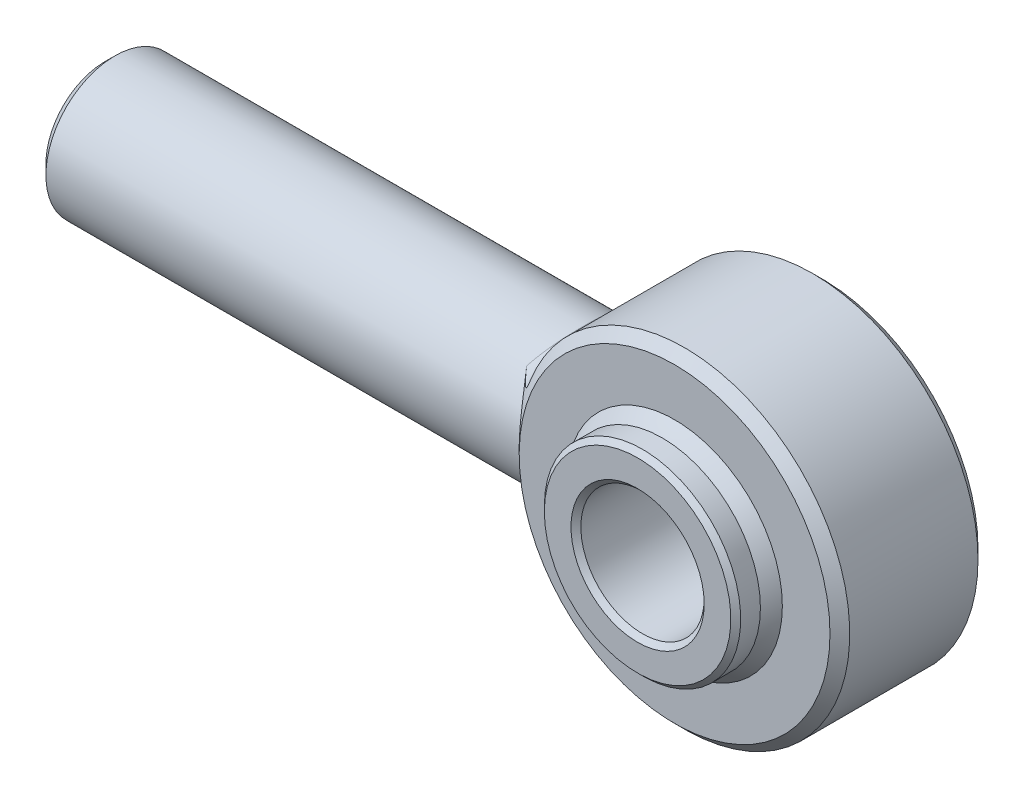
ISO-10303-21;
HEADER;
FILE_DESCRIPTION(('STEP AP214'),'2;1');
FILE_NAME('part.step','',(''),(''),'','','');
FILE_SCHEMA(('AUTOMOTIVE_DESIGN { 1 0 10303 214 1 1 1 1 }'));
ENDSEC;
DATA;
#1=APPLICATION_CONTEXT('core data for automotive mechanical design processes');
#2=APPLICATION_PROTOCOL_DEFINITION('international standard','automotive_design',2000,#1);
#3=PRODUCT_CONTEXT('',#1,'mechanical');
#4=PRODUCT('Part','Part','',(#3));
#5=PRODUCT_RELATED_PRODUCT_CATEGORY('part','',(#4));
#6=PRODUCT_DEFINITION_FORMATION('','',#4);
#7=PRODUCT_DEFINITION_CONTEXT('part definition',#1,'design');
#8=PRODUCT_DEFINITION('design','',#6,#7);
#9=PRODUCT_DEFINITION_SHAPE('','',#8);
#10=(LENGTH_UNIT() NAMED_UNIT(*) SI_UNIT(.MILLI.,.METRE.));
#11=(NAMED_UNIT(*) PLANE_ANGLE_UNIT() SI_UNIT($,.RADIAN.));
#12=(NAMED_UNIT(*) SI_UNIT($,.STERADIAN.) SOLID_ANGLE_UNIT());
#13=UNCERTAINTY_MEASURE_WITH_UNIT(LENGTH_MEASURE(1.E-05),#10,'distance_accuracy_value','');
#14=(GEOMETRIC_REPRESENTATION_CONTEXT(3) GLOBAL_UNCERTAINTY_ASSIGNED_CONTEXT((#13)) GLOBAL_UNIT_ASSIGNED_CONTEXT((#10,
#11,#12)) REPRESENTATION_CONTEXT('',''));
#15=CARTESIAN_POINT('',(0.,0.,0.));
#16=DIRECTION('',(0.,0.,1.));
#17=DIRECTION('',(1.,0.,0.));
#18=AXIS2_PLACEMENT_3D('',#15,#16,#17);
#19=CARTESIAN_POINT('',(0.,0.,0.));
#20=DIRECTION('',(-0.999999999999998,0.,0.));
#21=DIRECTION('',(0.,0.999999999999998,0.));
#22=AXIS2_PLACEMENT_3D('',#19,#20,#21);
#23=SPHERICAL_SURFACE('',#22,26.5);
#24=CARTESIAN_POINT('',(0.,0.,0.));
#25=DIRECTION('',(0.,0.,1.));
#26=DIRECTION('',(1.,0.,0.));
#27=AXIS2_PLACEMENT_3D('',#24,#25,#26);
#28=SPHERICAL_SURFACE('',#27,26.5);
#29=CARTESIAN_POINT('',(0.,0.,15.));
#30=DIRECTION('',(0.,0.,1.));
#31=DIRECTION('',(0.999999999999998,0.,0.));
#32=AXIS2_PLACEMENT_3D('',#29,#30,#31);
#33=CIRCLE('',#32,21.8460522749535);
#34=CARTESIAN_POINT('',(21.8460522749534,0.,15.));
#35=VERTEX_POINT('',#34);
#36=EDGE_CURVE('E110',#35,#35,#33,.T.);
#37=ORIENTED_EDGE('',*,*,#36,.T.);
#38=EDGE_LOOP('',(#37));
#39=FACE_BOUND('',#38,.T.);
#40=CARTESIAN_POINT('',(1.11022302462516E-13,0.,17.5));
#41=DIRECTION('',(0.,0.,1.));
#42=DIRECTION('',(0.,-0.999999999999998,0.));
#43=AXIS2_PLACEMENT_3D('',#40,#41,#42);
#44=CIRCLE('',#43,19.8997487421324);
#45=CARTESIAN_POINT('',(-19.8997487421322,0.,17.5));
#46=VERTEX_POINT('',#45);
#47=EDGE_CURVE('E123',#46,#46,#44,.T.);
#48=ORIENTED_EDGE('',*,*,#47,.F.);
#49=EDGE_LOOP('',(#48));
#50=FACE_BOUND('',#49,.T.);
#51=ADVANCED_FACE('F37',(#39,#50),#28,.T.);
#52=CARTESIAN_POINT('',(0.,0.,0.));
#53=DIRECTION('',(0.,0.,1.));
#54=DIRECTION('',(1.,0.,0.));
#55=AXIS2_PLACEMENT_3D('',#52,#53,#54);
#56=SPHERICAL_SURFACE('',#55,26.5);
#57=CARTESIAN_POINT('',(0.,0.,-14.9999999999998));
#58=DIRECTION('',(0.,0.,1.));
#59=DIRECTION('',(0.999999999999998,0.,0.));
#60=AXIS2_PLACEMENT_3D('',#57,#58,#59);
#61=CIRCLE('',#60,21.8460522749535);
#62=CARTESIAN_POINT('',(21.8460522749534,0.,-14.9999999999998));
#63=VERTEX_POINT('',#62);
#64=EDGE_CURVE('E105',#63,#63,#61,.T.);
#65=ORIENTED_EDGE('',*,*,#64,.F.);
#66=EDGE_LOOP('',(#65));
#67=FACE_BOUND('',#66,.T.);
#68=CARTESIAN_POINT('',(0.,0.,-17.4999999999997));
#69=DIRECTION('',(0.,0.,-1.));
#70=DIRECTION('',(0.,0.999999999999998,0.));
#71=AXIS2_PLACEMENT_3D('',#68,#69,#70);
#72=CIRCLE('',#71,19.8997487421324);
#73=CARTESIAN_POINT('',(0.,-19.8997487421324,-17.4999999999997));
#74=VERTEX_POINT('',#73);
#75=EDGE_CURVE('E120',#74,#74,#72,.T.);
#76=ORIENTED_EDGE('',*,*,#75,.F.);
#77=EDGE_LOOP('',(#76));
#78=FACE_BOUND('',#77,.T.);
#79=ADVANCED_FACE('F222',(#67,#78),#56,.T.);
#80=CARTESIAN_POINT('',(0.,0.,15.));
#81=DIRECTION('',(0.,0.,1.));
#82=DIRECTION('',(0.999999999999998,0.,0.));
#83=AXIS2_PLACEMENT_3D('',#80,#81,#82);
#84=PLANE('',#83);
#85=CARTESIAN_POINT('',(0.,0.,15.));
#86=DIRECTION('',(0.,0.,1.));
#87=DIRECTION('',(0.999999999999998,0.,0.));
#88=AXIS2_PLACEMENT_3D('',#85,#86,#87);
#89=CIRCLE('',#88,31.5);
#90=CARTESIAN_POINT('',(31.4999999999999,0.,15.));
#91=VERTEX_POINT('',#90);
#92=EDGE_CURVE('E116',#91,#91,#89,.T.);
#93=ORIENTED_EDGE('',*,*,#92,.T.);
#94=EDGE_LOOP('',(#93));
#95=FACE_BOUND('',#94,.T.);
#96=ORIENTED_EDGE('',*,*,#36,.F.);
#97=EDGE_LOOP('',(#96));
#98=FACE_BOUND('',#97,.T.);
#99=ADVANCED_FACE('F216',(#95,#98),#84,.T.);
#100=CARTESIAN_POINT('',(0.,0.,-14.9999999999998));
#101=DIRECTION('',(0.,0.,1.));
#102=DIRECTION('',(0.999999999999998,0.,0.));
#103=AXIS2_PLACEMENT_3D('',#100,#101,#102);
#104=PLANE('',#103);
#105=CARTESIAN_POINT('',(0.,0.,-14.9999999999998));
#106=DIRECTION('',(0.,0.,1.));
#107=DIRECTION('',(0.999999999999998,0.,0.));
#108=AXIS2_PLACEMENT_3D('',#105,#106,#107);
#109=CIRCLE('',#108,31.5);
#110=CARTESIAN_POINT('',(31.4999999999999,0.,-14.9999999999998));
#111=VERTEX_POINT('',#110);
#112=EDGE_CURVE('E107',#111,#111,#109,.F.);
#113=ORIENTED_EDGE('',*,*,#112,.T.);
#114=EDGE_LOOP('',(#113));
#115=FACE_BOUND('',#114,.T.);
#116=ORIENTED_EDGE('',*,*,#64,.T.);
#117=EDGE_LOOP('',(#116));
#118=FACE_BOUND('',#117,.T.);
#119=ADVANCED_FACE('F215',(#115,#118),#104,.F.);
#120=CARTESIAN_POINT('',(0.,0.,15.));
#121=DIRECTION('',(0.,0.,-1.));
#122=DIRECTION('',(-0.999999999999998,0.,0.));
#123=AXIS2_PLACEMENT_3D('',#120,#121,#122);
#124=CYLINDRICAL_SURFACE('',#123,33.5);
#125=CARTESIAN_POINT('',(0.,0.,13.));
#126=DIRECTION('',(0.,0.,1.));
#127=DIRECTION('',(0.999999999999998,0.,0.));
#128=AXIS2_PLACEMENT_3D('',#125,#126,#127);
#129=CIRCLE('',#128,33.5);
#130=CARTESIAN_POINT('',(-31.2551085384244,12.0568731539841,13.0000000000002));
#131=VERTEX_POINT('',#130);
#132=CARTESIAN_POINT('',(-31.2551085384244,-12.0568731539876,13.));
#133=VERTEX_POINT('',#132);
#134=EDGE_CURVE('E95',#131,#133,#129,.F.);
#135=ORIENTED_EDGE('',*,*,#134,.T.);
#136=CARTESIAN_POINT('',(-32.5930623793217,-7.74224029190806,16.7877687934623));
#137=CARTESIAN_POINT('',(-33.0681469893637,-5.74224264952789,12.8013844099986));
#138=CARTESIAN_POINT('',(-37.4576985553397,-6.55627261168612,12.3699349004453));
#139=CARTESIAN_POINT('',(-32.5024547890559,-8.12381135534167,16.5553615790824));
#140=CARTESIAN_POINT('',(-33.0187882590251,-6.05391088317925,12.6633076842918));
#141=CARTESIAN_POINT('',(-37.3535674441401,-6.87939406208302,12.1986874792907));
#142=CARTESIAN_POINT('',(-32.4068281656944,-8.49644877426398,16.3063560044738));
#143=CARTESIAN_POINT('',(-32.9645770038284,-6.36591198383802,12.5111307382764));
#144=CARTESIAN_POINT('',(-37.2436681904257,-7.19495033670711,12.0152096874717));
#145=CARTESIAN_POINT('',(-32.2078157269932,-9.22212326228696,15.7770155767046));
#146=CARTESIAN_POINT('',(-32.8477143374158,-6.98420032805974,12.1789189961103));
#147=CARTESIAN_POINT('',(-37.0149524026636,-7.80946494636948,11.6251693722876));
#148=CARTESIAN_POINT('',(-32.1044325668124,-9.57516696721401,15.4966914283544));
#149=CARTESIAN_POINT('',(-32.7851828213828,-7.29037692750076,11.9992652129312));
#150=CARTESIAN_POINT('',(-36.896138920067,-8.10842890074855,11.4186147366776));
#151=CARTESIAN_POINT('',(-31.891860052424,-10.2610255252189,14.9056946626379));
#152=CARTESIAN_POINT('',(-32.6524294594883,-7.89485547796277,11.6112066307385));
#153=CARTESIAN_POINT('',(-36.651839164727,-8.68922664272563,10.9831434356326));
#154=CARTESIAN_POINT('',(-31.7826570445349,-10.5937884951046,14.5949491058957));
#155=CARTESIAN_POINT('',(-32.5822835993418,-8.19315069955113,11.4030735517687));
#156=CARTESIAN_POINT('',(-36.5263372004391,-8.97101649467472,10.7541730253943));
#157=CARTESIAN_POINT('',(-31.5610598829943,-11.2367755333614,13.9453600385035));
#158=CARTESIAN_POINT('',(-32.4359664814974,-8.7777417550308,10.9586103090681));
#159=CARTESIAN_POINT('',(-36.2716658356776,-9.51550983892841,10.2755284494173));
#160=CARTESIAN_POINT('',(-31.4486653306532,-11.546996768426,13.6065130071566));
#161=CARTESIAN_POINT('',(-32.3598582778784,-9.06415354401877,10.7225725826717));
#162=CARTESIAN_POINT('',(-36.1424959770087,-9.77821093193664,10.025851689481));
#163=CARTESIAN_POINT('',(-31.2122620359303,-12.1723862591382,12.8683247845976));
#164=CARTESIAN_POINT('',(-32.1960446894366,-9.64834427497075,10.1990160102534));
#165=CARTESIAN_POINT('',(-35.87080860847,-10.3078023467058,9.48192352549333));
#166=CARTESIAN_POINT('',(-31.0881805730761,-12.485135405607,12.4663020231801));
#167=CARTESIAN_POINT('',(-32.1078735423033,-9.94512640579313,9.90873100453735));
#168=CARTESIAN_POINT('',(-35.72820752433,-10.5726441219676,9.18569622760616));
#169=CARTESIAN_POINT('',(-30.8425456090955,-13.0801761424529,11.6325588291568));
#170=CARTESIAN_POINT('',(-31.9295767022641,-10.5160114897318,9.29632680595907));
#171=CARTESIAN_POINT('',(-35.4459106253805,-11.076535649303,8.57135913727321));
#172=CARTESIAN_POINT('',(-30.7209921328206,-13.3624674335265,11.2008381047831));
#173=CARTESIAN_POINT('',(-31.8394259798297,-10.7904980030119,8.97438504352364));
#174=CARTESIAN_POINT('',(-35.3062148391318,-11.3155851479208,8.2532491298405));
#175=CARTESIAN_POINT('',(-30.4841310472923,-13.8943279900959,10.3106940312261));
#176=CARTESIAN_POINT('',(-31.6607279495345,-11.3122165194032,8.30118247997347));
#177=CARTESIAN_POINT('',(-35.034001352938,-11.7659745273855,7.5973534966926));
#178=CARTESIAN_POINT('',(-30.3688117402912,-14.1439598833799,9.85232429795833));
#179=CARTESIAN_POINT('',(-31.5720988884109,-11.5599493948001,7.95002439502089));
#180=CARTESIAN_POINT('',(-34.9014702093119,-11.9773674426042,7.25960737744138));
#181=CARTESIAN_POINT('',(-30.1477618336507,-14.60920207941,8.91065018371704));
#182=CARTESIAN_POINT('',(-31.399929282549,-12.0247843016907,7.22042240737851));
#183=CARTESIAN_POINT('',(-34.6474277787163,-12.3713431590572,6.56574224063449));
#184=CARTESIAN_POINT('',(-30.0420273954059,-14.8248260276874,8.42735590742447));
#185=CARTESIAN_POINT('',(-31.3162599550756,-12.2423880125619,6.84187804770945));
#186=CARTESIAN_POINT('',(-34.5259120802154,-12.5539375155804,6.20963066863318));
#187=CARTESIAN_POINT('',(-29.8317321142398,-15.2439890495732,7.3789363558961));
#188=CARTESIAN_POINT('',(-31.1482512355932,-12.6672921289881,6.01380344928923));
#189=CARTESIAN_POINT('',(-34.2842294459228,-12.9088925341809,5.43711099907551));
#190=CARTESIAN_POINT('',(-29.7288335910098,-15.4429755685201,6.81094939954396));
#191=CARTESIAN_POINT('',(-31.0647396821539,-12.8710933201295,5.56042431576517));
#192=CARTESIAN_POINT('',(-34.1659729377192,-13.0773980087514,5.0185942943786));
#193=CARTESIAN_POINT('',(-29.5442330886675,-15.7932784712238,5.65124160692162));
#194=CARTESIAN_POINT('',(-30.9138384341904,-13.231003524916,4.62819360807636));
#195=CARTESIAN_POINT('',(-33.9538201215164,-13.3740410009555,4.16407276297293));
#196=CARTESIAN_POINT('',(-29.4625344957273,-15.9445872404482,5.05951699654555));
#197=CARTESIAN_POINT('',(-30.8462129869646,-13.3877363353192,4.14871815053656));
#198=CARTESIAN_POINT('',(-33.8599277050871,-13.5021720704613,3.72806515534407));
#199=CARTESIAN_POINT('',(-29.3410205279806,-16.1668305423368,4.00161340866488));
#200=CARTESIAN_POINT('',(-30.7451871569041,-13.6183783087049,3.2872090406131));
#201=CARTESIAN_POINT('',(-33.720277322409,-13.6903718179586,2.94855724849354));
#202=CARTESIAN_POINT('',(-29.2958634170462,-16.2483269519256,3.53913906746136));
#203=CARTESIAN_POINT('',(-30.7074072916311,-13.7032824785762,2.90916246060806));
#204=CARTESIAN_POINT('',(-33.6683803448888,-13.7593844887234,2.60778668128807));
#205=CARTESIAN_POINT('',(-29.2217204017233,-16.3812973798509,2.60668766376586));
#206=CARTESIAN_POINT('',(-30.6452791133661,-13.8418663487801,2.14533007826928));
#207=CARTESIAN_POINT('',(-33.5831712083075,-13.8719863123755,1.92071722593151));
#208=CARTESIAN_POINT('',(-29.1927375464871,-16.4327657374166,2.13670920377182));
#209=CARTESIAN_POINT('',(-30.6208614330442,-13.8957038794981,1.7591152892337));
#210=CARTESIAN_POINT('',(-33.5498625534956,-13.9155706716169,1.57441730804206));
#211=CARTESIAN_POINT('',(-29.1519399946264,-16.5050332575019,1.19242481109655));
#212=CARTESIAN_POINT('',(-30.5864948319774,-13.9712518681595,0.982489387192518));
#213=CARTESIAN_POINT('',(-33.5029758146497,-13.9767681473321,0.878628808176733));
#214=CARTESIAN_POINT('',(-29.140134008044,-16.525816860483,0.718116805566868));
#215=CARTESIAN_POINT('',(-30.5765114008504,-13.9930384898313,0.591608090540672));
#216=CARTESIAN_POINT('',(-33.4894077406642,-13.9943680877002,0.529138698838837));
#217=CARTESIAN_POINT('',(-29.134128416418,-16.5364023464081,-0.231082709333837));
#218=CARTESIAN_POINT('',(-30.57144189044,-14.0041177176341,-0.190312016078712));
#219=CARTESIAN_POINT('',(-33.4825057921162,-14.0033320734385,-0.170271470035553));
#220=CARTESIAN_POINT('',(-29.1399279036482,-16.526205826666,-0.705974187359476));
#221=CARTESIAN_POINT('',(-30.5763487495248,-13.9934257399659,-0.581835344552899));
#222=CARTESIAN_POINT('',(-33.4891708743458,-13.9946974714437,-0.520191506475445));
#223=CARTESIAN_POINT('',(-29.1689163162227,-16.4749863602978,-1.65244601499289));
#224=CARTESIAN_POINT('',(-30.6007937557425,-13.9398485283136,-1.36089689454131));
#225=CARTESIAN_POINT('',(-33.522485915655,-13.9513238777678,-1.21759180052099));
#226=CARTESIAN_POINT('',(-29.1920908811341,-16.4339888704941,-2.12402877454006));
#227=CARTESIAN_POINT('',(-30.6203498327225,-13.8969239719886,-1.74891378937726));
#228=CARTESIAN_POINT('',(-33.5491193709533,-13.9166064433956,-1.56507383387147));
#229=CARTESIAN_POINT('',(-29.2550167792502,-16.3217069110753,-3.06091763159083));
#230=CARTESIAN_POINT('',(-30.6731928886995,-13.7797548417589,-2.51764264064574));
#231=CARTESIAN_POINT('',(-33.6214371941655,-13.8215239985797,-2.25541299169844));
#232=CARTESIAN_POINT('',(-29.2947684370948,-16.2504218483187,-3.52622360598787));
#233=CARTESIAN_POINT('',(-30.7065425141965,-13.7053693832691,-2.89879751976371));
#234=CARTESIAN_POINT('',(-33.6671219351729,-13.7611584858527,-2.59827002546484));
#235=CARTESIAN_POINT('',(-29.3895380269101,-16.0783915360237,-4.44745713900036));
#236=CARTESIAN_POINT('',(-30.7855432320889,-13.5266120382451,-3.65044894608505));
#237=CARTESIAN_POINT('',(-33.7760362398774,-13.6154800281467,-3.2770736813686));
#238=CARTESIAN_POINT('',(-29.444555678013,-15.97764682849,-4.90338486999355));
#239=CARTESIAN_POINT('',(-30.8312811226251,-13.4220364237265,-4.02133643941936));
#240=CARTESIAN_POINT('',(-33.8392654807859,-13.5301675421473,-3.61302043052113));
#241=CARTESIAN_POINT('',(-29.5681749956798,-15.7476997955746,-5.80333777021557));
#242=CARTESIAN_POINT('',(-30.9332378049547,-13.1845647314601,-4.74967526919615));
#243=CARTESIAN_POINT('',(-33.9813354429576,-13.3354441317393,-4.27614362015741));
#244=CARTESIAN_POINT('',(-29.6367821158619,-15.6184860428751,-6.24735807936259));
#245=CARTESIAN_POINT('',(-30.9895622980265,-13.0514030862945,-5.10744401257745));
#246=CARTESIAN_POINT('',(-34.0601824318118,-13.226023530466,-4.60331647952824));
#247=CARTESIAN_POINT('',(-29.7869820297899,-15.3301207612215,-7.1291716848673));
#248=CARTESIAN_POINT('',(-31.1117073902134,-12.7560108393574,-5.81348188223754));
#249=CARTESIAN_POINT('',(-34.2328002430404,-12.9818304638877,-5.25307387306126));
#250=CARTESIAN_POINT('',(-29.8687939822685,-15.1704538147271,-7.56669256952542));
#251=CARTESIAN_POINT('',(-31.1777897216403,-12.5929959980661,-6.16166810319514));
#252=CARTESIAN_POINT('',(-34.3268229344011,-12.8466215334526,-5.57545768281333));
#253=CARTESIAN_POINT('',(-30.042216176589,-14.8240600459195,-8.42483629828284));
#254=CARTESIAN_POINT('',(-31.3162662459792,-12.2418963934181,-6.83925104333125));
#255=CARTESIAN_POINT('',(-34.5261290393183,-12.5532888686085,-6.20777411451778));
#256=CARTESIAN_POINT('',(-30.133829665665,-14.6373242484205,-8.84545347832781));
#257=CARTESIAN_POINT('',(-31.3887658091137,-12.053480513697,-7.16881294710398));
#258=CARTESIAN_POINT('',(-34.6314161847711,-12.3951575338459,-6.51770256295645));
#259=CARTESIAN_POINT('',(-30.324537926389,-14.2380248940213,-9.668026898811));
#260=CARTESIAN_POINT('',(-31.5376767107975,-11.6539532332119,-7.8073523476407));
#261=CARTESIAN_POINT('',(-34.8505883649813,-12.0570234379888,-7.12380929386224));
#262=CARTESIAN_POINT('',(-30.4236354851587,-14.025451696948,-10.0699760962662));
#263=CARTESIAN_POINT('',(-31.6141751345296,-11.442510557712,-8.11640433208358));
#264=CARTESIAN_POINT('',(-34.9644766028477,-11.8770125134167,-7.41998238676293));
#265=CARTESIAN_POINT('',(-30.6269485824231,-13.5757472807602,-10.8535049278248));
#266=CARTESIAN_POINT('',(-31.768718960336,-10.9994728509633,-8.71235163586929));
#267=CARTESIAN_POINT('',(-35.1981349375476,-11.4961944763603,-7.99731942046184));
#268=CARTESIAN_POINT('',(-30.731164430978,-13.3386145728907,-11.2350833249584));
#269=CARTESIAN_POINT('',(-31.8468247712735,-10.767571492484,-8.99924166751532));
#270=CARTESIAN_POINT('',(-35.3179053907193,-11.2953861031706,-8.27848244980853));
#271=CARTESIAN_POINT('',(-30.955503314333,-12.8101164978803,-12.0223691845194));
#272=CARTESIAN_POINT('',(-32.0121032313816,-10.2560618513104,-9.58412936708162));
#273=CARTESIAN_POINT('',(-35.5757276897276,-10.8478441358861,-8.85858782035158));
#274=CARTESIAN_POINT('',(-31.0759979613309,-12.5156717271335,-12.4252124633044));
#275=CARTESIAN_POINT('',(-32.099137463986,-9.97405862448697,-9.87862253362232));
#276=CARTESIAN_POINT('',(-35.7142066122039,-10.5985028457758,-9.15541971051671));
#277=CARTESIAN_POINT('',(-31.317334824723,-11.8989145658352,-13.2012879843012));
#278=CARTESIAN_POINT('',(-32.2695116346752,-9.39166930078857,-10.4368618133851));
#279=CARTESIAN_POINT('',(-35.9915639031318,-10.076221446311,-9.72726482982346));
#280=CARTESIAN_POINT('',(-31.4381769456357,-11.5766092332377,-13.5745276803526));
#281=CARTESIAN_POINT('',(-32.3528416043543,-9.0909894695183,-10.7003781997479));
#282=CARTESIAN_POINT('',(-36.1304421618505,-9.80328731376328,-10.0022835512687));
#283=CARTESIAN_POINT('',(-31.6771283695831,-10.9057891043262,-14.2894056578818));
#284=CARTESIAN_POINT('',(-32.5133902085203,-8.47508073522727,-11.195904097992));
#285=CARTESIAN_POINT('',(-36.4050579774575,-9.23522439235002,-10.5290357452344));
#286=CARTESIAN_POINT('',(-31.7952388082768,-10.5572854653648,-14.6310572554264));
#287=CARTESIAN_POINT('',(-32.5905489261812,-8.15967220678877,-11.4275924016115));
#288=CARTESIAN_POINT('',(-36.5407968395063,-8.94010505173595,-10.7807790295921));
#289=CARTESIAN_POINT('',(-32.0258335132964,-9.8356232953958,-15.2808891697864));
#290=CARTESIAN_POINT('',(-32.7368747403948,-7.51797405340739,-11.8593232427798));
#291=CARTESIAN_POINT('',(-36.8058086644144,-8.32898814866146,-11.2596025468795));
#292=CARTESIAN_POINT('',(-32.1383175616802,-9.46246381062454,-15.5890681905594));
#293=CARTESIAN_POINT('',(-32.8059336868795,-7.19163735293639,-12.058955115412));
#294=CARTESIAN_POINT('',(-36.9350813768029,-8.01298977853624,-11.4866818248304));
#295=CARTESIAN_POINT('',(-32.3595772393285,-8.67649609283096,-16.1825176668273));
#296=CARTESIAN_POINT('',(-32.9375428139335,-6.51716459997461,-12.4349803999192));
#297=CARTESIAN_POINT('',(-37.1893648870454,-7.34741774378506,-11.9239603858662));
#298=CARTESIAN_POINT('',(-32.4679748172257,-8.26266721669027,-16.4661941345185));
#299=CARTESIAN_POINT('',(-32.999486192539,-6.16898911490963,-12.6093750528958));
#300=CARTESIAN_POINT('',(-37.3139412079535,-6.99697977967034,-12.1329851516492));
#301=CARTESIAN_POINT('',(-32.6725061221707,-7.41271931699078,-16.99213670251));
#302=CARTESIAN_POINT('',(-33.1123144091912,-5.46873844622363,-12.9249305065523));
#303=CARTESIAN_POINT('',(-37.5489995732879,-6.27722814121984,-12.5205217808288));
#304=CARTESIAN_POINT('',(-32.7686414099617,-6.97660314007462,-17.2344080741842));
#305=CARTESIAN_POINT('',(-33.1630218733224,-5.11697983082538,-13.0655703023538));
#306=CARTESIAN_POINT('',(-37.6594834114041,-5.90791687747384,-12.6990375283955));
#307=CARTESIAN_POINT('',(-32.946235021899,-6.08306826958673,-17.6759577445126));
#308=CARTESIAN_POINT('',(-33.2534293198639,-4.41121512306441,-13.3158038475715));
#309=CARTESIAN_POINT('',(-37.8635835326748,-5.15125498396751,-13.0243899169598));
#310=CARTESIAN_POINT('',(-33.02763383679,-5.62557219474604,-17.8750623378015));
#311=CARTESIAN_POINT('',(-33.292906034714,-4.05772518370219,-13.4247715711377));
#312=CARTESIAN_POINT('',(-37.9571314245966,-4.76383882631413,-13.1710985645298));
#313=CARTESIAN_POINT('',(-33.1365063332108,-4.92723336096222,-18.138742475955));
#314=CARTESIAN_POINT('',(-33.3438936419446,-3.52957412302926,-13.5656819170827));
#315=CARTESIAN_POINT('',(-38.0822535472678,-4.17247255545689,-13.3653891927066));
#316=CARTESIAN_POINT('',(-33.1706060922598,-4.69232206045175,-18.2208374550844));
#317=CARTESIAN_POINT('',(-33.3595471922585,-3.35336681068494,-13.6089755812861));
#318=CARTESIAN_POINT('',(-38.1214428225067,-3.97354531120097,-13.4258802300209));
#319=CARTESIAN_POINT('',(-33.2341327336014,-4.21894392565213,-18.3730917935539));
#320=CARTESIAN_POINT('',(-33.3882217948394,-3.00146188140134,-13.6883656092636));
#321=CARTESIAN_POINT('',(-38.1944510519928,-3.57267993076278,-13.5380676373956));
#322=CARTESIAN_POINT('',(-33.2635591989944,-3.98047677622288,-18.4432500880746));
#323=CARTESIAN_POINT('',(-33.4012255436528,-2.82585643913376,-13.7244144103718));
#324=CARTESIAN_POINT('',(-38.2282695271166,-3.37074152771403,-13.5897632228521));
#325=CARTESIAN_POINT('',(-33.2905238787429,-3.7404571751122,-18.5073197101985));
#326=CARTESIAN_POINT('',(-33.4129510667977,-2.65084030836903,-13.7569753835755));
#327=CARTESIAN_POINT('',(-38.2592587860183,-3.16748847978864,-13.6369724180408));
#328=(BOUNDED_SURFACE() B_SPLINE_SURFACE(3,2,((#136,#137,#138),(#139,#140,#141),(#142,#143,
#144),(#145,#146,#147),(#148,#149,#150),(#151,#152,#153),(#154,#155,#156),(#157,#158,#159),
(#160,#161,#162),(#163,#164,#165),(#166,#167,#168),(#169,#170,#171),(#172,#173,#174),(#175,#176,
#177),(#178,#179,#180),(#181,#182,#183),(#184,#185,#186),(#187,#188,#189),(#190,#191,#192),
(#193,#194,#195),(#196,#197,#198),(#199,#200,#201),(#202,#203,#204),(#205,#206,#207),(#208,#209,
#210),(#211,#212,#213),(#214,#215,#216),(#217,#218,#219),(#220,#221,#222),(#223,#224,#225),
(#226,#227,#228),(#229,#230,#231),(#232,#233,#234),(#235,#236,#237),(#238,#239,#240),(#241,#242,
#243),(#244,#245,#246),(#247,#248,#249),(#250,#251,#252),(#253,#254,#255),(#256,#257,#258),
(#259,#260,#261),(#262,#263,#264),(#265,#266,#267),(#268,#269,#270),(#271,#272,#273),(#274,#275,
#276),(#277,#278,#279),(#280,#281,#282),(#283,#284,#285),(#286,#287,#288),(#289,#290,#291),
(#292,#293,#294),(#295,#296,#297),(#298,#299,#300),(#301,#302,#303),(#304,#305,#306),(#307,#308,
#309),(#310,#311,#312),(#313,#314,#315),(#316,#317,#318),(#319,#320,#321),(#322,#323,#324),
(#325,#326,#327)),.UNSPECIFIED.,.F.,.F.,.F.) B_SPLINE_SURFACE_WITH_KNOTS((4,2,2,2,2,2,2,2,2,2,2,
2,2,2,2,2,2,2,2,2,2,2,2,2,2,2,2,2,2,2,2,4),(3,3),(0.,1.52079058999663,3.04106294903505,
4.56507405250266,6.08927638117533,7.76077605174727,9.4322921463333,11.1005544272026,
12.7681456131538,14.6357794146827,16.5037113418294,17.9262769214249,19.349110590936,
20.7726654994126,22.1961470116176,23.6184533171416,25.0407874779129,26.463095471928,
27.885975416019,29.3355066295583,30.7855195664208,32.2360751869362,33.6867187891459,
35.3170164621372,36.9469023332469,38.5760979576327,40.2053566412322,41.905956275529,
43.6063392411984,45.3134426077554,46.1678165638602,47.0222666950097),(0.,1.),
.UNSPECIFIED.) GEOMETRIC_REPRESENTATION_ITEM() RATIONAL_B_SPLINE_SURFACE(((1.,0.744389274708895,
1.),(1.,0.747972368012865,1.),(1.,0.751710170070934,1.),(1.,0.759391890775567,1.),(1.,
0.763335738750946,1.),(1.,0.771338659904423,1.),(1.,0.775397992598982,1.),(1.,0.783526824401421,
1.),(1.,0.78759632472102,1.),(1.,0.796044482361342,1.),(1.,0.800415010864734,1.),(1.,
0.808948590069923,1.),(1.,0.813111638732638,1.),(1.,0.821120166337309,1.),(1.,0.824966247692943,
1.),(1.,0.83225366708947,1.),(1.,0.835695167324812,1.),(1.,0.842471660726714,1.),(1.,
0.84574435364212,1.),(1.,0.851564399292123,1.),(1.,0.854111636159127,1.),(1.,0.857877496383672,
1.),(1.,0.859268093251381,1.),(1.,0.861544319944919,1.),(1.,0.862429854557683,1.),(1.,
0.863674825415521,1.),(1.,0.8640339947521,1.),(1.,0.864216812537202,1.),(1.,0.864040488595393,
1.),(1.,0.863156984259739,1.),(1.,0.862450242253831,1.),(1.,0.860523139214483,1.),(1.,
0.859302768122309,1.),(1.,0.856376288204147,1.),(1.,0.854670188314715,1.),(1.,0.850808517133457,
1.),(1.,0.848652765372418,1.),(1.,0.84389220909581,1.),(1.,0.841279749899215,1.),(1.,
0.835686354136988,1.),(1.,0.832705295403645,1.),(1.,0.826431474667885,1.),(1.,0.823138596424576,
1.),(1.,0.8163034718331,1.),(1.,0.812761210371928,1.),(1.,0.805042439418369,1.),(1.,
0.800841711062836,1.),(1.,0.792308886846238,1.),(1.,0.787976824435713,1.),(1.,0.779289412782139,
1.),(1.,0.774934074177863,1.),(1.,0.766313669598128,1.),(1.,0.762048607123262,1.),(1.,
0.753549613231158,1.),(1.,0.749325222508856,1.),(1.,0.741255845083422,1.),(1.,0.737410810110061,
1.),(1.,0.730232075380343,1.),(1.,0.726900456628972,1.),(1.,0.722406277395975,1.),(1.,
0.720991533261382,1.),(1.,0.718345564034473,1.),(1.,0.71711435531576,1.),(1.,0.715982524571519,1.))) REPRESENTATION_ITEM('') SURFACE());
#329=CARTESIAN_POINT('',(-32.5930623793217,-7.74224029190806,16.7877687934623));
#330=CARTESIAN_POINT('',(-32.5024547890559,-8.12381135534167,16.5553615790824));
#331=CARTESIAN_POINT('',(-32.4068281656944,-8.49644877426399,16.3063560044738));
#332=CARTESIAN_POINT('',(-32.2078157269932,-9.22212326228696,15.7770155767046));
#333=CARTESIAN_POINT('',(-32.1044325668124,-9.57516696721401,15.4966914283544));
#334=CARTESIAN_POINT('',(-31.891860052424,-10.2610255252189,14.9056946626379));
#335=CARTESIAN_POINT('',(-31.7826570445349,-10.5937884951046,14.5949491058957));
#336=CARTESIAN_POINT('',(-31.5610598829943,-11.2367755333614,13.9453600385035));
#337=CARTESIAN_POINT('',(-31.4486653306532,-11.546996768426,13.6065130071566));
#338=CARTESIAN_POINT('',(-31.2122620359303,-12.1723862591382,12.8683247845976));
#339=CARTESIAN_POINT('',(-31.0881805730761,-12.485135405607,12.4663020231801));
#340=CARTESIAN_POINT('',(-30.8425456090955,-13.0801761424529,11.6325588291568));
#341=CARTESIAN_POINT('',(-30.7209921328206,-13.3624674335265,11.2008381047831));
#342=CARTESIAN_POINT('',(-30.4841310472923,-13.8943279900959,10.3106940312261));
#343=CARTESIAN_POINT('',(-30.3688117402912,-14.1439598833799,9.85232429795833));
#344=CARTESIAN_POINT('',(-30.1477618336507,-14.60920207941,8.91065018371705));
#345=CARTESIAN_POINT('',(-30.0420273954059,-14.8248260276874,8.42735590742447));
#346=CARTESIAN_POINT('',(-29.8317321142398,-15.2439890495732,7.3789363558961));
#347=CARTESIAN_POINT('',(-29.7288335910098,-15.4429755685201,6.81094939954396));
#348=CARTESIAN_POINT('',(-29.5442330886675,-15.7932784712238,5.65124160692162));
#349=CARTESIAN_POINT('',(-29.4625344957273,-15.9445872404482,5.05951699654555));
#350=CARTESIAN_POINT('',(-29.3410205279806,-16.1668305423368,4.00161340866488));
#351=CARTESIAN_POINT('',(-29.2958634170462,-16.2483269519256,3.53913906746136));
#352=CARTESIAN_POINT('',(-29.2217204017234,-16.3812973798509,2.60668766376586));
#353=CARTESIAN_POINT('',(-29.1927375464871,-16.4327657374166,2.13670920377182));
#354=CARTESIAN_POINT('',(-29.1519399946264,-16.5050332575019,1.19242481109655));
#355=CARTESIAN_POINT('',(-29.140134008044,-16.525816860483,0.718116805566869));
#356=CARTESIAN_POINT('',(-29.134128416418,-16.5364023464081,-0.231082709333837));
#357=CARTESIAN_POINT('',(-29.1399279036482,-16.526205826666,-0.705974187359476));
#358=CARTESIAN_POINT('',(-29.1689163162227,-16.4749863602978,-1.65244601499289));
#359=CARTESIAN_POINT('',(-29.1920908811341,-16.4339888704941,-2.12402877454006));
#360=CARTESIAN_POINT('',(-29.2550167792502,-16.3217069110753,-3.06091763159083));
#361=CARTESIAN_POINT('',(-29.2947684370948,-16.2504218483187,-3.52622360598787));
#362=CARTESIAN_POINT('',(-29.3895380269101,-16.0783915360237,-4.44745713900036));
#363=CARTESIAN_POINT('',(-29.444555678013,-15.97764682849,-4.90338486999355));
#364=CARTESIAN_POINT('',(-29.5681749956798,-15.7476997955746,-5.80333777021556));
#365=CARTESIAN_POINT('',(-29.6367821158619,-15.6184860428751,-6.24735807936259));
#366=CARTESIAN_POINT('',(-29.7869820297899,-15.3301207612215,-7.1291716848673));
#367=CARTESIAN_POINT('',(-29.8687939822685,-15.1704538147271,-7.56669256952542));
#368=CARTESIAN_POINT('',(-30.042216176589,-14.8240600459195,-8.42483629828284));
#369=CARTESIAN_POINT('',(-30.133829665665,-14.6373242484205,-8.84545347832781));
#370=CARTESIAN_POINT('',(-30.324537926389,-14.2380248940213,-9.668026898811));
#371=CARTESIAN_POINT('',(-30.4236354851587,-14.025451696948,-10.0699760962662));
#372=CARTESIAN_POINT('',(-30.6269485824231,-13.5757472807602,-10.8535049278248));
#373=CARTESIAN_POINT('',(-30.731164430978,-13.3386145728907,-11.2350833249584));
#374=CARTESIAN_POINT('',(-30.955503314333,-12.8101164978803,-12.0223691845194));
#375=CARTESIAN_POINT('',(-31.0759979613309,-12.5156717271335,-12.4252124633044));
#376=CARTESIAN_POINT('',(-31.317334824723,-11.8989145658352,-13.2012879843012));
#377=CARTESIAN_POINT('',(-31.4381769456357,-11.5766092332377,-13.5745276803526));
#378=CARTESIAN_POINT('',(-31.6771283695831,-10.9057891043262,-14.2894056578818));
#379=CARTESIAN_POINT('',(-31.7952388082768,-10.5572854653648,-14.6310572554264));
#380=CARTESIAN_POINT('',(-32.0258335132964,-9.8356232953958,-15.2808891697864));
#381=CARTESIAN_POINT('',(-32.1383175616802,-9.46246381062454,-15.5890681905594));
#382=CARTESIAN_POINT('',(-32.3595772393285,-8.67649609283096,-16.1825176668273));
#383=CARTESIAN_POINT('',(-32.4679748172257,-8.26266721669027,-16.4661941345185));
#384=CARTESIAN_POINT('',(-32.6725061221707,-7.41271931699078,-16.99213670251));
#385=CARTESIAN_POINT('',(-32.7686414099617,-6.97660314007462,-17.2344080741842));
#386=CARTESIAN_POINT('',(-32.946235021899,-6.08306826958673,-17.6759577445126));
#387=CARTESIAN_POINT('',(-33.02763383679,-5.62557219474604,-17.8750623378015));
#388=CARTESIAN_POINT('',(-33.1365063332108,-4.92723336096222,-18.138742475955));
#389=CARTESIAN_POINT('',(-33.1706060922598,-4.69232206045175,-18.2208374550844));
#390=CARTESIAN_POINT('',(-33.2341327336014,-4.21894392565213,-18.3730917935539));
#391=CARTESIAN_POINT('',(-33.2635591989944,-3.98047677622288,-18.4432500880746));
#392=CARTESIAN_POINT('',(-33.2905238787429,-3.7404571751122,-18.5073197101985));
#393=B_SPLINE_CURVE_WITH_KNOTS('',3,(#329,#330,#331,#332,#333,#334,#335,#336,#337,#338,#339,
#340,#341,#342,#343,#344,#345,#346,#347,#348,#349,#350,#351,#352,#353,#354,#355,#356,#357,#358,
#359,#360,#361,#362,#363,#364,#365,#366,#367,#368,#369,#370,#371,#372,#373,#374,#375,#376,#377,
#378,#379,#380,#381,#382,#383,#384,#385,#386,#387,#388,#389,#390,#391,#392),.UNSPECIFIED.,.F.,
.F.,(4,2,2,2,2,2,2,2,2,2,2,2,2,2,2,2,2,2,2,2,2,2,2,2,2,2,2,2,2,2,2,4),(0.,1.52079058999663,
3.04106294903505,4.56507405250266,6.08927638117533,7.76077605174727,9.4322921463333,
11.1005544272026,12.7681456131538,14.6357794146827,16.5037113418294,17.9262769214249,
19.349110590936,20.7726654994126,22.1961470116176,23.6184533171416,25.0407874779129,
26.463095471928,27.885975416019,29.3355066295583,30.7855195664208,32.2360751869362,
33.6867187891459,35.3170164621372,36.9469023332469,38.5760979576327,40.2053566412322,
41.905956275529,43.6063392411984,45.3134426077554,46.1678165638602,47.0222666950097),.UNSPECIFIED.);
#394=CARTESIAN_POINT('',(-31.2551085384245,-12.0568731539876,-13.));
#395=VERTEX_POINT('',#394);
#396=EDGE_CURVE('E99',#133,#395,#393,.T.);
#397=ORIENTED_EDGE('',*,*,#396,.T.);
#398=CARTESIAN_POINT('',(0.,0.,-12.9999999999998));
#399=DIRECTION('',(0.,0.,1.));
#400=DIRECTION('',(0.999999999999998,0.,0.));
#401=AXIS2_PLACEMENT_3D('',#398,#399,#400);
#402=CIRCLE('',#401,33.5);
#403=CARTESIAN_POINT('',(-31.2551085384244,12.0568731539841,-12.9999999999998));
#404=VERTEX_POINT('',#403);
#405=EDGE_CURVE('E98',#395,#404,#402,.T.);
#406=ORIENTED_EDGE('',*,*,#405,.T.);
#407=CARTESIAN_POINT('',(-33.0844756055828,5.25998801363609,-18.0126966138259));
#408=CARTESIAN_POINT('',(-33.3194201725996,3.78222460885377,-13.4980468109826));
#409=CARTESIAN_POINT('',(-38.0224570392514,4.45425536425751,-13.2725132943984));
#410=CARTESIAN_POINT('',(-33.0211941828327,5.65827343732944,-17.8591154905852));
#411=CARTESIAN_POINT('',(-33.2896962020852,4.08359073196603,-13.4157896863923));
#412=CARTESIAN_POINT('',(-37.9497306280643,4.79153084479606,-13.1593482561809));
#413=CARTESIAN_POINT('',(-32.9514324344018,6.05043506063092,-17.6884194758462));
#414=CARTESIAN_POINT('',(-33.2557691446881,4.38686740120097,-13.3222049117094));
#415=CARTESIAN_POINT('',(-37.8695566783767,5.1236205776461,-13.033572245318));
#416=CARTESIAN_POINT('',(-32.8006960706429,6.8203690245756,-17.3144671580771));
#417=CARTESIAN_POINT('',(-33.1794643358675,4.99330691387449,-13.1111454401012));
#418=CARTESIAN_POINT('',(-37.6963223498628,5.7756149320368,-12.7580284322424));
#419=CARTESIAN_POINT('',(-32.7197270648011,7.19814844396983,-17.1112271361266));
#420=CARTESIAN_POINT('',(-33.1372016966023,5.29614316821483,-12.9939936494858));
#421=CARTESIAN_POINT('',(-37.6032684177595,6.09552554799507,-12.6082726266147));
#422=CARTESIAN_POINT('',(-32.5484735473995,7.93664554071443,-16.6742513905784));
#423=CARTESIAN_POINT('',(-33.0442862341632,5.89921004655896,-12.7349076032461));
#424=CARTESIAN_POINT('',(-37.406454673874,6.72089858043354,-12.2862904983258));
#425=CARTESIAN_POINT('',(-32.4582130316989,8.29740382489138,-16.4405938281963));
#426=CARTESIAN_POINT('',(-32.9937700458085,6.19921187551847,-12.5933703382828));
#427=CARTESIAN_POINT('',(-37.3027224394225,7.02639538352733,-12.1141217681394));
#428=CARTESIAN_POINT('',(-32.2701186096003,9.00124013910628,-15.9440396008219));
#429=CARTESIAN_POINT('',(-32.8847665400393,6.79466928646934,-12.2846580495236));
#430=CARTESIAN_POINT('',(-37.0865542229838,7.62241702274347,-11.7482397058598));
#431=CARTESIAN_POINT('',(-32.1722834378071,9.34431519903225,-15.6811380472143));
#432=CARTESIAN_POINT('',(-32.8263840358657,7.09000557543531,-12.1178087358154));
#433=CARTESIAN_POINT('',(-36.9741167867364,7.91293934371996,-11.5545227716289));
#434=CARTESIAN_POINT('',(-31.8526565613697,10.40342326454,-14.8022576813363));
#435=CARTESIAN_POINT('',(-32.6305384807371,8.01118009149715,-11.5497062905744));
#436=CARTESIAN_POINT('',(-36.6067844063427,8.80981168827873,-10.9069267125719));
#437=CARTESIAN_POINT('',(-31.6202268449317,11.0842805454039,-14.1342247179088));
#438=CARTESIAN_POINT('',(-32.4789184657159,8.62938949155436,-11.098419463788));
#439=CARTESIAN_POINT('',(-36.3396636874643,9.38637425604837,-10.4146918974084));
#440=CARTESIAN_POINT('',(-31.1501483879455,12.3439075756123,-12.6808458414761));
#441=CARTESIAN_POINT('',(-32.1552126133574,9.80203899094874,-10.0722030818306));
#442=CARTESIAN_POINT('',(-35.7994242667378,10.4530497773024,-9.34378114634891));
#443=CARTESIAN_POINT('',(-30.9124906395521,12.9224825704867,-11.8952812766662));
#444=CARTESIAN_POINT('',(-31.9833831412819,10.3581844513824,-9.4992086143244));
#445=CARTESIAN_POINT('',(-35.5262952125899,10.942997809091,-8.76494409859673));
#446=CARTESIAN_POINT('',(-30.5618272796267,13.7229102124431,-10.6102602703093));
#447=CARTESIAN_POINT('',(-31.719908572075,11.1430684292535,-8.52926929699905));
#448=CARTESIAN_POINT('',(-35.1232940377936,11.6208147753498,-7.81808651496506));
#449=CARTESIAN_POINT('',(-30.4420096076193,13.9859803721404,-10.1465302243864));
#450=CARTESIAN_POINT('',(-31.6284524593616,11.4031023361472,-8.1758877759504));
#451=CARTESIAN_POINT('',(-34.9855931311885,11.8435874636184,-7.47639069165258));
#452=CARTESIAN_POINT('',(-30.2115813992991,14.4770113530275,-9.19196585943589));
#453=CARTESIAN_POINT('',(-31.4500414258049,11.8920081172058,-7.43964345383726));
#454=CARTESIAN_POINT('',(-34.7207726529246,12.2594016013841,-6.77302747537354));
#455=CARTESIAN_POINT('',(-30.1009725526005,14.7049657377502,-8.70112659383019));
#456=CARTESIAN_POINT('',(-31.3629596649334,12.1213965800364,-7.05668860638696));
#457=CARTESIAN_POINT('',(-34.5936550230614,12.4524376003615,-6.41135643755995));
#458=CARTESIAN_POINT('',(-29.8931252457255,15.1230115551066,-7.69666240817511));
#459=CARTESIAN_POINT('',(-31.1975356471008,12.5443295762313,-6.26552828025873));
#460=CARTESIAN_POINT('',(-34.3547857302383,12.8064465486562,-5.6712249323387));
#461=CARTESIAN_POINT('',(-29.7958523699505,15.3132010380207,-7.18310084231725));
#462=CARTESIAN_POINT('',(-31.1190076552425,12.7384914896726,-5.85714233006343));
#463=CARTESIAN_POINT('',(-34.2429945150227,12.9675025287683,-5.29281114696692));
#464=CARTESIAN_POINT('',(-29.6180737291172,15.6542881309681,-6.13558203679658));
#465=CARTESIAN_POINT('',(-30.9743985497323,13.0879334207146,-5.01827102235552));
#466=CARTESIAN_POINT('',(-34.0386817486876,13.2563414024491,-4.52095518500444));
#467=CARTESIAN_POINT('',(-29.5375580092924,15.8052090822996,-5.6016371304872));
#468=CARTESIAN_POINT('',(-30.9081295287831,13.2437309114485,-4.58737471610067));
#469=CARTESIAN_POINT('',(-33.9461487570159,13.3841440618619,-4.12752209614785));
#470=CARTESIAN_POINT('',(-29.4046479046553,16.0509779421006,-4.57924605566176));
#471=CARTESIAN_POINT('',(-30.7981921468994,13.4980011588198,-3.75806344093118));
#472=CARTESIAN_POINT('',(-33.7934013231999,13.5922656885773,-3.37418130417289));
#473=CARTESIAN_POINT('',(-29.3500909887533,16.1502636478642,-4.09257635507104));
#474=CARTESIAN_POINT('',(-30.7527076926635,13.6012381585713,-3.3613505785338));
#475=CARTESIAN_POINT('',(-33.7307015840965,13.6763426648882,-3.01558257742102));
#476=CARTESIAN_POINT('',(-29.2586295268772,16.3153778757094,-3.10949990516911));
#477=CARTESIAN_POINT('',(-30.6762837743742,13.7730432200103,-2.55778392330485));
#478=CARTESIAN_POINT('',(-33.6255891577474,13.8161644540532,-2.29121045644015));
#479=CARTESIAN_POINT('',(-29.221727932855,16.3812008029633,-2.61309154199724));
#480=CARTESIAN_POINT('',(-30.645249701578,13.8418300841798,-2.15044145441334));
#481=CARTESIAN_POINT('',(-33.5831798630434,13.8719045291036,-1.92543587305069));
#482=CARTESIAN_POINT('',(-29.1681569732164,16.4763911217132,-1.63587417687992));
#483=CARTESIAN_POINT('',(-30.6001805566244,13.941270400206,-1.34750760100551));
#484=CARTESIAN_POINT('',(-33.5216132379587,13.9525134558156,-1.20538097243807));
#485=CARTESIAN_POINT('',(-29.1506884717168,16.5071996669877,-1.15530811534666));
#486=CARTESIAN_POINT('',(-30.5854198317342,13.9735523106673,-0.951702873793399));
#487=CARTESIAN_POINT('',(-33.5015374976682,13.9786027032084,-0.851279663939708));
#488=CARTESIAN_POINT('',(-29.1338293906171,16.5369371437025,-0.192288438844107));
#489=CARTESIAN_POINT('',(-30.571192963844,14.0046713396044,-0.158582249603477));
#490=CARTESIAN_POINT('',(-33.4821621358,14.0037849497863,-0.141686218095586));
#491=CARTESIAN_POINT('',(-29.134444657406,16.5358557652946,0.29016573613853));
#492=CARTESIAN_POINT('',(-30.5717136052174,14.0035373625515,0.239238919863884));
#493=CARTESIAN_POINT('',(-33.4828692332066,14.0028692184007,0.213806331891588));
#494=CARTESIAN_POINT('',(-29.1537580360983,16.5017807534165,1.25364796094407));
#495=CARTESIAN_POINT('',(-30.588009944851,13.9678811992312,1.03267435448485));
#496=CARTESIAN_POINT('',(-33.5050652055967,13.9740138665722,0.923740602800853));
#497=CARTESIAN_POINT('',(-29.1724768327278,16.4687506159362,1.73467374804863));
#498=CARTESIAN_POINT('',(-30.6038239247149,13.9332752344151,1.42879067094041));
#499=CARTESIAN_POINT('',(-33.5265778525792,13.946043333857,1.27818065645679));
#500=CARTESIAN_POINT('',(-29.2273541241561,16.3711602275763,2.69110022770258));
#501=CARTESIAN_POINT('',(-30.6499741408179,13.8313529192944,2.21440912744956));
#502=CARTESIAN_POINT('',(-33.5896457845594,13.8634019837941,1.98291595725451));
#503=CARTESIAN_POINT('',(-29.2635113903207,16.3066021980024,3.1665013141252));
#504=CARTESIAN_POINT('',(-30.6803665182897,13.7639113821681,2.60438985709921));
#505=CARTESIAN_POINT('',(-33.6311996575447,13.8087330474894,2.33321149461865));
#506=CARTESIAN_POINT('',(-29.3518595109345,16.1470307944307,4.10670766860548));
#507=CARTESIAN_POINT('',(-30.7541730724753,13.5978941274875,3.37278368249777));
#508=CARTESIAN_POINT('',(-33.7327340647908,13.67360502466,3.02599512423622));
#509=CARTESIAN_POINT('',(-29.4039931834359,16.052125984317,4.57154447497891));
#510=CARTESIAN_POINT('',(-30.7976264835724,13.499230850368,3.75166051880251));
#511=CARTESIAN_POINT('',(-33.7926488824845,13.593237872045,3.36850645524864));
#512=CARTESIAN_POINT('',(-29.5226460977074,15.8328419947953,5.48943174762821));
#513=CARTESIAN_POINT('',(-30.895766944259,13.2723978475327,4.49613193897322));
#514=CARTESIAN_POINT('',(-33.9290111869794,13.4075441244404,4.04484444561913));
#515=CARTESIAN_POINT('',(-29.5891656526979,15.7084621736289,5.94248195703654));
#516=CARTESIAN_POINT('',(-30.9505574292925,13.1439735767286,4.86208086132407));
#517=CARTESIAN_POINT('',(-34.0054590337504,13.3022169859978,4.37867091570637));
#518=CARTESIAN_POINT('',(-29.7345928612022,15.4314105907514,6.83431791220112));
#519=CARTESIAN_POINT('',(-31.0692272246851,12.8596123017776,5.5780053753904));
#520=CARTESIAN_POINT('',(-34.1725917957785,13.0676045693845,5.03581319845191));
#521=CARTESIAN_POINT('',(-29.8135010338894,15.2787376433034,7.27310305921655));
#522=CARTESIAN_POINT('',(-31.1332164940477,12.7033803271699,5.92825556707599));
#523=CARTESIAN_POINT('',(-34.2632773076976,12.9383182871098,5.35912856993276));
#524=CARTESIAN_POINT('',(-29.9815112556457,14.9463596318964,8.13433209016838));
#525=CARTESIAN_POINT('',(-31.267979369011,12.3656149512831,6.61061262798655));
#526=CARTESIAN_POINT('',(-34.4563636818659,12.6568544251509,5.99371838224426));
#527=CARTESIAN_POINT('',(-30.0706171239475,14.7666444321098,8.55676977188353));
#528=CARTESIAN_POINT('',(-31.3388596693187,12.1837573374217,6.9429004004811));
#529=CARTESIAN_POINT('',(-34.5587689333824,12.5046682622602,6.30498825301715));
#530=CARTESIAN_POINT('',(-30.3603273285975,14.1670306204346,9.84341705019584));
#531=CARTESIAN_POINT('',(-31.5672278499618,11.5794039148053,7.94991042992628));
#532=CARTESIAN_POINT('',(-34.8917194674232,11.9969041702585,7.2530441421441));
#533=CARTESIAN_POINT('',(-30.5747415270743,13.7022611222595,10.6765538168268));
#534=CARTESIAN_POINT('',(-31.7320545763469,11.1170851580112,8.58660616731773));
#535=CARTESIAN_POINT('',(-35.1381357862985,11.6033287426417,7.86693439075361));
#536=CARTESIAN_POINT('',(-31.0172468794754,12.6686881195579,12.2470387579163));
#537=CARTESIAN_POINT('',(-32.0592994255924,10.1147974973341,9.75667594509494));
#538=CARTESIAN_POINT('',(-35.6466867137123,10.7280799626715,9.02413382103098));
#539=CARTESIAN_POINT('',(-31.2453398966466,12.0998704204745,12.9843738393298));
#540=CARTESIAN_POINT('',(-32.2220230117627,9.57225732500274,10.2893202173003));
#541=CARTESIAN_POINT('',(-35.9088234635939,10.2463945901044,9.56743335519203));
#542=CARTESIAN_POINT('',(-31.594417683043,11.1433914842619,14.0459551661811));
#543=CARTESIAN_POINT('',(-32.4585827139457,8.6916436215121,11.0289760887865));
#544=CARTESIAN_POINT('',(-36.3100024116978,9.43643049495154,10.3496511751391));
#545=CARTESIAN_POINT('',(-31.7178773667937,10.7878240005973,14.4079641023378));
#546=CARTESIAN_POINT('',(-32.5402587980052,8.36751216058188,11.276775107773));
#547=CARTESIAN_POINT('',(-36.4518889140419,9.13532935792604,10.6163946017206));
#548=CARTESIAN_POINT('',(-31.959408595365,10.0497203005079,15.0964632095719));
#549=CARTESIAN_POINT('',(-32.6954351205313,7.70662195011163,11.7384096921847));
#550=CARTESIAN_POINT('',(-36.7294695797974,8.51028946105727,11.1237097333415));
#551=CARTESIAN_POINT('',(-32.0774803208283,9.66718498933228,15.4229545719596));
#552=CARTESIAN_POINT('',(-32.7688254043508,7.36977581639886,11.9518052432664));
#553=CARTESIAN_POINT('',(-36.8651639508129,8.18635146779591,11.3642823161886));
#554=CARTESIAN_POINT('',(-32.3051690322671,8.87666741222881,16.0383878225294));
#555=CARTESIAN_POINT('',(-32.9057845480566,6.68731588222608,12.3449502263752));
#556=CARTESIAN_POINT('',(-37.1268360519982,7.51692652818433,11.8177594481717));
#557=CARTESIAN_POINT('',(-32.4147739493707,8.4686502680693,16.3272764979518));
#558=CARTESIAN_POINT('',(-32.969185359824,6.34178806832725,12.5241462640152));
#559=CARTESIAN_POINT('',(-37.2527999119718,7.17141004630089,12.0306247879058));
#560=CARTESIAN_POINT('',(-32.6224172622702,7.62991364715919,16.8645992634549));
#561=CARTESIAN_POINT('',(-33.0852889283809,5.64577739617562,12.8496146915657));
#562=CARTESIAN_POINT('',(-37.4914347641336,6.46115232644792,12.4265468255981));
#563=CARTESIAN_POINT('',(-32.7204508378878,7.19918481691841,17.1130165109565));
#564=CARTESIAN_POINT('',(-33.1378133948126,5.29557191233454,12.9953536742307));
#565=CARTESIAN_POINT('',(-37.6041002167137,6.09640316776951,12.6095911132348));
#566=CARTESIAN_POINT('',(-32.8111872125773,6.75840171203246,17.3398925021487));
#567=CARTESIAN_POINT('',(-33.1842965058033,4.94700319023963,13.1244204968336));
#568=CARTESIAN_POINT('',(-37.7083793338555,5.72313986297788,12.7767628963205));
#569=(BOUNDED_SURFACE() B_SPLINE_SURFACE(3,2,((#407,#408,#409),(#410,#411,#412),(#413,#414,
#415),(#416,#417,#418),(#419,#420,#421),(#422,#423,#424),(#425,#426,#427),(#428,#429,#430),
(#431,#432,#433),(#434,#435,#436),(#437,#438,#439),(#440,#441,#442),(#443,#444,#445),(#446,#447,
#448),(#449,#450,#451),(#452,#453,#454),(#455,#456,#457),(#458,#459,#460),(#461,#462,#463),
(#464,#465,#466),(#467,#468,#469),(#470,#471,#472),(#473,#474,#475),(#476,#477,#478),(#479,#480,
#481),(#482,#483,#484),(#485,#486,#487),(#488,#489,#490),(#491,#492,#493),(#494,#495,#496),
(#497,#498,#499),(#500,#501,#502),(#503,#504,#505),(#506,#507,#508),(#509,#510,#511),(#512,#513,
#514),(#515,#516,#517),(#518,#519,#520),(#521,#522,#523),(#524,#525,#526),(#527,#528,#529),
(#530,#531,#532),(#533,#534,#535),(#536,#537,#538),(#539,#540,#541),(#542,#543,#544),(#545,#546,
#547),(#548,#549,#550),(#551,#552,#553),(#554,#555,#556),(#557,#558,#559),(#560,#561,#562),
(#563,#564,#565),(#566,#567,#568)),.UNSPECIFIED.,.F.,.F.,.F.) B_SPLINE_SURFACE_WITH_KNOTS((4,2,
2,2,2,2,2,2,2,2,2,2,2,2,2,2,2,2,2,2,2,2,2,2,2,2,4),(3,3),(0.,1.4642054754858,2.927680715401,
4.38746700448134,5.84749768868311,9.02219901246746,12.2028816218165,13.9123957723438,
15.6222228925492,17.3275509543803,19.0318630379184,20.5413442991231,22.0510778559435,
23.4961245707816,24.941638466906,26.3888059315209,27.8358714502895,29.2778170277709,
30.7197940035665,32.1618314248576,33.6044106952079,36.6510233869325,39.698052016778,
41.3885134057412,43.0789180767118,44.7716894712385,46.4651635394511),(0.,1.),
.UNSPECIFIED.) GEOMETRIC_REPRESENTATION_ITEM() RATIONAL_B_SPLINE_SURFACE(((1.,0.724553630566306,
1.),(1.,0.72716280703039,1.),(1.,0.730016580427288,1.),(1.,0.736119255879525,1.),(1.,
0.739367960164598,1.),(1.,0.746160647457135,1.),(1.,0.749703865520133,1.),(1.,0.756999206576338,
1.),(1.,0.760751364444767,1.),(1.,0.772853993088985,1.),(1.,0.781429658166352,1.),(1.,
0.798293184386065,1.),(1.,0.8065804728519,1.),(1.,0.818510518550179,1.),(1.,0.82252857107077,
1.),(1.,0.830162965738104,1.),(1.,0.83377923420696,1.),(1.,0.840503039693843,1.),(1.,
0.843611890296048,1.),(1.,0.849244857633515,1.),(1.,0.851769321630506,1.),(1.,0.855909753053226,
1.),(1.,0.857596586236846,1.),(1.,0.86041345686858,1.),(1.,0.861543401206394,1.),(1.,
0.86318066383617,1.),(1.,0.86371258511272,1.),(1.,0.864225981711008,1.),(1.,0.864207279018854,
1.),(1.,0.863619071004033,1.),(1.,0.863048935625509,1.),(1.,0.86137108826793,1.),(1.,
0.860263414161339,1.),(1.,0.857541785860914,1.),(1.,0.855929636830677,1.),(1.,0.852234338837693,
1.),(1.,0.850151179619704,1.),(1.,0.845557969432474,1.),(1.,0.843047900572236,1.),(1.,
0.837651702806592,1.),(1.,0.834765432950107,1.),(1.,0.825279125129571,1.),(1.,0.818118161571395,
1.),(1.,0.802938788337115,1.),(1.,0.794920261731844,1.),(1.,0.782316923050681,1.),(1.,
0.777792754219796,1.),(1.,0.768814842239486,1.),(1.,0.764361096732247,1.),(1.,0.755654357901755,
1.),(1.,0.751401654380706,1.),(1.,0.743245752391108,1.),(1.,0.739342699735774,1.),(1.,
0.735687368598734,1.))) REPRESENTATION_ITEM('') SURFACE());
#570=CARTESIAN_POINT('',(-33.0844756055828,5.25998801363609,-18.0126966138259));
#571=CARTESIAN_POINT('',(-33.0211941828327,5.65827343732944,-17.8591154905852));
#572=CARTESIAN_POINT('',(-32.9514324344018,6.05043506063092,-17.6884194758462));
#573=CARTESIAN_POINT('',(-32.8006960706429,6.8203690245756,-17.3144671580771));
#574=CARTESIAN_POINT('',(-32.7197270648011,7.19814844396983,-17.1112271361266));
#575=CARTESIAN_POINT('',(-32.5484735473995,7.93664554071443,-16.6742513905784));
#576=CARTESIAN_POINT('',(-32.4582130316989,8.29740382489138,-16.4405938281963));
#577=CARTESIAN_POINT('',(-32.2701186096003,9.00124013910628,-15.9440396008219));
#578=CARTESIAN_POINT('',(-32.1722834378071,9.34431519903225,-15.6811380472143));
#579=CARTESIAN_POINT('',(-31.8526565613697,10.40342326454,-14.8022576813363));
#580=CARTESIAN_POINT('',(-31.6202268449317,11.0842805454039,-14.1342247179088));
#581=CARTESIAN_POINT('',(-31.1501483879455,12.3439075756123,-12.6808458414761));
#582=CARTESIAN_POINT('',(-30.9124906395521,12.9224825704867,-11.8952812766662));
#583=CARTESIAN_POINT('',(-30.5618272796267,13.7229102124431,-10.6102602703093));
#584=CARTESIAN_POINT('',(-30.4420096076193,13.9859803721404,-10.1465302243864));
#585=CARTESIAN_POINT('',(-30.2115813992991,14.4770113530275,-9.19196585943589));
#586=CARTESIAN_POINT('',(-30.1009725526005,14.7049657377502,-8.70112659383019));
#587=CARTESIAN_POINT('',(-29.8931252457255,15.1230115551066,-7.69666240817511));
#588=CARTESIAN_POINT('',(-29.7958523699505,15.3132010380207,-7.18310084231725));
#589=CARTESIAN_POINT('',(-29.6180737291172,15.6542881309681,-6.13558203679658));
#590=CARTESIAN_POINT('',(-29.5375580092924,15.8052090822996,-5.6016371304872));
#591=CARTESIAN_POINT('',(-29.4046479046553,16.0509779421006,-4.57924605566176));
#592=CARTESIAN_POINT('',(-29.3500909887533,16.1502636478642,-4.09257635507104));
#593=CARTESIAN_POINT('',(-29.2586295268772,16.3153778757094,-3.10949990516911));
#594=CARTESIAN_POINT('',(-29.221727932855,16.3812008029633,-2.61309154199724));
#595=CARTESIAN_POINT('',(-29.1681569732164,16.4763911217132,-1.63587417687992));
#596=CARTESIAN_POINT('',(-29.1506884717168,16.5071996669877,-1.15530811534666));
#597=CARTESIAN_POINT('',(-29.1338293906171,16.5369371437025,-0.192288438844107));
#598=CARTESIAN_POINT('',(-29.134444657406,16.5358557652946,0.29016573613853));
#599=CARTESIAN_POINT('',(-29.1537580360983,16.5017807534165,1.25364796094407));
#600=CARTESIAN_POINT('',(-29.1724768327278,16.4687506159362,1.73467374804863));
#601=CARTESIAN_POINT('',(-29.2273541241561,16.3711602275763,2.69110022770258));
#602=CARTESIAN_POINT('',(-29.2635113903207,16.3066021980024,3.1665013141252));
#603=CARTESIAN_POINT('',(-29.3518595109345,16.1470307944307,4.10670766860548));
#604=CARTESIAN_POINT('',(-29.4039931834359,16.052125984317,4.57154447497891));
#605=CARTESIAN_POINT('',(-29.5226460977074,15.8328419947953,5.48943174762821));
#606=CARTESIAN_POINT('',(-29.5891656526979,15.7084621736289,5.94248195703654));
#607=CARTESIAN_POINT('',(-29.7345928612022,15.4314105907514,6.83431791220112));
#608=CARTESIAN_POINT('',(-29.8135010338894,15.2787376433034,7.27310305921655));
#609=CARTESIAN_POINT('',(-29.9815112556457,14.9463596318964,8.13433209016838));
#610=CARTESIAN_POINT('',(-30.0706171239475,14.7666444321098,8.55676977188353));
#611=CARTESIAN_POINT('',(-30.3603273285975,14.1670306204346,9.84341705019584));
#612=CARTESIAN_POINT('',(-30.5747415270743,13.7022611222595,10.6765538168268));
#613=CARTESIAN_POINT('',(-31.0172468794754,12.6686881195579,12.2470387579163));
#614=CARTESIAN_POINT('',(-31.2453398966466,12.0998704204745,12.9843738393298));
#615=CARTESIAN_POINT('',(-31.594417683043,11.1433914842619,14.0459551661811));
#616=CARTESIAN_POINT('',(-31.7178773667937,10.7878240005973,14.4079641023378));
#617=CARTESIAN_POINT('',(-31.959408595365,10.0497203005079,15.0964632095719));
#618=CARTESIAN_POINT('',(-32.0774803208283,9.66718498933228,15.4229545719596));
#619=CARTESIAN_POINT('',(-32.3051690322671,8.87666741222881,16.0383878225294));
#620=CARTESIAN_POINT('',(-32.4147739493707,8.4686502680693,16.3272764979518));
#621=CARTESIAN_POINT('',(-32.6224172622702,7.62991364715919,16.8645992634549));
#622=CARTESIAN_POINT('',(-32.7204508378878,7.19918481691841,17.1130165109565));
#623=CARTESIAN_POINT('',(-32.8111872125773,6.75840171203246,17.3398925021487));
#624=B_SPLINE_CURVE_WITH_KNOTS('',3,(#570,#571,#572,#573,#574,#575,#576,#577,#578,#579,#580,
#581,#582,#583,#584,#585,#586,#587,#588,#589,#590,#591,#592,#593,#594,#595,#596,#597,#598,#599,
#600,#601,#602,#603,#604,#605,#606,#607,#608,#609,#610,#611,#612,#613,#614,#615,#616,#617,#618,
#619,#620,#621,#622,#623),.UNSPECIFIED.,.F.,.F.,(4,2,2,2,2,2,2,2,2,2,2,2,2,2,2,2,2,2,2,2,2,2,2,
2,2,2,4),(0.,1.4642054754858,2.927680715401,4.38746700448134,5.84749768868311,9.02219901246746,
12.2028816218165,13.9123957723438,15.6222228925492,17.3275509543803,19.0318630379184,
20.5413442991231,22.0510778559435,23.4961245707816,24.941638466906,26.3888059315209,
27.8358714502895,29.2778170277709,30.7197940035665,32.1618314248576,33.6044106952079,
36.6510233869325,39.698052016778,41.3885134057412,43.0789180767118,44.7716894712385,
46.4651635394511),.UNSPECIFIED.);
#625=EDGE_CURVE('E86',#404,#131,#624,.T.);
#626=ORIENTED_EDGE('',*,*,#625,.T.);
#627=EDGE_LOOP('',(#135,#397,#406,#626));
#628=FACE_BOUND('',#627,.T.);
#629=ADVANCED_FACE('F93',(#628),#124,.T.);
#630=CARTESIAN_POINT('',(0.,0.,-12.9999999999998));
#631=DIRECTION('',(0.,0.,1.));
#632=DIRECTION('',(0.999999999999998,0.,0.));
#633=AXIS2_PLACEMENT_3D('',#630,#631,#632);
#634=CONICAL_SURFACE('',#633,33.5,0.78539816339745);
#635=CARTESIAN_POINT('',(-35.7518288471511,10.5256736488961,-9.23093680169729));
#636=CARTESIAN_POINT('',(-35.5601383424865,10.3114191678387,-9.4752880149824));
#637=CARTESIAN_POINT('',(-35.3754122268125,10.0858094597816,-9.71533271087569));
#638=CARTESIAN_POINT('',(-35.0209267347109,9.61188527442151,-10.1844366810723));
#639=CARTESIAN_POINT('',(-34.8511841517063,9.36354594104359,-10.4134835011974));
#640=CARTESIAN_POINT('',(-34.5285373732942,8.84529232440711,-10.8571114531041));
#641=CARTESIAN_POINT('',(-34.3755921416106,8.57543353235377,-11.071727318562));
#642=CARTESIAN_POINT('',(-34.0871166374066,8.01470270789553,-11.4841450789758));
#643=CARTESIAN_POINT('',(-33.9515750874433,7.72384447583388,-11.6819578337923));
#644=CARTESIAN_POINT('',(-33.6790867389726,7.07626712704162,-12.0869214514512));
#645=CARTESIAN_POINT('',(-33.5450994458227,6.71628092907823,-12.2908683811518));
#646=CARTESIAN_POINT('',(-33.301559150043,5.97297703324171,-12.668753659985));
#647=CARTESIAN_POINT('',(-33.1920066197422,5.58965888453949,-12.8426914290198));
#648=CARTESIAN_POINT('',(-33.0178743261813,4.88647164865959,-13.1237983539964));
#649=CARTESIAN_POINT('',(-32.9486823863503,4.57025570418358,-13.2373134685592));
#650=CARTESIAN_POINT('',(-32.8253292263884,3.92769451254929,-13.4419826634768));
#651=CARTESIAN_POINT('',(-32.7711718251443,3.60134671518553,-13.5331310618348));
#652=CARTESIAN_POINT('',(-32.6776260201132,2.94044659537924,-13.691948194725));
#653=CARTESIAN_POINT('',(-32.6382574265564,2.6058839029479,-13.7595854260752));
#654=CARTESIAN_POINT('',(-32.5741542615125,1.93136659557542,-13.8703504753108));
#655=CARTESIAN_POINT('',(-32.5494186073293,1.5914123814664,-13.9134801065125));
#656=CARTESIAN_POINT('',(-32.51439284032,0.908451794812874,-13.9747016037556));
#657=CARTESIAN_POINT('',(-32.5041055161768,0.565444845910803,-13.9927886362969));
#658=CARTESIAN_POINT('',(-32.4979014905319,-0.121127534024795,-14.0036858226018));
#659=CARTESIAN_POINT('',(-32.5019859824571,-0.46469300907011,-13.9964938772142));
#660=CARTESIAN_POINT('',(-32.5245486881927,-1.14946951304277,-13.9569402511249));
#661=CARTESIAN_POINT('',(-32.543008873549,-1.49068295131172,-13.9246100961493));
#662=CARTESIAN_POINT('',(-32.5944327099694,-2.16863643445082,-13.8352418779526));
#663=CARTESIAN_POINT('',(-32.6273923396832,-2.50537769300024,-13.7782106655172));
#664=CARTESIAN_POINT('',(-32.716796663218,-3.24452345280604,-13.6251478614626));
#665=CARTESIAN_POINT('',(-32.7767855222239,-3.64532057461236,-13.5233388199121));
#666=CARTESIAN_POINT('',(-32.9189940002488,-4.4326334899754,-13.2861120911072));
#667=CARTESIAN_POINT('',(-33.0012078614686,-4.81915295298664,-13.1507031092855));
#668=CARTESIAN_POINT('',(-33.1790181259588,-5.53722234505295,-12.8636595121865));
#669=CARTESIAN_POINT('',(-33.2725185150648,-5.87045070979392,-12.7149081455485));
#670=CARTESIAN_POINT('',(-33.477922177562,-6.51992593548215,-12.3944241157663));
#671=CARTESIAN_POINT('',(-33.5898333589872,-6.83616542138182,-12.2226815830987));
#672=CARTESIAN_POINT('',(-33.8320226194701,-7.45007272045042,-11.8585019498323));
#673=CARTESIAN_POINT('',(-33.9623389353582,-7.74769996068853,-11.6660219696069));
#674=CARTESIAN_POINT('',(-34.2405086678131,-8.32195734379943,-11.2635683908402));
#675=CARTESIAN_POINT('',(-34.3883562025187,-8.59859447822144,-11.0536006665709));
#676=CARTESIAN_POINT('',(-34.7252022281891,-9.17152015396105,-10.5849270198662));
#677=CARTESIAN_POINT('',(-34.9170212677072,-9.46412897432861,-10.3237310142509));
#678=CARTESIAN_POINT('',(-35.2195980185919,-9.87975097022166,-9.92106687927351));
#679=CARTESIAN_POINT('',(-35.3226787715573,-10.0141285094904,-9.78535687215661));
#680=CARTESIAN_POINT('',(-35.53368067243,-10.2754594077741,-9.51056555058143));
#681=CARTESIAN_POINT('',(-35.6416021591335,-10.4024122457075,-9.37148400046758));
#682=CARTESIAN_POINT('',(-35.751828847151,-10.5256736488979,-9.23093680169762));
#683=B_SPLINE_CURVE_WITH_KNOTS('',3,(#635,#636,#637,#638,#639,#640,#641,#642,#643,#644,#645,
#646,#647,#648,#649,#650,#651,#652,#653,#654,#655,#656,#657,#658,#659,#660,#661,#662,#663,#664,
#665,#666,#667,#668,#669,#670,#671,#672,#673,#674,#675,#676,#677,#678,#679,#680,#681,#682),
.UNSPECIFIED.,.F.,.F.,(4,2,2,2,2,2,2,2,2,2,2,2,2,2,2,2,2,2,2,2,2,2,2,4),(0.,1.13183305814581,
2.26491897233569,3.39517208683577,4.52468907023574,5.82706770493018,7.12947151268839,
8.15739715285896,9.18558365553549,10.215142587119,11.2446253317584,12.2743067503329,
13.3040736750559,14.3325512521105,15.3607437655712,16.6120475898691,17.8630275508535,
18.9916260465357,20.1207105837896,21.2521762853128,22.3832634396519,23.691022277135,
24.3419277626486,24.9928788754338),.UNSPECIFIED.);
#684=CARTESIAN_POINT('',(-35.7518288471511,10.5256736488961,-9.2309368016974));
#685=VERTEX_POINT('',#684);
#686=CARTESIAN_POINT('',(-35.751828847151,-10.5256736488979,-9.23093680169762));
#687=VERTEX_POINT('',#686);
#688=EDGE_CURVE('E58',#685,#687,#683,.T.);
#689=ORIENTED_EDGE('',*,*,#688,.F.);
#690=CARTESIAN_POINT('',(-35.7518288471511,10.5256736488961,-9.2309368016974));
#691=CARTESIAN_POINT('',(-35.6992325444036,10.4668708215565,-9.29799977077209));
#692=CARTESIAN_POINT('',(-35.6458421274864,10.4091864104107,-9.36543804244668));
#693=CARTESIAN_POINT('',(-35.537332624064,10.296386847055,-9.50113406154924));
#694=CARTESIAN_POINT('',(-35.4822127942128,10.2412728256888,-9.56939215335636));
#695=CARTESIAN_POINT('',(-35.3695522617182,10.1334264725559,-9.70747048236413));
#696=CARTESIAN_POINT('',(-35.3119920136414,10.0807257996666,-9.77729961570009));
#697=CARTESIAN_POINT('',(-35.1948814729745,9.97882636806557,-9.91782440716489));
#698=CARTESIAN_POINT('',(-35.1353314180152,9.92962719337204,-9.98851996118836));
#699=CARTESIAN_POINT('',(-35.0118646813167,9.8335784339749,-10.1334077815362));
#700=CARTESIAN_POINT('',(-34.9478679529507,9.78688025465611,-10.2076334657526));
#701=CARTESIAN_POINT('',(-34.8174210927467,9.69867361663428,-10.3569997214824));
#702=CARTESIAN_POINT('',(-34.7509703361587,9.65716649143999,-10.4321405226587));
#703=CARTESIAN_POINT('',(-34.5482523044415,9.54226224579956,-10.6581946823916));
#704=CARTESIAN_POINT('',(-34.4079509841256,9.47793925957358,-10.8105294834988));
#705=CARTESIAN_POINT('',(-34.2116416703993,9.41465524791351,-11.0165928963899));
#706=CARTESIAN_POINT('',(-34.1601247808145,9.40038623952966,-11.070049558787));
#707=CARTESIAN_POINT('',(-34.0558451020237,9.37671294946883,-11.1768727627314));
#708=CARTESIAN_POINT('',(-34.0030820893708,9.36730954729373,-11.2302392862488));
#709=CARTESIAN_POINT('',(-33.896806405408,9.35393895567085,-11.3362459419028));
#710=CARTESIAN_POINT('',(-33.8433006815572,9.34993740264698,-11.3888885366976));
#711=CARTESIAN_POINT('',(-33.7624139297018,9.34833885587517,-11.467272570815));
#712=CARTESIAN_POINT('',(-33.735346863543,9.34853998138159,-11.4933040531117));
#713=CARTESIAN_POINT('',(-33.694613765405,9.34997549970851,-11.5321716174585));
#714=CARTESIAN_POINT('',(-33.6810134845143,9.35064302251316,-11.5450979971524));
#715=CARTESIAN_POINT('',(-33.6605825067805,9.35194669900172,-11.5644347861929));
#716=CARTESIAN_POINT('',(-33.6537669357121,9.35243167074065,-11.5708717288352));
#717=CARTESIAN_POINT('',(-33.6435379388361,9.35321599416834,-11.5805169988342));
#718=CARTESIAN_POINT('',(-33.6401272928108,9.35348691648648,-11.5837304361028));
#719=CARTESIAN_POINT('',(-33.6350077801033,9.35393488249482,-11.5885427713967));
#720=CARTESIAN_POINT('',(-33.6333006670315,9.35409113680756,-11.5901455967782));
#721=CARTESIAN_POINT('',(-33.6307421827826,9.35429740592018,-11.5925552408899));
#722=CARTESIAN_POINT('',(-33.6298897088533,9.35436147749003,-11.593359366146));
#723=CARTESIAN_POINT('',(-33.6281795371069,9.35455276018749,-11.5949557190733));
#724=CARTESIAN_POINT('',(-33.6273218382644,9.35467998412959,-11.5957479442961));
#725=CARTESIAN_POINT('',(-33.6256029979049,9.35483873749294,-11.5973613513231));
#726=CARTESIAN_POINT('',(-33.6247419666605,9.35486894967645,-11.5981827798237));
#727=CARTESIAN_POINT('',(-33.6230144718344,9.35499329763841,-11.5998137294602));
#728=CARTESIAN_POINT('',(-33.6221480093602,9.35508742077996,-11.6006232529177));
#729=CARTESIAN_POINT('',(-33.619549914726,9.35535560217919,-11.6030543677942));
#730=CARTESIAN_POINT('',(-33.6178195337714,9.35551547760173,-11.6046785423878));
#731=CARTESIAN_POINT('',(-33.6126266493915,9.35601635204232,-11.6095469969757));
#732=CARTESIAN_POINT('',(-33.6091623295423,9.35637860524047,-11.6127872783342));
#733=CARTESIAN_POINT('',(-33.5987672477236,9.35749526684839,-11.6225019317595));
#734=CARTESIAN_POINT('',(-33.5918341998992,9.35827959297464,-11.6289702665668));
#735=CARTESIAN_POINT('',(-33.5710241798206,9.36079245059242,-11.6483419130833));
#736=CARTESIAN_POINT('',(-33.5571356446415,9.36268092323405,-11.6612125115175));
#737=CARTESIAN_POINT('',(-33.5154378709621,9.36896595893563,-11.6996843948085));
#738=CARTESIAN_POINT('',(-33.487594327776,9.37398233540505,-11.7251477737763));
#739=CARTESIAN_POINT('',(-33.4040110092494,9.39158679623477,-11.8008767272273));
#740=CARTESIAN_POINT('',(-33.3482010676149,9.40673175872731,-11.8504975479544));
#741=CARTESIAN_POINT('',(-33.236869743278,9.44396310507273,-11.9474768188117));
#742=CARTESIAN_POINT('',(-33.181348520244,9.46605298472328,-11.9948341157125));
#743=CARTESIAN_POINT('',(-33.098692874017,9.50427488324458,-12.0637644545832));
#744=CARTESIAN_POINT('',(-33.071241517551,9.51786564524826,-12.0863933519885));
#745=CARTESIAN_POINT('',(-33.0302626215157,9.5395010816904,-12.1197699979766));
#746=CARTESIAN_POINT('',(-33.0166354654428,9.54692143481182,-12.1308015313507));
#747=CARTESIAN_POINT('',(-32.9962473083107,9.55834962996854,-12.147207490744));
#748=CARTESIAN_POINT('',(-32.9894598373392,9.56220874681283,-12.1526527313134));
#749=CARTESIAN_POINT('',(-32.9792955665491,9.56808573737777,-12.1607776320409));
#750=CARTESIAN_POINT('',(-32.9759102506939,9.57005948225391,-12.1634788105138));
#751=CARTESIAN_POINT('',(-32.9708320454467,9.57302163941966,-12.1675298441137));
#752=CARTESIAN_POINT('',(-32.9691392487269,9.5740092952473,-12.1688800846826));
#753=CARTESIAN_POINT('',(-32.9666063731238,9.57552006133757,-12.1708910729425));
#754=CARTESIAN_POINT('',(-32.9657631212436,9.57602853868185,-12.1715590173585));
#755=CARTESIAN_POINT('',(-32.9644907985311,9.5767577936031,-12.1725773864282));
#756=CARTESIAN_POINT('',(-32.9640654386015,9.57699530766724,-12.1729195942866));
#757=CARTESIAN_POINT('',(-32.9632288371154,9.57753618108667,-12.1735720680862));
#758=CARTESIAN_POINT('',(-32.9628176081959,9.57783959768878,-12.1738823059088));
#759=CARTESIAN_POINT('',(-32.9620163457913,9.57830818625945,-12.1745209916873));
#760=CARTESIAN_POINT('',(-32.961628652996,9.57848456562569,-12.1748440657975));
#761=CARTESIAN_POINT('',(-32.9608656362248,9.57889764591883,-12.1754614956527));
#762=CARTESIAN_POINT('',(-32.9604902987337,9.57913427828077,-12.1757558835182));
#763=CARTESIAN_POINT('',(-32.9593612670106,9.57982865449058,-12.1766462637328));
#764=CARTESIAN_POINT('',(-32.9586045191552,9.58027090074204,-12.1772494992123));
#765=CARTESIAN_POINT('',(-32.9563369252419,9.58161080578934,-12.1790529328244));
#766=CARTESIAN_POINT('',(-32.9548286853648,9.58252165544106,-12.1802468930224));
#767=CARTESIAN_POINT('',(-32.9503039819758,9.58525364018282,-12.1838286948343));
#768=CARTESIAN_POINT('',(-32.9472874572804,9.58707425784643,-12.1862165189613));
#769=CARTESIAN_POINT('',(-32.9382453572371,9.59257155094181,-12.1933620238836));
#770=CARTESIAN_POINT('',(-32.9322270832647,9.59628376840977,-12.1981018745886));
#771=CARTESIAN_POINT('',(-32.9141976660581,9.60753446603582,-12.2122614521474));
#772=CARTESIAN_POINT('',(-32.9022112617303,9.61518738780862,-12.2216217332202));
#773=CARTESIAN_POINT('',(-32.8663645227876,9.63861220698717,-12.2494483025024));
#774=CARTESIAN_POINT('',(-32.8426136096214,9.65485197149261,-12.2676627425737));
#775=CARTESIAN_POINT('',(-32.7718561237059,9.70534807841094,-12.3212601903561));
#776=CARTESIAN_POINT('',(-32.7253287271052,9.74139082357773,-12.3556100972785));
#777=CARTESIAN_POINT('',(-32.6337889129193,9.81778579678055,-12.4214051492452));
#778=CARTESIAN_POINT('',(-32.5887766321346,9.85813841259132,-12.4528500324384));
#779=CARTESIAN_POINT('',(-32.5224964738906,9.92151413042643,-12.4978161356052));
#780=CARTESIAN_POINT('',(-32.5006047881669,9.94311889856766,-12.5124409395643));
#781=CARTESIAN_POINT('',(-32.4680933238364,9.97620871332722,-12.5338162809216));
#782=CARTESIAN_POINT('',(-32.4573103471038,9.98735260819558,-12.5408478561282));
#783=CARTESIAN_POINT('',(-32.4412062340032,10.004211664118,-12.5512730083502));
#784=CARTESIAN_POINT('',(-32.4358498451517,10.0098553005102,-12.5547277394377));
#785=CARTESIAN_POINT('',(-32.4251831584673,10.0212306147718,-12.5615628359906));
#786=CARTESIAN_POINT('',(-32.41987286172,10.0269622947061,-12.5649431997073));
#787=CARTESIAN_POINT('',(-32.4070947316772,10.0407650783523,-12.573068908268));
#788=CARTESIAN_POINT('',(-32.3996278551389,10.0488394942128,-12.577810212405));
#789=CARTESIAN_POINT('',(-32.384774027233,10.0651349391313,-12.5871642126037));
#790=CARTESIAN_POINT('',(-32.3773870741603,10.0733559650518,-12.5917769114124));
#791=CARTESIAN_POINT('',(-32.3553007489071,10.0981534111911,-12.6054903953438));
#792=CARTESIAN_POINT('',(-32.3406755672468,10.1148645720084,-12.6144667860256));
#793=CARTESIAN_POINT('',(-32.2971316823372,10.165564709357,-12.640854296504));
#794=CARTESIAN_POINT('',(-32.2685434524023,10.2001216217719,-12.6577245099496));
#795=CARTESIAN_POINT('',(-32.1840789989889,10.3058009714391,-12.706252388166));
#796=CARTESIAN_POINT('',(-32.1295082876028,10.3789262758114,-12.7358239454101));
#797=CARTESIAN_POINT('',(-31.9704889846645,10.6053558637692,-12.8168479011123));
#798=CARTESIAN_POINT('',(-31.8711922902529,10.7652012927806,-12.8603212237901));
#799=CARTESIAN_POINT('',(-31.7275895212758,11.0201201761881,-12.9132085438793));
#800=CARTESIAN_POINT('',(-31.6788266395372,11.1115568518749,-12.929118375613));
#801=CARTESIAN_POINT('',(-31.5847375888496,11.2969641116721,-12.9559028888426));
#802=CARTESIAN_POINT('',(-31.5394124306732,11.3909354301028,-12.966776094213));
#803=CARTESIAN_POINT('',(-31.4525722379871,11.5795048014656,-12.9837551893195));
#804=CARTESIAN_POINT('',(-31.4110147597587,11.674078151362,-12.9899221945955));
#805=CARTESIAN_POINT('',(-31.3308858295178,11.8645572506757,-12.9980382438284));
#806=CARTESIAN_POINT('',(-31.2923115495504,11.9604616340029,-12.9999913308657));
#807=CARTESIAN_POINT('',(-31.2551085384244,12.0568731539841,-12.9999999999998));
#808=B_SPLINE_CURVE_WITH_KNOTS('',3,(#690,#691,#692,#693,#694,#695,#696,#697,#698,#699,#700,
#701,#702,#703,#704,#705,#706,#707,#708,#709,#710,#711,#712,#713,#714,#715,#716,#717,#718,#719,
#720,#721,#722,#723,#724,#725,#726,#727,#728,#729,#730,#731,#732,#733,#734,#735,#736,#737,#738,
#739,#740,#741,#742,#743,#744,#745,#746,#747,#748,#749,#750,#751,#752,#753,#754,#755,#756,#757,
#758,#759,#760,#761,#762,#763,#764,#765,#766,#767,#768,#769,#770,#771,#772,#773,#774,#775,#776,
#777,#778,#779,#780,#781,#782,#783,#784,#785,#786,#787,#788,#789,#790,#791,#792,#793,#794,#795,
#796,#797,#798,#799,#800,#801,#802,#803,#804,#805,#806,#807),.UNSPECIFIED.,.F.,.F.,(4,2,2,2,2,2,
2,2,2,2,2,2,2,2,2,2,2,2,2,2,2,2,2,2,2,2,2,2,2,2,2,2,2,2,2,2,2,2,2,2,2,2,2,2,2,2,2,2,2,2,2,2,2,2,
2,2,2,2,4),(0.,0.310641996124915,0.621419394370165,0.935510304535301,1.24956383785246,
1.57508559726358,1.90069080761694,2.54841259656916,2.77508578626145,3.00179993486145,
3.22706494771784,3.33969845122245,3.39601931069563,3.42418099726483,3.43826217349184,
3.44530291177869,3.44882336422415,3.45234453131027,3.45591331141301,3.45948138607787,
3.46661736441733,3.48088901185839,3.50943163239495,3.56651404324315,3.68067006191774,
3.90891026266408,4.13726553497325,4.25147548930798,4.3085850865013,4.33714141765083,
4.35141999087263,4.35855947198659,4.36212932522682,4.36391434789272,4.36570092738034,
4.36729903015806,4.36889532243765,4.37208775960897,4.37847245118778,4.39124150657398,
4.41677888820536,4.46785083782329,4.56998184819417,4.77417610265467,4.97838874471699,
5.08053999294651,5.13161721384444,5.15715655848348,5.18269650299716,5.21862446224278,
5.25455165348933,5.326404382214,5.47010413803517,5.75752901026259,6.33458954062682,
6.64897295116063,6.96344844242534,7.27376713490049,7.58378795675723),.UNSPECIFIED.);
#809=EDGE_CURVE('E12',#685,#404,#808,.T.);
#810=ORIENTED_EDGE('',*,*,#809,.T.);
#811=ORIENTED_EDGE('',*,*,#405,.F.);
#812=CARTESIAN_POINT('',(-31.2551085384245,-12.0568731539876,-13.));
#813=CARTESIAN_POINT('',(-31.2971330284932,-11.9479762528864,-12.9999882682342));
#814=CARTESIAN_POINT('',(-31.3409058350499,-11.8397112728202,-12.9975001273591));
#815=CARTESIAN_POINT('',(-31.4323175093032,-11.6248795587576,-12.987094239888));
#816=CARTESIAN_POINT('',(-31.4799628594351,-11.518316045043,-12.9791672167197));
#817=CARTESIAN_POINT('',(-31.5800971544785,-11.3061092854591,-12.9572394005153));
#818=CARTESIAN_POINT('',(-31.6326483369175,-11.2005041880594,-12.9431487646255));
#819=CARTESIAN_POINT('',(-31.7422696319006,-10.9928842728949,-12.9083090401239));
#820=CARTESIAN_POINT('',(-31.7993367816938,-10.8908671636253,-12.8875642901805));
#821=CARTESIAN_POINT('',(-31.9495241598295,-10.6393373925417,-12.8260065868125));
#822=CARTESIAN_POINT('',(-32.045904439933,-10.4928545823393,-12.780371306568));
#823=CARTESIAN_POINT('',(-32.2506556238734,-10.2171892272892,-12.6699910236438));
#824=CARTESIAN_POINT('',(-32.3589630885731,-10.0879225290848,-12.605344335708));
#825=CARTESIAN_POINT('',(-32.5622735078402,-9.88000446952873,-12.4720225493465));
#826=CARTESIAN_POINT('',(-32.6549155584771,-9.796482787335,-12.4074058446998));
#827=CARTESIAN_POINT('',(-32.8462416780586,-9.64873682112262,-12.2660388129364));
#828=CARTESIAN_POINT('',(-32.9449225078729,-9.58450229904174,-12.1892949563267));
#829=CARTESIAN_POINT('',(-33.1461756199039,-9.47851601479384,-12.0253002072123));
#830=CARTESIAN_POINT('',(-33.2487582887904,-9.43682952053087,-11.9380196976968));
#831=CARTESIAN_POINT('',(-33.4544173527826,-9.37713488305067,-11.7562886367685));
#832=CARTESIAN_POINT('',(-33.5574939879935,-9.35913974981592,-11.6618341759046));
#833=CARTESIAN_POINT('',(-33.7861571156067,-9.34336313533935,-11.4457423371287));
#834=CARTESIAN_POINT('',(-33.9111391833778,-9.35154328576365,-11.3230686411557));
#835=CARTESIAN_POINT('',(-34.1549484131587,-9.39520399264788,-11.0764156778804));
#836=CARTESIAN_POINT('',(-34.2737589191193,-9.4307547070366,-10.9524338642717));
#837=CARTESIAN_POINT('',(-34.487735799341,-9.51590763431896,-10.7235228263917));
#838=CARTESIAN_POINT('',(-34.5838497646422,-9.56276425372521,-10.6184106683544));
#839=CARTESIAN_POINT('',(-34.77117103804,-9.66834172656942,-10.40968962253));
#840=CARTESIAN_POINT('',(-34.8623740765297,-9.72707269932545,-10.3060820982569));
#841=CARTESIAN_POINT('',(-35.0403314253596,-9.85393060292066,-10.1005027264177));
#842=CARTESIAN_POINT('',(-35.1270774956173,-9.92207413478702,-9.9985341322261));
#843=CARTESIAN_POINT('',(-35.2963566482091,-10.0657580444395,-9.79645571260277));
#844=CARTESIAN_POINT('',(-35.3788914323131,-10.1412953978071,-9.69634514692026));
#845=CARTESIAN_POINT('',(-35.5097630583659,-10.2687610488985,-9.53529212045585));
#846=CARTESIAN_POINT('',(-35.5592577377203,-10.3188489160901,-9.47381733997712));
#847=CARTESIAN_POINT('',(-35.6566538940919,-10.4208850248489,-9.35177579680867));
#848=CARTESIAN_POINT('',(-35.7045614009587,-10.4728241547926,-9.29120623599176));
#849=CARTESIAN_POINT('',(-35.751828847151,-10.5256736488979,-9.23093680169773));
#850=B_SPLINE_CURVE_WITH_KNOTS('',3,(#812,#813,#814,#815,#816,#817,#818,#819,#820,#821,#822,
#823,#824,#825,#826,#827,#828,#829,#830,#831,#832,#833,#834,#835,#836,#837,#838,#839,#840,#841,
#842,#843,#844,#845,#846,#847,#848,#849),.UNSPECIFIED.,.F.,.F.,(4,2,2,2,2,2,2,2,2,2,2,2,2,2,2,2,
2,2,4),(0.,0.350190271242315,0.700979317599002,1.05706145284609,1.41291188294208,
1.9546638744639,2.49366211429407,2.91336485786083,3.33284441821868,3.75353180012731,
4.17445010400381,4.6974642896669,5.2218235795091,5.67099927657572,6.12055938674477,
6.57092276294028,7.02110268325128,7.30149734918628,7.58066360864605),.UNSPECIFIED.);
#851=EDGE_CURVE('E231',#395,#687,#850,.T.);
#852=ORIENTED_EDGE('',*,*,#851,.T.);
#853=EDGE_LOOP('',(#689,#810,#811,#852));
#854=FACE_BOUND('',#853,.T.);
#855=ORIENTED_EDGE('',*,*,#112,.F.);
#856=EDGE_LOOP('',(#855));
#857=FACE_BOUND('',#856,.T.);
#858=ADVANCED_FACE('F214',(#854,#857),#634,.T.);
#859=CARTESIAN_POINT('',(0.,0.,15.));
#860=DIRECTION('',(0.,0.,-1.));
#861=DIRECTION('',(-0.999999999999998,0.,0.));
#862=AXIS2_PLACEMENT_3D('',#859,#860,#861);
#863=CONICAL_SURFACE('',#862,31.5,0.785398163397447);
#864=CARTESIAN_POINT('',(-35.7518288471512,-10.5256736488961,9.2309368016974));
#865=CARTESIAN_POINT('',(-35.5601383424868,-10.3114191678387,9.47528801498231));
#866=CARTESIAN_POINT('',(-35.3754122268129,-10.0858094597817,9.71533271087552));
#867=CARTESIAN_POINT('',(-35.0209267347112,-9.6118852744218,10.184436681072));
#868=CARTESIAN_POINT('',(-34.8511841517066,-9.36354594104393,10.4134835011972));
#869=CARTESIAN_POINT('',(-34.5285373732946,-8.84529232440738,10.8571114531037));
#870=CARTESIAN_POINT('',(-34.3755921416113,-8.57543353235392,11.0717273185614));
#871=CARTESIAN_POINT('',(-34.0871166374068,-8.01470270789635,11.4841450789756));
#872=CARTESIAN_POINT('',(-33.9515750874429,-7.72384447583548,11.6819578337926));
#873=CARTESIAN_POINT('',(-33.6790867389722,-7.07626712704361,12.0869214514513));
#874=CARTESIAN_POINT('',(-33.5450994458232,-6.71628092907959,12.290868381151));
#875=CARTESIAN_POINT('',(-33.3015591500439,-5.9729770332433,12.6687536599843));
#876=CARTESIAN_POINT('',(-33.1920066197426,-5.58965888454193,12.8426914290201));
#877=CARTESIAN_POINT('',(-33.0178743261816,-4.88647164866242,13.1237983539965));
#878=CARTESIAN_POINT('',(-32.9486823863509,-4.57025570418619,13.2373134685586));
#879=CARTESIAN_POINT('',(-32.8253292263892,-3.9276945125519,13.4419826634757));
#880=CARTESIAN_POINT('',(-32.771171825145,-3.60134671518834,13.533131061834));
#881=CARTESIAN_POINT('',(-32.6776260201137,-2.94044659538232,13.6919481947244));
#882=CARTESIAN_POINT('',(-32.6382574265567,-2.60588390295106,13.7595854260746));
#883=CARTESIAN_POINT('',(-32.5741542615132,-1.93136659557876,13.8703504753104));
#884=CARTESIAN_POINT('',(-32.5494186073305,-1.59141238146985,13.9134801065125));
#885=CARTESIAN_POINT('',(-32.5143928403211,-0.908451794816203,13.9747016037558));
#886=CARTESIAN_POINT('',(-32.5041055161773,-0.565444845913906,13.9927886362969));
#887=CARTESIAN_POINT('',(-32.4979014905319,0.121127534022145,14.0036858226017));
#888=CARTESIAN_POINT('',(-32.5019859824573,0.464693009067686,13.9964938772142));
#889=CARTESIAN_POINT('',(-32.5245486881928,1.14946951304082,13.9569402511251));
#890=CARTESIAN_POINT('',(-32.5430088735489,1.49068295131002,13.9246100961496));
#891=CARTESIAN_POINT('',(-32.5944327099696,2.16863643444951,13.8352418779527));
#892=CARTESIAN_POINT('',(-32.6273923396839,2.50537769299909,13.7782106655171));
#893=CARTESIAN_POINT('',(-32.7167966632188,3.2445234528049,13.6251478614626));
#894=CARTESIAN_POINT('',(-32.7767855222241,3.64532057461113,13.5233388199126));
#895=CARTESIAN_POINT('',(-32.9189940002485,4.43263348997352,13.2861120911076));
#896=CARTESIAN_POINT('',(-33.0012078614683,4.81915295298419,13.1507031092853));
#897=CARTESIAN_POINT('',(-33.1790181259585,5.53722234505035,12.8636595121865));
#898=CARTESIAN_POINT('',(-33.2725185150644,5.87045070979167,12.7149081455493));
#899=CARTESIAN_POINT('',(-33.4779221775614,6.51992593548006,12.3944241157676));
#900=CARTESIAN_POINT('',(-33.5898333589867,6.83616542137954,12.2226815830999));
#901=CARTESIAN_POINT('',(-33.8320226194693,7.45007272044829,11.8585019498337));
#902=CARTESIAN_POINT('',(-33.9623389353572,7.74769996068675,11.6660219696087));
#903=CARTESIAN_POINT('',(-34.2405086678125,8.32195734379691,11.2635683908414));
#904=CARTESIAN_POINT('',(-34.3883562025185,8.59859447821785,11.053600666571));
#905=CARTESIAN_POINT('',(-34.7252022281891,9.17152015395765,10.584927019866));
#906=CARTESIAN_POINT('',(-34.9170212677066,9.46412897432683,10.3237310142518));
#907=CARTESIAN_POINT('',(-35.2195980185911,9.87975097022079,9.92106687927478));
#908=CARTESIAN_POINT('',(-35.3226787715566,10.0141285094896,9.7853568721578));
#909=CARTESIAN_POINT('',(-35.5336806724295,10.2754594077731,9.51056555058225));
#910=CARTESIAN_POINT('',(-35.6416021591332,10.4024122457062,9.37148400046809));
#911=CARTESIAN_POINT('',(-35.7518288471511,10.5256736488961,9.23093680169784));
#912=B_SPLINE_CURVE_WITH_KNOTS('',3,(#864,#865,#866,#867,#868,#869,#870,#871,#872,#873,#874,
#875,#876,#877,#878,#879,#880,#881,#882,#883,#884,#885,#886,#887,#888,#889,#890,#891,#892,#893,
#894,#895,#896,#897,#898,#899,#900,#901,#902,#903,#904,#905,#906,#907,#908,#909,#910,#911),
.UNSPECIFIED.,.F.,.F.,(4,2,2,2,2,2,2,2,2,2,2,2,2,2,2,2,2,2,2,2,2,2,2,4),(0.,1.1318330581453,
2.26491897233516,3.39517208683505,4.5246890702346,5.82706770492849,7.12947151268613,
8.1573971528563,9.18558365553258,10.2151425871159,11.2446253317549,12.2743067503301,
13.3040736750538,14.3325512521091,15.3607437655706,16.6120475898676,17.863027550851,
18.9916260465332,20.1207105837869,21.2521762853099,22.3832634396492,23.691022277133,
24.3419277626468,24.9928788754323),.UNSPECIFIED.);
#913=CARTESIAN_POINT('',(-35.7518288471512,-10.5256736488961,9.23093680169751));
#914=VERTEX_POINT('',#913);
#915=CARTESIAN_POINT('',(-35.7518288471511,10.5256736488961,9.23093680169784));
#916=VERTEX_POINT('',#915);
#917=EDGE_CURVE('E66',#914,#916,#912,.T.);
#918=ORIENTED_EDGE('',*,*,#917,.F.);
#919=CARTESIAN_POINT('',(-35.7518288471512,-10.5256736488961,9.23093680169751));
#920=CARTESIAN_POINT('',(-35.6992338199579,-10.4668722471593,9.29799812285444));
#921=CARTESIAN_POINT('',(-35.6458452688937,-10.4091896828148,9.36543409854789));
#922=CARTESIAN_POINT('',(-35.53733951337,-10.296392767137,9.50112580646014));
#923=CARTESIAN_POINT('',(-35.4822215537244,-10.2412795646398,9.56938188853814));
#924=CARTESIAN_POINT('',(-35.3695613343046,-10.1334298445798,9.70746081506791));
#925=CARTESIAN_POINT('',(-35.3119994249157,-10.0807251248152,9.77729261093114));
#926=CARTESIAN_POINT('',(-35.1948862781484,-9.97882836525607,9.91781929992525));
#927=CARTESIAN_POINT('',(-35.1353352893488,-9.92963588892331,9.98851408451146));
#928=CARTESIAN_POINT('',(-34.9490499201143,-9.7846925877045,10.2071257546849));
#929=CARTESIAN_POINT('',(-34.8187619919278,-9.69559358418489,10.3565440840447));
#930=CARTESIAN_POINT('',(-34.5481897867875,-9.54225589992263,10.6582570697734));
#931=CARTESIAN_POINT('',(-34.4079576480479,-9.47789748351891,10.8105340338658));
#932=CARTESIAN_POINT('',(-34.2116396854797,-9.41466997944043,11.0165909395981));
#933=CARTESIAN_POINT('',(-34.160111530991,-9.4004251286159,11.0700521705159));
#934=CARTESIAN_POINT('',(-34.0558390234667,-9.37676922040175,11.1768635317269));
#935=CARTESIAN_POINT('',(-34.0030944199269,-9.36735916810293,11.2302136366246));
#936=CARTESIAN_POINT('',(-33.8438771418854,-9.34735466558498,11.3890224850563));
#937=CARTESIAN_POINT('',(-33.7356775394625,-9.3447307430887,11.4940243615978));
#938=CARTESIAN_POINT('',(-33.5710770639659,-9.359845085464,11.6485499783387));
#939=CARTESIAN_POINT('',(-33.5154261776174,-9.36818611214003,11.6999135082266));
#940=CARTESIAN_POINT('',(-33.4039816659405,-9.39167107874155,11.8008822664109));
#941=CARTESIAN_POINT('',(-33.348188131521,-9.40681142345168,11.8504884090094));
#942=CARTESIAN_POINT('',(-33.2368762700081,-9.4440353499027,11.9474507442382));
#943=CARTESIAN_POINT('',(-33.1813581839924,-9.46612419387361,11.9948052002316));
#944=CARTESIAN_POINT('',(-33.0711519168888,-9.51708856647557,12.0867106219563));
#945=CARTESIAN_POINT('',(-33.0164636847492,-9.54596367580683,12.1312617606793));
#946=CARTESIAN_POINT('',(-32.8657708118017,-9.63549270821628,12.2509867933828));
#947=CARTESIAN_POINT('',(-32.771124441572,-9.70327157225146,12.3226653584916));
#948=CARTESIAN_POINT('',(-32.5880116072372,-9.85604251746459,12.4542928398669));
#949=CARTESIAN_POINT('',(-32.4995471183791,-9.94104006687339,12.5142380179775));
#950=CARTESIAN_POINT('',(-32.2950227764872,-10.1616255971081,12.6443921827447));
#951=CARTESIAN_POINT('',(-32.1823694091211,-10.3037309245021,12.708862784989));
#952=CARTESIAN_POINT('',(-31.9704109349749,-10.6054891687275,12.816885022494));
#953=CARTESIAN_POINT('',(-31.871175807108,-10.7652267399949,12.8603298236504));
#954=CARTESIAN_POINT('',(-31.7275985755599,-11.0201061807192,12.9132038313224));
#955=CARTESIAN_POINT('',(-31.6788313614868,-11.1115533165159,12.9291148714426));
#956=CARTESIAN_POINT('',(-31.5847372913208,-11.2969676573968,12.9559022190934));
#957=CARTESIAN_POINT('',(-31.5394114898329,-11.3909356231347,12.9667769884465));
#958=CARTESIAN_POINT('',(-31.4525697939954,-11.5795030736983,12.9837580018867));
#959=CARTESIAN_POINT('',(-31.411011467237,-11.6740778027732,12.9899253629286));
#960=CARTESIAN_POINT('',(-31.3308827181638,-11.8645585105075,12.998040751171));
#961=CARTESIAN_POINT('',(-31.2923094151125,-11.960463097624,12.9999928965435));
#962=CARTESIAN_POINT('',(-31.2551085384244,-12.0568731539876,13.));
#963=B_SPLINE_CURVE_WITH_KNOTS('',3,(#919,#920,#921,#922,#923,#924,#925,#926,#927,#928,#929,
#930,#931,#932,#933,#934,#935,#936,#937,#938,#939,#940,#941,#942,#943,#944,#945,#946,#947,#948,
#949,#950,#951,#952,#953,#954,#955,#956,#957,#958,#959,#960,#961,#962),.UNSPECIFIED.,.F.,.F.,(4,
2,2,2,2,2,2,2,2,2,2,2,2,2,2,2,2,2,2,2,2,4),(0.,0.310632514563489,0.621402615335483,
0.935502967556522,1.249564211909,1.90046517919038,2.5481751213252,2.77484261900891,
3.00155721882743,3.45168094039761,3.6799842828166,3.90816704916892,4.13652304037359,
4.36486492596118,4.7729225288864,5.18110992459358,5.75528008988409,6.33233781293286,
6.6467192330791,6.96119660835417,7.27151816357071,7.58153640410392),.UNSPECIFIED.);
#964=EDGE_CURVE('E89',#914,#133,#963,.T.);
#965=ORIENTED_EDGE('',*,*,#964,.T.);
#966=ORIENTED_EDGE('',*,*,#134,.F.);
#967=CARTESIAN_POINT('',(-31.2551085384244,12.0568731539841,13.0000000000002));
#968=CARTESIAN_POINT('',(-31.2971240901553,11.9479720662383,12.9999981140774));
#969=CARTESIAN_POINT('',(-31.3408941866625,11.8397056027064,12.9975130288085));
#970=CARTESIAN_POINT('',(-31.4323059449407,11.6248735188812,12.9871071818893));
#971=CARTESIAN_POINT('',(-31.4799540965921,11.5183111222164,12.979177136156));
#972=CARTESIAN_POINT('',(-31.5800925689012,11.3061063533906,12.9572447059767));
#973=CARTESIAN_POINT('',(-31.632645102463,11.2005021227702,12.9431525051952));
#974=CARTESIAN_POINT('',(-31.7422682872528,10.9928832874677,12.90831062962));
#975=CARTESIAN_POINT('',(-31.7993359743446,10.8908663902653,12.8875652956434));
#976=CARTESIAN_POINT('',(-31.9495252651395,10.6393387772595,12.8260051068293));
#977=CARTESIAN_POINT('',(-32.0459072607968,10.4928586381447,12.7803673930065));
#978=CARTESIAN_POINT('',(-32.2506576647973,10.2171914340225,12.6699883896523));
#979=CARTESIAN_POINT('',(-32.3589626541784,10.0879202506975,12.6053453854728));
#980=CARTESIAN_POINT('',(-32.5622737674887,9.88000632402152,12.4720217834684));
#981=CARTESIAN_POINT('',(-32.6549178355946,9.796490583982,12.4074014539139));
#982=CARTESIAN_POINT('',(-32.8462441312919,9.64874344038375,12.2660345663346));
#983=CARTESIAN_POINT('',(-32.9449231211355,9.58450180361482,12.1892944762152));
#984=CARTESIAN_POINT('',(-33.1461749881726,9.47851652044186,12.025300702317));
#985=CARTESIAN_POINT('',(-33.2487582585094,9.43683818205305,11.9380173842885));
#986=CARTESIAN_POINT('',(-33.4544178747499,9.37714400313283,11.7562856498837));
#987=CARTESIAN_POINT('',(-33.5574944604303,9.35914116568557,11.6618333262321));
#988=CARTESIAN_POINT('',(-33.786156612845,9.34336137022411,11.4457433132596));
#989=CARTESIAN_POINT('',(-33.9111375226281,9.35154948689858,11.3230686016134));
#990=CARTESIAN_POINT('',(-34.1549468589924,9.39521206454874,11.0764150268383));
#991=CARTESIAN_POINT('',(-34.2737586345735,9.43075665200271,10.9524336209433));
#992=CARTESIAN_POINT('',(-34.4877360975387,9.51590598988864,10.7235229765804));
#993=CARTESIAN_POINT('',(-34.5838496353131,9.56276404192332,10.6184108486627));
#994=CARTESIAN_POINT('',(-34.771171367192,9.66834098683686,10.4096895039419));
#995=CARTESIAN_POINT('',(-34.8623752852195,9.72707001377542,10.3060816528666));
#996=CARTESIAN_POINT('',(-35.0403342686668,9.85392490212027,10.1005015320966));
#997=CARTESIAN_POINT('',(-35.1270810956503,9.92206736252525,9.99853251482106));
#998=CARTESIAN_POINT('',(-35.2963589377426,10.0657538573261,9.79645465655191));
#999=CARTESIAN_POINT('',(-35.3788916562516,10.1412948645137,9.69634507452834));
#1000=CARTESIAN_POINT('',(-35.5097628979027,10.2687613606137,9.53529219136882));
#1001=CARTESIAN_POINT('',(-35.5592581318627,10.3188483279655,9.47381712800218));
#1002=CARTESIAN_POINT('',(-35.6566549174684,10.4208833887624,9.35177526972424));
#1003=CARTESIAN_POINT('',(-35.7045625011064,10.4728223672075,9.29120567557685));
#1004=CARTESIAN_POINT('',(-35.7518288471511,10.5256736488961,9.23093680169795));
#1005=B_SPLINE_CURVE_WITH_KNOTS('',3,(#967,#968,#969,#970,#971,#972,#973,#974,#975,#976,#977,
#978,#979,#980,#981,#982,#983,#984,#985,#986,#987,#988,#989,#990,#991,#992,#993,#994,#995,#996,
#997,#998,#999,#1000,#1001,#1002,#1003,#1004),.UNSPECIFIED.,.F.,.F.,(4,2,2,2,2,2,2,2,2,2,2,2,2,
2,2,2,2,2,4),(0.,0.350191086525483,0.700980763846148,1.05706328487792,1.41291395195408,
1.95466556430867,2.49366337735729,2.91336541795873,3.33284422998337,3.75353079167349,
4.17444830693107,4.69746186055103,5.22182060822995,5.67099608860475,6.12055665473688,
6.5709203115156,7.02110046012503,7.30149515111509,7.58066142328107),.UNSPECIFIED.);
#1006=EDGE_CURVE('E51',#131,#916,#1005,.T.);
#1007=ORIENTED_EDGE('',*,*,#1006,.T.);
#1008=EDGE_LOOP('',(#918,#965,#966,#1007));
#1009=FACE_BOUND('',#1008,.T.);
#1010=ORIENTED_EDGE('',*,*,#92,.F.);
#1011=EDGE_LOOP('',(#1010));
#1012=FACE_BOUND('',#1011,.T.);
#1013=ADVANCED_FACE('F102',(#1009,#1012),#863,.T.);
#1014=CARTESIAN_POINT('',(1.11022302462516E-13,0.,17.5));
#1015=DIRECTION('',(0.,0.,-1.));
#1016=DIRECTION('',(0.,0.999999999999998,0.));
#1017=AXIS2_PLACEMENT_3D('',#1014,#1015,#1016);
#1018=CYLINDRICAL_SURFACE('',#1017,12.5);
#1019=CARTESIAN_POINT('',(0.,0.,-21.4999999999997));
#1020=DIRECTION('',(0.,0.,-1.));
#1021=DIRECTION('',(0.,0.999999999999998,0.));
#1022=AXIS2_PLACEMENT_3D('',#1019,#1020,#1021);
#1023=CIRCLE('',#1022,12.5);
#1024=CARTESIAN_POINT('',(1.12974919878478E-13,12.5,-21.4999999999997));
#1025=VERTEX_POINT('',#1024);
#1026=EDGE_CURVE('E137',#1025,#1025,#1023,.T.);
#1027=CARTESIAN_POINT('',(1.11022302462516E-13,0.,21.5));
#1028=DIRECTION('',(0.,0.,1.));
#1029=DIRECTION('',(0.,-0.999999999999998,0.));
#1030=AXIS2_PLACEMENT_3D('',#1027,#1028,#1029);
#1031=CIRCLE('',#1030,12.5);
#1032=CARTESIAN_POINT('',(1.10239648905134E-13,12.5,21.5));
#1033=VERTEX_POINT('',#1032);
#1034=EDGE_CURVE('E119',#1033,#1033,#1031,.T.);
#1035=CARTESIAN_POINT('',(1.12974919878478E-13,12.5,-21.4999999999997));
#1036=CARTESIAN_POINT('',(1.12946427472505E-13,12.5,-21.0520833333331));
#1037=CARTESIAN_POINT('',(1.12917935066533E-13,12.5,-20.6041666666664));
#1038=CARTESIAN_POINT('',(1.12860950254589E-13,12.5,-19.7083333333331));
#1039=CARTESIAN_POINT('',(1.12832457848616E-13,12.5,-19.2604166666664));
#1040=CARTESIAN_POINT('',(1.12775473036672E-13,12.5,-18.3645833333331));
#1041=CARTESIAN_POINT('',(1.12746980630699E-13,12.5,-17.9166666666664));
#1042=CARTESIAN_POINT('',(1.12689995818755E-13,12.5,-17.0208333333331));
#1043=CARTESIAN_POINT('',(1.12661503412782E-13,12.5,-16.5729166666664));
#1044=CARTESIAN_POINT('',(1.12604518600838E-13,12.5,-15.6770833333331));
#1045=CARTESIAN_POINT('',(1.12576026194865E-13,12.5,-15.2291666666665));
#1046=CARTESIAN_POINT('',(1.12519041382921E-13,12.5,-14.3333333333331));
#1047=CARTESIAN_POINT('',(1.12490548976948E-13,12.5,-13.8854166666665));
#1048=CARTESIAN_POINT('',(1.12433564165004E-13,12.5,-12.9895833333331));
#1049=CARTESIAN_POINT('',(1.12405071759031E-13,12.5,-12.5416666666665));
#1050=CARTESIAN_POINT('',(1.12348086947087E-13,12.5,-11.6458333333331));
#1051=CARTESIAN_POINT('',(1.12319594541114E-13,12.5,-11.1979166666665));
#1052=CARTESIAN_POINT('',(1.1226260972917E-13,12.5,-10.3020833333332));
#1053=CARTESIAN_POINT('',(1.12234117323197E-13,12.5,-9.85416666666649));
#1054=CARTESIAN_POINT('',(1.12177132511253E-13,12.5,-8.95833333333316));
#1055=CARTESIAN_POINT('',(1.1214864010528E-13,12.5,-8.5104166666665));
#1056=CARTESIAN_POINT('',(1.12091655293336E-13,12.5,-7.61458333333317));
#1057=CARTESIAN_POINT('',(1.12063162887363E-13,12.5,-7.16666666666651));
#1058=CARTESIAN_POINT('',(1.12006178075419E-13,12.5,-6.27083333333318));
#1059=CARTESIAN_POINT('',(1.11977685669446E-13,12.5,-5.82291666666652));
#1060=CARTESIAN_POINT('',(1.11920700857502E-13,12.5,-4.92708333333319));
#1061=CARTESIAN_POINT('',(1.11892208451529E-13,12.5,-4.47916666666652));
#1062=CARTESIAN_POINT('',(1.11835223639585E-13,12.5,-3.5833333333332));
#1063=CARTESIAN_POINT('',(1.11806731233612E-13,12.5,-3.13541666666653));
#1064=CARTESIAN_POINT('',(1.11749746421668E-13,12.5,-2.23958333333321));
#1065=CARTESIAN_POINT('',(1.11721254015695E-13,12.5,-1.79166666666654));
#1066=CARTESIAN_POINT('',(1.11664269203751E-13,12.5,-0.895833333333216));
#1067=CARTESIAN_POINT('',(1.11635776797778E-13,12.5,-0.447916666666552));
#1068=CARTESIAN_POINT('',(1.11578791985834E-13,12.5,0.447916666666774));
#1069=CARTESIAN_POINT('',(1.11550299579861E-13,12.5,0.895833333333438));
#1070=CARTESIAN_POINT('',(1.11493314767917E-13,12.5,1.79166666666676));
#1071=CARTESIAN_POINT('',(1.11464822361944E-13,12.5,2.23958333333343));
#1072=CARTESIAN_POINT('',(1.1140783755E-13,12.5,3.13541666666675));
#1073=CARTESIAN_POINT('',(1.11379345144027E-13,12.5,3.58333333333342));
#1074=CARTESIAN_POINT('',(1.11322360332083E-13,12.5,4.47916666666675));
#1075=CARTESIAN_POINT('',(1.1129386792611E-13,12.5,4.92708333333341));
#1076=CARTESIAN_POINT('',(1.11236883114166E-13,12.5,5.82291666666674));
#1077=CARTESIAN_POINT('',(1.11208390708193E-13,12.5,6.2708333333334));
#1078=CARTESIAN_POINT('',(1.11151405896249E-13,12.5,7.16666666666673));
#1079=CARTESIAN_POINT('',(1.11122913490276E-13,12.5,7.61458333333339));
#1080=CARTESIAN_POINT('',(1.11065928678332E-13,12.5,8.51041666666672));
#1081=CARTESIAN_POINT('',(1.11037436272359E-13,12.5,8.95833333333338));
#1082=CARTESIAN_POINT('',(1.10980451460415E-13,12.5,9.85416666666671));
#1083=CARTESIAN_POINT('',(1.10951959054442E-13,12.5,10.3020833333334));
#1084=CARTESIAN_POINT('',(1.10894974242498E-13,12.5,11.1979166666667));
#1085=CARTESIAN_POINT('',(1.10866481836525E-13,12.5,11.6458333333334));
#1086=CARTESIAN_POINT('',(1.10809497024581E-13,12.5,12.5416666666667));
#1087=CARTESIAN_POINT('',(1.10781004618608E-13,12.5,12.9895833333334));
#1088=CARTESIAN_POINT('',(1.10724019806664E-13,12.5,13.8854166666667));
#1089=CARTESIAN_POINT('',(1.10695527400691E-13,12.5,14.3333333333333));
#1090=CARTESIAN_POINT('',(1.10638542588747E-13,12.5,15.2291666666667));
#1091=CARTESIAN_POINT('',(1.10610050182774E-13,12.5,15.6770833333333));
#1092=CARTESIAN_POINT('',(1.1055306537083E-13,12.5,16.5729166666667));
#1093=CARTESIAN_POINT('',(1.10524572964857E-13,12.5,17.0208333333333));
#1094=CARTESIAN_POINT('',(1.10467588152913E-13,12.5,17.9166666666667));
#1095=CARTESIAN_POINT('',(1.1043909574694E-13,12.5,18.3645833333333));
#1096=CARTESIAN_POINT('',(1.10382110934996E-13,12.5,19.2604166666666));
#1097=CARTESIAN_POINT('',(1.10353618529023E-13,12.5,19.7083333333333));
#1098=CARTESIAN_POINT('',(1.10296633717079E-13,12.5,20.6041666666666));
#1099=CARTESIAN_POINT('',(1.10268141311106E-13,12.5,21.0520833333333));
#1100=CARTESIAN_POINT('',(1.10239648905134E-13,12.5,21.5));
#1101=B_SPLINE_CURVE_WITH_KNOTS('',3,(#1035,#1036,#1037,#1038,#1039,#1040,#1041,#1042,#1043,
#1044,#1045,#1046,#1047,#1048,#1049,#1050,#1051,#1052,#1053,#1054,#1055,#1056,#1057,#1058,#1059,
#1060,#1061,#1062,#1063,#1064,#1065,#1066,#1067,#1068,#1069,#1070,#1071,#1072,#1073,#1074,#1075,
#1076,#1077,#1078,#1079,#1080,#1081,#1082,#1083,#1084,#1085,#1086,#1087,#1088,#1089,#1090,#1091,
#1092,#1093,#1094,#1095,#1096,#1097,#1098,#1099,#1100),.UNSPECIFIED.,.F.,.F.,(4,2,2,2,2,2,2,2,2,
2,2,2,2,2,2,2,2,2,2,2,2,2,2,2,2,2,2,2,2,2,2,2,4),(0.,1.34374999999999,2.68749999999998,
4.03124999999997,5.37499999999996,6.71874999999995,8.06249999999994,9.40624999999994,
10.7499999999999,12.0937499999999,13.4374999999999,14.7812499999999,16.1249999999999,
17.4687499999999,18.8124999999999,20.1562499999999,21.4999999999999,22.8437499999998,
24.1874999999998,25.5312499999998,26.8749999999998,28.2187499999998,29.5624999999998,
30.9062499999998,32.2499999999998,33.5937499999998,34.9374999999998,36.2812499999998,
37.6249999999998,38.9687499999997,40.3124999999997,41.6562499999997,42.9999999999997),.UNSPECIFIED.);
#1102=EDGE_CURVE('BSEAM290',#1025,#1033,#1101,.T.);
#1103=ORIENTED_EDGE('',*,*,#1026,.T.);
#1104=ORIENTED_EDGE('',*,*,#1034,.T.);
#1105=ORIENTED_EDGE('',*,*,#1102,.T.);
#1106=ORIENTED_EDGE('',*,*,#1102,.F.);
#1107=EDGE_LOOP('',(#1103,#1105,#1104,#1106));
#1108=FACE_BOUND('',#1107,.T.);
#1109=ADVANCED_FACE('F290',(#1108),#1018,.F.);
#1110=CARTESIAN_POINT('',(1.11022302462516E-13,0.,22.5));
#1111=DIRECTION('',(0.,0.,1.));
#1112=DIRECTION('',(0.999999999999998,0.,0.));
#1113=AXIS2_PLACEMENT_3D('',#1110,#1111,#1112);
#1114=PLANE('',#1113);
#1115=CARTESIAN_POINT('',(1.11022302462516E-13,0.,22.5));
#1116=DIRECTION('',(0.,0.,1.));
#1117=DIRECTION('',(0.999999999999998,0.,0.));
#1118=AXIS2_PLACEMENT_3D('',#1115,#1116,#1117);
#1119=CIRCLE('',#1118,13.5);
#1120=CARTESIAN_POINT('',(13.5000000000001,0.,22.5));
#1121=VERTEX_POINT('',#1120);
#1122=EDGE_CURVE('E131',#1121,#1121,#1119,.F.);
#1123=ORIENTED_EDGE('',*,*,#1122,.T.);
#1124=EDGE_LOOP('',(#1123));
#1125=FACE_BOUND('',#1124,.T.);
#1126=CARTESIAN_POINT('',(1.11022302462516E-13,0.,22.5));
#1127=DIRECTION('',(0.,0.,1.));
#1128=DIRECTION('',(0.999999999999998,0.,0.));
#1129=AXIS2_PLACEMENT_3D('',#1126,#1127,#1128);
#1130=CIRCLE('',#1129,18.8997487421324);
#1131=CARTESIAN_POINT('',(-18.8997487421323,0.,22.5));
#1132=VERTEX_POINT('',#1131);
#1133=EDGE_CURVE('E128',#1132,#1132,#1130,.T.);
#1134=ORIENTED_EDGE('',*,*,#1133,.T.);
#1135=EDGE_LOOP('',(#1134));
#1136=FACE_BOUND('',#1135,.T.);
#1137=ADVANCED_FACE('F281',(#1125,#1136),#1114,.T.);
#1138=CARTESIAN_POINT('',(1.11022302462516E-13,0.,22.5));
#1139=DIRECTION('',(0.,0.,-1.));
#1140=DIRECTION('',(-0.999999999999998,0.,0.));
#1141=AXIS2_PLACEMENT_3D('',#1138,#1139,#1140);
#1142=CYLINDRICAL_SURFACE('',#1141,19.8997487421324);
#1143=CARTESIAN_POINT('',(1.11022302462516E-13,0.,21.5));
#1144=DIRECTION('',(0.,0.,1.));
#1145=DIRECTION('',(0.999999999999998,0.,0.));
#1146=AXIS2_PLACEMENT_3D('',#1143,#1144,#1145);
#1147=CIRCLE('',#1146,19.8997487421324);
#1148=CARTESIAN_POINT('',(-19.8997487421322,0.,21.5));
#1149=VERTEX_POINT('',#1148);
#1150=EDGE_CURVE('E134',#1149,#1149,#1147,.F.);
#1151=CARTESIAN_POINT('',(-19.8997487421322,0.,21.5));
#1152=CARTESIAN_POINT('',(-19.8997487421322,0.,21.4583333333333));
#1153=CARTESIAN_POINT('',(-19.8997487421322,0.,21.4166666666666));
#1154=CARTESIAN_POINT('',(-19.8997487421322,0.,21.3333333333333));
#1155=CARTESIAN_POINT('',(-19.8997487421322,0.,21.2916666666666));
#1156=CARTESIAN_POINT('',(-19.8997487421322,0.,21.2083333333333));
#1157=CARTESIAN_POINT('',(-19.8997487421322,0.,21.1666666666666));
#1158=CARTESIAN_POINT('',(-19.8997487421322,0.,21.0833333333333));
#1159=CARTESIAN_POINT('',(-19.8997487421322,0.,21.0416666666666));
#1160=CARTESIAN_POINT('',(-19.8997487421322,0.,20.9583333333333));
#1161=CARTESIAN_POINT('',(-19.8997487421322,0.,20.9166666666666));
#1162=CARTESIAN_POINT('',(-19.8997487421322,0.,20.8333333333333));
#1163=CARTESIAN_POINT('',(-19.8997487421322,0.,20.7916666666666));
#1164=CARTESIAN_POINT('',(-19.8997487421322,0.,20.7083333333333));
#1165=CARTESIAN_POINT('',(-19.8997487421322,0.,20.6666666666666));
#1166=CARTESIAN_POINT('',(-19.8997487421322,0.,20.5833333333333));
#1167=CARTESIAN_POINT('',(-19.8997487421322,0.,20.5416666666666));
#1168=CARTESIAN_POINT('',(-19.8997487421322,0.,20.4583333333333));
#1169=CARTESIAN_POINT('',(-19.8997487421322,0.,20.4166666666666));
#1170=CARTESIAN_POINT('',(-19.8997487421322,0.,20.3333333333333));
#1171=CARTESIAN_POINT('',(-19.8997487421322,0.,20.2916666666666));
#1172=CARTESIAN_POINT('',(-19.8997487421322,0.,20.2083333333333));
#1173=CARTESIAN_POINT('',(-19.8997487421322,0.,20.1666666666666));
#1174=CARTESIAN_POINT('',(-19.8997487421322,0.,20.0833333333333));
#1175=CARTESIAN_POINT('',(-19.8997487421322,0.,20.0416666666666));
#1176=CARTESIAN_POINT('',(-19.8997487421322,0.,19.9583333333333));
#1177=CARTESIAN_POINT('',(-19.8997487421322,0.,19.9166666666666));
#1178=CARTESIAN_POINT('',(-19.8997487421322,0.,19.8333333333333));
#1179=CARTESIAN_POINT('',(-19.8997487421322,0.,19.7916666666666));
#1180=CARTESIAN_POINT('',(-19.8997487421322,0.,19.7083333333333));
#1181=CARTESIAN_POINT('',(-19.8997487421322,0.,19.6666666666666));
#1182=CARTESIAN_POINT('',(-19.8997487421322,0.,19.5833333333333));
#1183=CARTESIAN_POINT('',(-19.8997487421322,0.,19.5416666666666));
#1184=CARTESIAN_POINT('',(-19.8997487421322,0.,19.4583333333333));
#1185=CARTESIAN_POINT('',(-19.8997487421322,0.,19.4166666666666));
#1186=CARTESIAN_POINT('',(-19.8997487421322,0.,19.3333333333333));
#1187=CARTESIAN_POINT('',(-19.8997487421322,0.,19.2916666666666));
#1188=CARTESIAN_POINT('',(-19.8997487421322,0.,19.2083333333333));
#1189=CARTESIAN_POINT('',(-19.8997487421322,0.,19.1666666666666));
#1190=CARTESIAN_POINT('',(-19.8997487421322,0.,19.0833333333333));
#1191=CARTESIAN_POINT('',(-19.8997487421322,0.,19.0416666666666));
#1192=CARTESIAN_POINT('',(-19.8997487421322,0.,18.9583333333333));
#1193=CARTESIAN_POINT('',(-19.8997487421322,0.,18.9166666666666));
#1194=CARTESIAN_POINT('',(-19.8997487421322,0.,18.8333333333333));
#1195=CARTESIAN_POINT('',(-19.8997487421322,0.,18.7916666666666));
#1196=CARTESIAN_POINT('',(-19.8997487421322,0.,18.7083333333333));
#1197=CARTESIAN_POINT('',(-19.8997487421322,0.,18.6666666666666));
#1198=CARTESIAN_POINT('',(-19.8997487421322,0.,18.5833333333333));
#1199=CARTESIAN_POINT('',(-19.8997487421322,0.,18.5416666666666));
#1200=CARTESIAN_POINT('',(-19.8997487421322,0.,18.4583333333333));
#1201=CARTESIAN_POINT('',(-19.8997487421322,0.,18.4166666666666));
#1202=CARTESIAN_POINT('',(-19.8997487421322,0.,18.3333333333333));
#1203=CARTESIAN_POINT('',(-19.8997487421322,0.,18.2916666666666));
#1204=CARTESIAN_POINT('',(-19.8997487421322,0.,18.2083333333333));
#1205=CARTESIAN_POINT('',(-19.8997487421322,0.,18.1666666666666));
#1206=CARTESIAN_POINT('',(-19.8997487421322,0.,18.0833333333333));
#1207=CARTESIAN_POINT('',(-19.8997487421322,0.,18.0416666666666));
#1208=CARTESIAN_POINT('',(-19.8997487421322,0.,17.9583333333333));
#1209=CARTESIAN_POINT('',(-19.8997487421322,0.,17.9166666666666));
#1210=CARTESIAN_POINT('',(-19.8997487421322,0.,17.8333333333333));
#1211=CARTESIAN_POINT('',(-19.8997487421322,0.,17.7916666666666));
#1212=CARTESIAN_POINT('',(-19.8997487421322,0.,17.7083333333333));
#1213=CARTESIAN_POINT('',(-19.8997487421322,0.,17.6666666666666));
#1214=CARTESIAN_POINT('',(-19.8997487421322,0.,17.5833333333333));
#1215=CARTESIAN_POINT('',(-19.8997487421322,0.,17.5416666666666));
#1216=CARTESIAN_POINT('',(-19.8997487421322,0.,17.5));
#1217=B_SPLINE_CURVE_WITH_KNOTS('',3,(#1151,#1152,#1153,#1154,#1155,#1156,#1157,#1158,#1159,
#1160,#1161,#1162,#1163,#1164,#1165,#1166,#1167,#1168,#1169,#1170,#1171,#1172,#1173,#1174,#1175,
#1176,#1177,#1178,#1179,#1180,#1181,#1182,#1183,#1184,#1185,#1186,#1187,#1188,#1189,#1190,#1191,
#1192,#1193,#1194,#1195,#1196,#1197,#1198,#1199,#1200,#1201,#1202,#1203,#1204,#1205,#1206,#1207,
#1208,#1209,#1210,#1211,#1212,#1213,#1214,#1215,#1216),.UNSPECIFIED.,.F.,.F.,(4,2,2,2,2,2,2,2,2,
2,2,2,2,2,2,2,2,2,2,2,2,2,2,2,2,2,2,2,2,2,2,2,4),(0.,0.125,0.25,0.375000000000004,
0.500000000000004,0.625000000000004,0.750000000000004,0.875000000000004,1.,1.125,1.25,1.375,1.5,
1.625,1.75000000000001,1.87500000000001,2.00000000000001,2.12500000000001,2.25000000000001,
2.375,2.5,2.62500000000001,2.75000000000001,2.87500000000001,3.,3.125,3.25,3.375,3.5,3.625,3.75,
3.875,4.),.UNSPECIFIED.);
#1218=EDGE_CURVE('BSEAM278',#1149,#46,#1217,.T.);
#1219=ORIENTED_EDGE('',*,*,#1150,.T.);
#1220=ORIENTED_EDGE('',*,*,#47,.T.);
#1221=ORIENTED_EDGE('',*,*,#1218,.T.);
#1222=ORIENTED_EDGE('',*,*,#1218,.F.);
#1223=EDGE_LOOP('',(#1219,#1221,#1220,#1222));
#1224=FACE_BOUND('',#1223,.T.);
#1225=ADVANCED_FACE('F278',(#1224),#1142,.T.);
#1226=CARTESIAN_POINT('',(1.11022302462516E-13,0.,21.5));
#1227=DIRECTION('',(0.,0.,1.));
#1228=DIRECTION('',(0.,-0.999999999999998,0.));
#1229=AXIS2_PLACEMENT_3D('',#1226,#1227,#1228);
#1230=CONICAL_SURFACE('',#1229,12.5,0.78539816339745);
#1231=ORIENTED_EDGE('',*,*,#1122,.F.);
#1232=EDGE_LOOP('',(#1231));
#1233=FACE_BOUND('',#1232,.T.);
#1234=ORIENTED_EDGE('',*,*,#1034,.F.);
#1235=EDGE_LOOP('',(#1234));
#1236=FACE_BOUND('',#1235,.T.);
#1237=ADVANCED_FACE('F280',(#1233,#1236),#1230,.F.);
#1238=CARTESIAN_POINT('',(1.11022302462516E-13,0.,22.5));
#1239=DIRECTION('',(0.,0.,-1.));
#1240=DIRECTION('',(-0.999999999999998,0.,0.));
#1241=AXIS2_PLACEMENT_3D('',#1238,#1239,#1240);
#1242=CONICAL_SURFACE('',#1241,18.8997487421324,0.785398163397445);
#1243=CARTESIAN_POINT('',(-19.8997487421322,0.,21.5));
#1244=CARTESIAN_POINT('',(-19.8893320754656,0.,21.5104166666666));
#1245=CARTESIAN_POINT('',(-19.8789154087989,0.,21.5208333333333));
#1246=CARTESIAN_POINT('',(-19.8580820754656,0.,21.5416666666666));
#1247=CARTESIAN_POINT('',(-19.8476654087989,0.,21.5520833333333));
#1248=CARTESIAN_POINT('',(-19.8268320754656,0.,21.5729166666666));
#1249=CARTESIAN_POINT('',(-19.8164154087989,0.,21.5833333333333));
#1250=CARTESIAN_POINT('',(-19.7955820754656,0.,21.6041666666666));
#1251=CARTESIAN_POINT('',(-19.7851654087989,0.,21.6145833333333));
#1252=CARTESIAN_POINT('',(-19.7643320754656,0.,21.6354166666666));
#1253=CARTESIAN_POINT('',(-19.7539154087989,0.,21.6458333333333));
#1254=CARTESIAN_POINT('',(-19.7330820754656,0.,21.6666666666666));
#1255=CARTESIAN_POINT('',(-19.7226654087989,0.,21.6770833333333));
#1256=CARTESIAN_POINT('',(-19.7018320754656,0.,21.6979166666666));
#1257=CARTESIAN_POINT('',(-19.6914154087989,0.,21.7083333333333));
#1258=CARTESIAN_POINT('',(-19.6705820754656,0.,21.7291666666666));
#1259=CARTESIAN_POINT('',(-19.6601654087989,0.,21.7395833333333));
#1260=CARTESIAN_POINT('',(-19.6393320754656,0.,21.7604166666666));
#1261=CARTESIAN_POINT('',(-19.6289154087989,0.,21.7708333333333));
#1262=CARTESIAN_POINT('',(-19.6080820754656,0.,21.7916666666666));
#1263=CARTESIAN_POINT('',(-19.5976654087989,0.,21.8020833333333));
#1264=CARTESIAN_POINT('',(-19.5768320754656,0.,21.8229166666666));
#1265=CARTESIAN_POINT('',(-19.5664154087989,0.,21.8333333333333));
#1266=CARTESIAN_POINT('',(-19.5455820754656,0.,21.8541666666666));
#1267=CARTESIAN_POINT('',(-19.5351654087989,0.,21.8645833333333));
#1268=CARTESIAN_POINT('',(-19.5143320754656,0.,21.8854166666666));
#1269=CARTESIAN_POINT('',(-19.5039154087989,0.,21.8958333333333));
#1270=CARTESIAN_POINT('',(-19.4830820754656,0.,21.9166666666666));
#1271=CARTESIAN_POINT('',(-19.4726654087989,0.,21.9270833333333));
#1272=CARTESIAN_POINT('',(-19.4518320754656,0.,21.9479166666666));
#1273=CARTESIAN_POINT('',(-19.4414154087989,0.,21.9583333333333));
#1274=CARTESIAN_POINT('',(-19.4205820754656,0.,21.9791666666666));
#1275=CARTESIAN_POINT('',(-19.4101654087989,0.,21.9895833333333));
#1276=CARTESIAN_POINT('',(-19.3893320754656,0.,22.0104166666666));
#1277=CARTESIAN_POINT('',(-19.3789154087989,0.,22.0208333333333));
#1278=CARTESIAN_POINT('',(-19.3580820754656,0.,22.0416666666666));
#1279=CARTESIAN_POINT('',(-19.3476654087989,0.,22.0520833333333));
#1280=CARTESIAN_POINT('',(-19.3268320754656,0.,22.0729166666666));
#1281=CARTESIAN_POINT('',(-19.3164154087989,0.,22.0833333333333));
#1282=CARTESIAN_POINT('',(-19.2955820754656,0.,22.1041666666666));
#1283=CARTESIAN_POINT('',(-19.2851654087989,0.,22.1145833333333));
#1284=CARTESIAN_POINT('',(-19.2643320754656,0.,22.1354166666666));
#1285=CARTESIAN_POINT('',(-19.2539154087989,0.,22.1458333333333));
#1286=CARTESIAN_POINT('',(-19.2330820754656,0.,22.1666666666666));
#1287=CARTESIAN_POINT('',(-19.2226654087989,0.,22.1770833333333));
#1288=CARTESIAN_POINT('',(-19.2018320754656,0.,22.1979166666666));
#1289=CARTESIAN_POINT('',(-19.1914154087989,0.,22.2083333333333));
#1290=CARTESIAN_POINT('',(-19.1705820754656,0.,22.2291666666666));
#1291=CARTESIAN_POINT('',(-19.1601654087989,0.,22.2395833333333));
#1292=CARTESIAN_POINT('',(-19.1393320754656,0.,22.2604166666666));
#1293=CARTESIAN_POINT('',(-19.1289154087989,0.,22.2708333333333));
#1294=CARTESIAN_POINT('',(-19.1080820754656,0.,22.2916666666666));
#1295=CARTESIAN_POINT('',(-19.0976654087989,0.,22.3020833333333));
#1296=CARTESIAN_POINT('',(-19.0768320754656,0.,22.3229166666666));
#1297=CARTESIAN_POINT('',(-19.0664154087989,0.,22.3333333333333));
#1298=CARTESIAN_POINT('',(-19.0455820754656,0.,22.3541666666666));
#1299=CARTESIAN_POINT('',(-19.0351654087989,0.,22.3645833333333));
#1300=CARTESIAN_POINT('',(-19.0143320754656,0.,22.3854166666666));
#1301=CARTESIAN_POINT('',(-19.0039154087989,0.,22.3958333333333));
#1302=CARTESIAN_POINT('',(-18.9830820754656,0.,22.4166666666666));
#1303=CARTESIAN_POINT('',(-18.9726654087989,0.,22.4270833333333));
#1304=CARTESIAN_POINT('',(-18.9518320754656,0.,22.4479166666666));
#1305=CARTESIAN_POINT('',(-18.9414154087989,0.,22.4583333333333));
#1306=CARTESIAN_POINT('',(-18.9205820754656,0.,22.4791666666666));
#1307=CARTESIAN_POINT('',(-18.9101654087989,0.,22.4895833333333));
#1308=CARTESIAN_POINT('',(-18.8997487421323,0.,22.5));
#1309=B_SPLINE_CURVE_WITH_KNOTS('',3,(#1243,#1244,#1245,#1246,#1247,#1248,#1249,#1250,#1251,
#1252,#1253,#1254,#1255,#1256,#1257,#1258,#1259,#1260,#1261,#1262,#1263,#1264,#1265,#1266,#1267,
#1268,#1269,#1270,#1271,#1272,#1273,#1274,#1275,#1276,#1277,#1278,#1279,#1280,#1281,#1282,#1283,
#1284,#1285,#1286,#1287,#1288,#1289,#1290,#1291,#1292,#1293,#1294,#1295,#1296,#1297,#1298,#1299,
#1300,#1301,#1302,#1303,#1304,#1305,#1306,#1307,#1308),.UNSPECIFIED.,.F.,.F.,(4,2,2,2,2,2,2,2,2,
2,2,2,2,2,2,2,2,2,2,2,2,2,2,2,2,2,2,2,2,2,2,2,4),(0.,0.0441941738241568,0.0883883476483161,
0.132582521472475,0.176776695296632,0.220970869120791,0.265165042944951,0.30935921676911,
0.353553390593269,0.397747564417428,0.441941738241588,0.486135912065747,0.530330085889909,
0.574524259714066,0.618718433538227,0.662912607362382,0.707106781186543,0.7513009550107,
0.795495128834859,0.839689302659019,0.883883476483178,0.928077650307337,0.972271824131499,
1.01646599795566,1.06066017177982,1.10485434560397,1.14904851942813,1.19324269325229,
1.23743686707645,1.28163104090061,1.32582521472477,1.37001938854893,1.41421356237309),.UNSPECIFIED.);
#1310=EDGE_CURVE('BSEAM265',#1149,#1132,#1309,.T.);
#1311=ORIENTED_EDGE('',*,*,#1150,.F.);
#1312=ORIENTED_EDGE('',*,*,#1133,.F.);
#1313=ORIENTED_EDGE('',*,*,#1310,.T.);
#1314=ORIENTED_EDGE('',*,*,#1310,.F.);
#1315=EDGE_LOOP('',(#1311,#1313,#1312,#1314));
#1316=FACE_BOUND('',#1315,.T.);
#1317=ADVANCED_FACE('F265',(#1316),#1242,.T.);
#1318=CARTESIAN_POINT('',(0.,0.,-22.4999999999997));
#1319=DIRECTION('',(0.,0.,-1.));
#1320=DIRECTION('',(0.,0.999999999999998,0.));
#1321=AXIS2_PLACEMENT_3D('',#1318,#1319,#1320);
#1322=PLANE('',#1321);
#1323=CARTESIAN_POINT('',(0.,0.,-22.4999999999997));
#1324=DIRECTION('',(0.,0.,-1.));
#1325=DIRECTION('',(0.,0.999999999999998,0.));
#1326=AXIS2_PLACEMENT_3D('',#1323,#1324,#1325);
#1327=CIRCLE('',#1326,13.5);
#1328=CARTESIAN_POINT('',(0.,13.5,-22.4999999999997));
#1329=VERTEX_POINT('',#1328);
#1330=EDGE_CURVE('E143',#1329,#1329,#1327,.F.);
#1331=ORIENTED_EDGE('',*,*,#1330,.T.);
#1332=EDGE_LOOP('',(#1331));
#1333=FACE_BOUND('',#1332,.T.);
#1334=CARTESIAN_POINT('',(0.,0.,-22.4999999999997));
#1335=DIRECTION('',(0.,0.,-1.));
#1336=DIRECTION('',(0.,0.999999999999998,0.));
#1337=AXIS2_PLACEMENT_3D('',#1334,#1335,#1336);
#1338=CIRCLE('',#1337,18.8997487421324);
#1339=CARTESIAN_POINT('',(0.,-18.8997487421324,-22.4999999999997));
#1340=VERTEX_POINT('',#1339);
#1341=EDGE_CURVE('E140',#1340,#1340,#1338,.T.);
#1342=ORIENTED_EDGE('',*,*,#1341,.T.);
#1343=EDGE_LOOP('',(#1342));
#1344=FACE_BOUND('',#1343,.T.);
#1345=ADVANCED_FACE('F256',(#1333,#1344),#1322,.T.);
#1346=CARTESIAN_POINT('',(0.,0.,-22.4999999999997));
#1347=DIRECTION('',(0.,0.,1.));
#1348=DIRECTION('',(0.,-0.999999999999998,0.));
#1349=AXIS2_PLACEMENT_3D('',#1346,#1347,#1348);
#1350=CYLINDRICAL_SURFACE('',#1349,19.8997487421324);
#1351=CARTESIAN_POINT('',(0.,0.,-21.4999999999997));
#1352=DIRECTION('',(0.,0.,-1.));
#1353=DIRECTION('',(0.,0.999999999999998,0.));
#1354=AXIS2_PLACEMENT_3D('',#1351,#1352,#1353);
#1355=CIRCLE('',#1354,19.8997487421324);
#1356=CARTESIAN_POINT('',(0.,-19.8997487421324,-21.4999999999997));
#1357=VERTEX_POINT('',#1356);
#1358=EDGE_CURVE('E146',#1357,#1357,#1355,.F.);
#1359=CARTESIAN_POINT('',(0.,-19.8997487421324,-21.4999999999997));
#1360=CARTESIAN_POINT('',(0.,-19.8997487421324,-21.4583333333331));
#1361=CARTESIAN_POINT('',(0.,-19.8997487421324,-21.4166666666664));
#1362=CARTESIAN_POINT('',(0.,-19.8997487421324,-21.3333333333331));
#1363=CARTESIAN_POINT('',(0.,-19.8997487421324,-21.2916666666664));
#1364=CARTESIAN_POINT('',(0.,-19.8997487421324,-21.2083333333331));
#1365=CARTESIAN_POINT('',(0.,-19.8997487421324,-21.1666666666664));
#1366=CARTESIAN_POINT('',(0.,-19.8997487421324,-21.0833333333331));
#1367=CARTESIAN_POINT('',(0.,-19.8997487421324,-21.0416666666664));
#1368=CARTESIAN_POINT('',(0.,-19.8997487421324,-20.9583333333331));
#1369=CARTESIAN_POINT('',(0.,-19.8997487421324,-20.9166666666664));
#1370=CARTESIAN_POINT('',(0.,-19.8997487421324,-20.8333333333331));
#1371=CARTESIAN_POINT('',(0.,-19.8997487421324,-20.7916666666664));
#1372=CARTESIAN_POINT('',(0.,-19.8997487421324,-20.7083333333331));
#1373=CARTESIAN_POINT('',(0.,-19.8997487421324,-20.6666666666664));
#1374=CARTESIAN_POINT('',(0.,-19.8997487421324,-20.5833333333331));
#1375=CARTESIAN_POINT('',(0.,-19.8997487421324,-20.5416666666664));
#1376=CARTESIAN_POINT('',(0.,-19.8997487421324,-20.4583333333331));
#1377=CARTESIAN_POINT('',(0.,-19.8997487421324,-20.4166666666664));
#1378=CARTESIAN_POINT('',(0.,-19.8997487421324,-20.3333333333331));
#1379=CARTESIAN_POINT('',(0.,-19.8997487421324,-20.2916666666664));
#1380=CARTESIAN_POINT('',(0.,-19.8997487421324,-20.2083333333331));
#1381=CARTESIAN_POINT('',(0.,-19.8997487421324,-20.1666666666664));
#1382=CARTESIAN_POINT('',(0.,-19.8997487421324,-20.0833333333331));
#1383=CARTESIAN_POINT('',(0.,-19.8997487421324,-20.0416666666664));
#1384=CARTESIAN_POINT('',(0.,-19.8997487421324,-19.9583333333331));
#1385=CARTESIAN_POINT('',(0.,-19.8997487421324,-19.9166666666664));
#1386=CARTESIAN_POINT('',(0.,-19.8997487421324,-19.8333333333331));
#1387=CARTESIAN_POINT('',(0.,-19.8997487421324,-19.7916666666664));
#1388=CARTESIAN_POINT('',(0.,-19.8997487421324,-19.7083333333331));
#1389=CARTESIAN_POINT('',(0.,-19.8997487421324,-19.6666666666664));
#1390=CARTESIAN_POINT('',(0.,-19.8997487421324,-19.5833333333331));
#1391=CARTESIAN_POINT('',(0.,-19.8997487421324,-19.5416666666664));
#1392=CARTESIAN_POINT('',(0.,-19.8997487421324,-19.4583333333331));
#1393=CARTESIAN_POINT('',(0.,-19.8997487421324,-19.4166666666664));
#1394=CARTESIAN_POINT('',(0.,-19.8997487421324,-19.3333333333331));
#1395=CARTESIAN_POINT('',(0.,-19.8997487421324,-19.2916666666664));
#1396=CARTESIAN_POINT('',(0.,-19.8997487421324,-19.2083333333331));
#1397=CARTESIAN_POINT('',(0.,-19.8997487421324,-19.1666666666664));
#1398=CARTESIAN_POINT('',(0.,-19.8997487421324,-19.0833333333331));
#1399=CARTESIAN_POINT('',(0.,-19.8997487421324,-19.0416666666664));
#1400=CARTESIAN_POINT('',(0.,-19.8997487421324,-18.9583333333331));
#1401=CARTESIAN_POINT('',(0.,-19.8997487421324,-18.9166666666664));
#1402=CARTESIAN_POINT('',(0.,-19.8997487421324,-18.8333333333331));
#1403=CARTESIAN_POINT('',(0.,-19.8997487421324,-18.7916666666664));
#1404=CARTESIAN_POINT('',(0.,-19.8997487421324,-18.7083333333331));
#1405=CARTESIAN_POINT('',(0.,-19.8997487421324,-18.6666666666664));
#1406=CARTESIAN_POINT('',(0.,-19.8997487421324,-18.5833333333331));
#1407=CARTESIAN_POINT('',(0.,-19.8997487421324,-18.5416666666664));
#1408=CARTESIAN_POINT('',(0.,-19.8997487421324,-18.4583333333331));
#1409=CARTESIAN_POINT('',(0.,-19.8997487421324,-18.4166666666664));
#1410=CARTESIAN_POINT('',(0.,-19.8997487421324,-18.3333333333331));
#1411=CARTESIAN_POINT('',(0.,-19.8997487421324,-18.2916666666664));
#1412=CARTESIAN_POINT('',(0.,-19.8997487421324,-18.2083333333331));
#1413=CARTESIAN_POINT('',(0.,-19.8997487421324,-18.1666666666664));
#1414=CARTESIAN_POINT('',(0.,-19.8997487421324,-18.0833333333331));
#1415=CARTESIAN_POINT('',(0.,-19.8997487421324,-18.0416666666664));
#1416=CARTESIAN_POINT('',(0.,-19.8997487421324,-17.9583333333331));
#1417=CARTESIAN_POINT('',(0.,-19.8997487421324,-17.9166666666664));
#1418=CARTESIAN_POINT('',(0.,-19.8997487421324,-17.8333333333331));
#1419=CARTESIAN_POINT('',(0.,-19.8997487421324,-17.7916666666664));
#1420=CARTESIAN_POINT('',(0.,-19.8997487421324,-17.7083333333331));
#1421=CARTESIAN_POINT('',(0.,-19.8997487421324,-17.6666666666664));
#1422=CARTESIAN_POINT('',(0.,-19.8997487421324,-17.5833333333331));
#1423=CARTESIAN_POINT('',(0.,-19.8997487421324,-17.5416666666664));
#1424=CARTESIAN_POINT('',(0.,-19.8997487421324,-17.4999999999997));
#1425=B_SPLINE_CURVE_WITH_KNOTS('',3,(#1359,#1360,#1361,#1362,#1363,#1364,#1365,#1366,#1367,
#1368,#1369,#1370,#1371,#1372,#1373,#1374,#1375,#1376,#1377,#1378,#1379,#1380,#1381,#1382,#1383,
#1384,#1385,#1386,#1387,#1388,#1389,#1390,#1391,#1392,#1393,#1394,#1395,#1396,#1397,#1398,#1399,
#1400,#1401,#1402,#1403,#1404,#1405,#1406,#1407,#1408,#1409,#1410,#1411,#1412,#1413,#1414,#1415,
#1416,#1417,#1418,#1419,#1420,#1421,#1422,#1423,#1424),.UNSPECIFIED.,.F.,.F.,(4,2,2,2,2,2,2,2,2,
2,2,2,2,2,2,2,2,2,2,2,2,2,2,2,2,2,2,2,2,2,2,2,4),(0.,0.125,0.25,0.375,0.5,0.625000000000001,
0.750000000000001,0.875000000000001,1.,1.125,1.25,1.375,1.5,1.625,1.75,1.875,2.,2.125,2.25,
2.375,2.5,2.625,2.75,2.875,3.,3.125,3.25,3.375,3.5,3.625,3.75,3.875,4.),.UNSPECIFIED.);
#1426=EDGE_CURVE('BSEAM253',#1357,#74,#1425,.T.);
#1427=ORIENTED_EDGE('',*,*,#1358,.T.);
#1428=ORIENTED_EDGE('',*,*,#75,.T.);
#1429=ORIENTED_EDGE('',*,*,#1426,.T.);
#1430=ORIENTED_EDGE('',*,*,#1426,.F.);
#1431=EDGE_LOOP('',(#1427,#1429,#1428,#1430));
#1432=FACE_BOUND('',#1431,.T.);
#1433=ADVANCED_FACE('F253',(#1432),#1350,.T.);
#1434=CARTESIAN_POINT('',(0.,0.,-21.4999999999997));
#1435=DIRECTION('',(0.,0.,-1.));
#1436=DIRECTION('',(0.,0.999999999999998,0.));
#1437=AXIS2_PLACEMENT_3D('',#1434,#1435,#1436);
#1438=CONICAL_SURFACE('',#1437,12.5,0.785398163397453);
#1439=CARTESIAN_POINT('',(0.,13.5,-22.4999999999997));
#1440=CARTESIAN_POINT('',(0.,13.4895833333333,-22.4895833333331));
#1441=CARTESIAN_POINT('',(0.,13.4791666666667,-22.4791666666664));
#1442=CARTESIAN_POINT('',(0.,13.4583333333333,-22.4583333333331));
#1443=CARTESIAN_POINT('',(0.,13.4479166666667,-22.4479166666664));
#1444=CARTESIAN_POINT('',(0.,13.4270833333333,-22.4270833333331));
#1445=CARTESIAN_POINT('',(0.,13.4166666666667,-22.4166666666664));
#1446=CARTESIAN_POINT('',(0.,13.3958333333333,-22.3958333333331));
#1447=CARTESIAN_POINT('',(0.,13.3854166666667,-22.3854166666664));
#1448=CARTESIAN_POINT('',(0.,13.3645833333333,-22.3645833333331));
#1449=CARTESIAN_POINT('',(0.,13.3541666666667,-22.3541666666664));
#1450=CARTESIAN_POINT('',(0.,13.3333333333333,-22.3333333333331));
#1451=CARTESIAN_POINT('',(0.,13.3229166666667,-22.3229166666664));
#1452=CARTESIAN_POINT('',(0.,13.3020833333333,-22.3020833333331));
#1453=CARTESIAN_POINT('',(0.,13.2916666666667,-22.2916666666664));
#1454=CARTESIAN_POINT('',(0.,13.2708333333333,-22.2708333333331));
#1455=CARTESIAN_POINT('',(0.,13.2604166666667,-22.2604166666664));
#1456=CARTESIAN_POINT('',(0.,13.2395833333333,-22.2395833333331));
#1457=CARTESIAN_POINT('',(0.,13.2291666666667,-22.2291666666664));
#1458=CARTESIAN_POINT('',(0.,13.2083333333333,-22.2083333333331));
#1459=CARTESIAN_POINT('',(0.,13.1979166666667,-22.1979166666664));
#1460=CARTESIAN_POINT('',(0.,13.1770833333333,-22.1770833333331));
#1461=CARTESIAN_POINT('',(0.,13.1666666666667,-22.1666666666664));
#1462=CARTESIAN_POINT('',(0.,13.1458333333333,-22.1458333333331));
#1463=CARTESIAN_POINT('',(0.,13.1354166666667,-22.1354166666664));
#1464=CARTESIAN_POINT('',(0.,13.1145833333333,-22.1145833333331));
#1465=CARTESIAN_POINT('',(0.,13.1041666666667,-22.1041666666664));
#1466=CARTESIAN_POINT('',(0.,13.0833333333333,-22.0833333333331));
#1467=CARTESIAN_POINT('',(0.,13.0729166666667,-22.0729166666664));
#1468=CARTESIAN_POINT('',(0.,13.0520833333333,-22.0520833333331));
#1469=CARTESIAN_POINT('',(0.,13.0416666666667,-22.0416666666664));
#1470=CARTESIAN_POINT('',(0.,13.0208333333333,-22.0208333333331));
#1471=CARTESIAN_POINT('',(0.,13.0104166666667,-22.0104166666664));
#1472=CARTESIAN_POINT('',(0.,12.9895833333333,-21.9895833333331));
#1473=CARTESIAN_POINT('',(0.,12.9791666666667,-21.9791666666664));
#1474=CARTESIAN_POINT('',(0.,12.9583333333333,-21.9583333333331));
#1475=CARTESIAN_POINT('',(0.,12.9479166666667,-21.9479166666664));
#1476=CARTESIAN_POINT('',(0.,12.9270833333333,-21.9270833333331));
#1477=CARTESIAN_POINT('',(0.,12.9166666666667,-21.9166666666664));
#1478=CARTESIAN_POINT('',(0.,12.8958333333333,-21.8958333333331));
#1479=CARTESIAN_POINT('',(0.,12.8854166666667,-21.8854166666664));
#1480=CARTESIAN_POINT('',(0.,12.8645833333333,-21.8645833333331));
#1481=CARTESIAN_POINT('',(0.,12.8541666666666,-21.8541666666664));
#1482=CARTESIAN_POINT('',(0.,12.8333333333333,-21.8333333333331));
#1483=CARTESIAN_POINT('',(0.,12.8229166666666,-21.8229166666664));
#1484=CARTESIAN_POINT('',(0.,12.8020833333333,-21.8020833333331));
#1485=CARTESIAN_POINT('',(0.,12.7916666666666,-21.7916666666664));
#1486=CARTESIAN_POINT('',(0.,12.7708333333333,-21.7708333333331));
#1487=CARTESIAN_POINT('',(0.,12.7604166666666,-21.7604166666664));
#1488=CARTESIAN_POINT('',(0.,12.7395833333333,-21.7395833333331));
#1489=CARTESIAN_POINT('',(0.,12.7291666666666,-21.7291666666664));
#1490=CARTESIAN_POINT('',(0.,12.7083333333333,-21.7083333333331));
#1491=CARTESIAN_POINT('',(0.,12.6979166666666,-21.6979166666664));
#1492=CARTESIAN_POINT('',(0.,12.6770833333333,-21.6770833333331));
#1493=CARTESIAN_POINT('',(0.,12.6666666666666,-21.6666666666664));
#1494=CARTESIAN_POINT('',(0.,12.6458333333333,-21.6458333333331));
#1495=CARTESIAN_POINT('',(0.,12.6354166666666,-21.6354166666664));
#1496=CARTESIAN_POINT('',(0.,12.6145833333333,-21.6145833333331));
#1497=CARTESIAN_POINT('',(0.,12.6041666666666,-21.6041666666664));
#1498=CARTESIAN_POINT('',(0.,12.5833333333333,-21.5833333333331));
#1499=CARTESIAN_POINT('',(0.,12.5729166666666,-21.5729166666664));
#1500=CARTESIAN_POINT('',(0.,12.5520833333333,-21.5520833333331));
#1501=CARTESIAN_POINT('',(0.,12.5416666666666,-21.5416666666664));
#1502=CARTESIAN_POINT('',(0.,12.5208333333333,-21.5208333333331));
#1503=CARTESIAN_POINT('',(0.,12.5104166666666,-21.5104166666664));
#1504=CARTESIAN_POINT('',(0.,12.5,-21.4999999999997));
#1505=B_SPLINE_CURVE_WITH_KNOTS('',3,(#1439,#1440,#1441,#1442,#1443,#1444,#1445,#1446,#1447,
#1448,#1449,#1450,#1451,#1452,#1453,#1454,#1455,#1456,#1457,#1458,#1459,#1460,#1461,#1462,#1463,
#1464,#1465,#1466,#1467,#1468,#1469,#1470,#1471,#1472,#1473,#1474,#1475,#1476,#1477,#1478,#1479,
#1480,#1481,#1482,#1483,#1484,#1485,#1486,#1487,#1488,#1489,#1490,#1491,#1492,#1493,#1494,#1495,
#1496,#1497,#1498,#1499,#1500,#1501,#1502,#1503,#1504),.UNSPECIFIED.,.F.,.F.,(4,2,2,2,2,2,2,2,2,
2,2,2,2,2,2,2,2,2,2,2,2,2,2,2,2,2,2,2,2,2,2,2,4),(0.,0.0441941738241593,0.0883883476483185,
0.132582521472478,0.176776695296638,0.220970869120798,0.265165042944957,0.309359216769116,
0.353553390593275,0.397747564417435,0.441941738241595,0.486135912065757,0.530330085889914,
0.574524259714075,0.618718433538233,0.662912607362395,0.707106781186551,0.75130095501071,
0.795495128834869,0.839689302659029,0.883883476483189,0.928077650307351,0.972271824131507,
1.01646599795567,1.06066017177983,1.10485434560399,1.14904851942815,1.19324269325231,
1.23743686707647,1.28163104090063,1.32582521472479,1.37001938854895,1.4142135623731),.UNSPECIFIED.);
#1506=EDGE_CURVE('BSEAM255',#1329,#1025,#1505,.T.);
#1507=ORIENTED_EDGE('',*,*,#1330,.F.);
#1508=ORIENTED_EDGE('',*,*,#1026,.F.);
#1509=ORIENTED_EDGE('',*,*,#1506,.T.);
#1510=ORIENTED_EDGE('',*,*,#1506,.F.);
#1511=EDGE_LOOP('',(#1507,#1509,#1508,#1510));
#1512=FACE_BOUND('',#1511,.T.);
#1513=ADVANCED_FACE('F255',(#1512),#1438,.F.);
#1514=CARTESIAN_POINT('',(0.,0.,-22.4999999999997));
#1515=DIRECTION('',(0.,0.,1.));
#1516=DIRECTION('',(0.,-0.999999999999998,0.));
#1517=AXIS2_PLACEMENT_3D('',#1514,#1515,#1516);
#1518=CONICAL_SURFACE('',#1517,18.8997487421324,0.785398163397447);
#1519=CARTESIAN_POINT('',(0.,-19.8997487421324,-21.4999999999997));
#1520=CARTESIAN_POINT('',(0.,-19.8893320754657,-21.5104166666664));
#1521=CARTESIAN_POINT('',(0.,-19.878915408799,-21.5208333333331));
#1522=CARTESIAN_POINT('',(0.,-19.8580820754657,-21.5416666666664));
#1523=CARTESIAN_POINT('',(0.,-19.847665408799,-21.5520833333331));
#1524=CARTESIAN_POINT('',(0.,-19.8268320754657,-21.5729166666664));
#1525=CARTESIAN_POINT('',(0.,-19.816415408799,-21.5833333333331));
#1526=CARTESIAN_POINT('',(0.,-19.7955820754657,-21.6041666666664));
#1527=CARTESIAN_POINT('',(0.,-19.785165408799,-21.6145833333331));
#1528=CARTESIAN_POINT('',(0.,-19.7643320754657,-21.6354166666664));
#1529=CARTESIAN_POINT('',(0.,-19.753915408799,-21.6458333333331));
#1530=CARTESIAN_POINT('',(0.,-19.7330820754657,-21.6666666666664));
#1531=CARTESIAN_POINT('',(0.,-19.722665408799,-21.6770833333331));
#1532=CARTESIAN_POINT('',(0.,-19.7018320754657,-21.6979166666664));
#1533=CARTESIAN_POINT('',(0.,-19.691415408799,-21.7083333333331));
#1534=CARTESIAN_POINT('',(0.,-19.6705820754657,-21.7291666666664));
#1535=CARTESIAN_POINT('',(0.,-19.660165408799,-21.7395833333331));
#1536=CARTESIAN_POINT('',(0.,-19.6393320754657,-21.7604166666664));
#1537=CARTESIAN_POINT('',(0.,-19.628915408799,-21.7708333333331));
#1538=CARTESIAN_POINT('',(0.,-19.6080820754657,-21.7916666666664));
#1539=CARTESIAN_POINT('',(0.,-19.597665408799,-21.8020833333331));
#1540=CARTESIAN_POINT('',(0.,-19.5768320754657,-21.8229166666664));
#1541=CARTESIAN_POINT('',(0.,-19.566415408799,-21.8333333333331));
#1542=CARTESIAN_POINT('',(0.,-19.5455820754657,-21.8541666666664));
#1543=CARTESIAN_POINT('',(0.,-19.535165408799,-21.8645833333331));
#1544=CARTESIAN_POINT('',(0.,-19.5143320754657,-21.8854166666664));
#1545=CARTESIAN_POINT('',(0.,-19.503915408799,-21.8958333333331));
#1546=CARTESIAN_POINT('',(0.,-19.4830820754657,-21.9166666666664));
#1547=CARTESIAN_POINT('',(0.,-19.472665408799,-21.9270833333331));
#1548=CARTESIAN_POINT('',(0.,-19.4518320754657,-21.9479166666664));
#1549=CARTESIAN_POINT('',(0.,-19.441415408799,-21.9583333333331));
#1550=CARTESIAN_POINT('',(0.,-19.4205820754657,-21.9791666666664));
#1551=CARTESIAN_POINT('',(0.,-19.410165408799,-21.9895833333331));
#1552=CARTESIAN_POINT('',(0.,-19.3893320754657,-22.0104166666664));
#1553=CARTESIAN_POINT('',(0.,-19.378915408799,-22.0208333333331));
#1554=CARTESIAN_POINT('',(0.,-19.3580820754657,-22.0416666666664));
#1555=CARTESIAN_POINT('',(0.,-19.347665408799,-22.0520833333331));
#1556=CARTESIAN_POINT('',(0.,-19.3268320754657,-22.0729166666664));
#1557=CARTESIAN_POINT('',(0.,-19.316415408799,-22.0833333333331));
#1558=CARTESIAN_POINT('',(0.,-19.2955820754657,-22.1041666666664));
#1559=CARTESIAN_POINT('',(0.,-19.285165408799,-22.1145833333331));
#1560=CARTESIAN_POINT('',(0.,-19.2643320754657,-22.1354166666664));
#1561=CARTESIAN_POINT('',(0.,-19.253915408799,-22.1458333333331));
#1562=CARTESIAN_POINT('',(0.,-19.2330820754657,-22.1666666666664));
#1563=CARTESIAN_POINT('',(0.,-19.222665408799,-22.1770833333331));
#1564=CARTESIAN_POINT('',(0.,-19.2018320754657,-22.1979166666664));
#1565=CARTESIAN_POINT('',(0.,-19.191415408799,-22.2083333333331));
#1566=CARTESIAN_POINT('',(0.,-19.1705820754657,-22.2291666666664));
#1567=CARTESIAN_POINT('',(0.,-19.160165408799,-22.2395833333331));
#1568=CARTESIAN_POINT('',(0.,-19.1393320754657,-22.2604166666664));
#1569=CARTESIAN_POINT('',(0.,-19.128915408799,-22.2708333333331));
#1570=CARTESIAN_POINT('',(0.,-19.1080820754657,-22.2916666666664));
#1571=CARTESIAN_POINT('',(0.,-19.097665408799,-22.3020833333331));
#1572=CARTESIAN_POINT('',(0.,-19.0768320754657,-22.3229166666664));
#1573=CARTESIAN_POINT('',(0.,-19.066415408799,-22.3333333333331));
#1574=CARTESIAN_POINT('',(0.,-19.0455820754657,-22.3541666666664));
#1575=CARTESIAN_POINT('',(0.,-19.035165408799,-22.3645833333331));
#1576=CARTESIAN_POINT('',(0.,-19.0143320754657,-22.3854166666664));
#1577=CARTESIAN_POINT('',(0.,-19.003915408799,-22.3958333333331));
#1578=CARTESIAN_POINT('',(0.,-18.9830820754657,-22.4166666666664));
#1579=CARTESIAN_POINT('',(0.,-18.972665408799,-22.4270833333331));
#1580=CARTESIAN_POINT('',(0.,-18.9518320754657,-22.4479166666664));
#1581=CARTESIAN_POINT('',(0.,-18.941415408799,-22.4583333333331));
#1582=CARTESIAN_POINT('',(0.,-18.9205820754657,-22.4791666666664));
#1583=CARTESIAN_POINT('',(0.,-18.910165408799,-22.4895833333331));
#1584=CARTESIAN_POINT('',(0.,-18.8997487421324,-22.4999999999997));
#1585=B_SPLINE_CURVE_WITH_KNOTS('',3,(#1519,#1520,#1521,#1522,#1523,#1524,#1525,#1526,#1527,
#1528,#1529,#1530,#1531,#1532,#1533,#1534,#1535,#1536,#1537,#1538,#1539,#1540,#1541,#1542,#1543,
#1544,#1545,#1546,#1547,#1548,#1549,#1550,#1551,#1552,#1553,#1554,#1555,#1556,#1557,#1558,#1559,
#1560,#1561,#1562,#1563,#1564,#1565,#1566,#1567,#1568,#1569,#1570,#1571,#1572,#1573,#1574,#1575,
#1576,#1577,#1578,#1579,#1580,#1581,#1582,#1583,#1584),.UNSPECIFIED.,.F.,.F.,(4,2,2,2,2,2,2,2,2,
2,2,2,2,2,2,2,2,2,2,2,2,2,2,2,2,2,2,2,2,2,2,2,4),(0.,0.0441941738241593,0.0883883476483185,
0.132582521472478,0.176776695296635,0.220970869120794,0.265165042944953,0.309359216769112,
0.353553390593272,0.397747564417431,0.44194173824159,0.486135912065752,0.530330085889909,
0.57452425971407,0.618718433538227,0.662912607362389,0.707106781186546,0.751300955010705,
0.795495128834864,0.839689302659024,0.883883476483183,0.928077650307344,0.972271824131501,
1.01646599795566,1.06066017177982,1.10485434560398,1.14904851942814,1.1932426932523,
1.23743686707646,1.28163104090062,1.32582521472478,1.37001938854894,1.41421356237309),.UNSPECIFIED.);
#1586=EDGE_CURVE('BSEAM165',#1357,#1340,#1585,.T.);
#1587=ORIENTED_EDGE('',*,*,#1358,.F.);
#1588=ORIENTED_EDGE('',*,*,#1341,.F.);
#1589=ORIENTED_EDGE('',*,*,#1586,.T.);
#1590=ORIENTED_EDGE('',*,*,#1586,.F.);
#1591=EDGE_LOOP('',(#1587,#1589,#1588,#1590));
#1592=FACE_BOUND('',#1591,.T.);
#1593=ADVANCED_FACE('F165',(#1592),#1518,.T.);
#1594=CARTESIAN_POINT('',(0.,0.,0.));
#1595=DIRECTION('',(0.999999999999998,0.,0.));
#1596=DIRECTION('',(0.,0.,-1.));
#1597=AXIS2_PLACEMENT_3D('',#1594,#1595,#1596);
#1598=CYLINDRICAL_SURFACE('',#1597,14.);
#1599=CARTESIAN_POINT('',(-128.434355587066,0.,0.));
#1600=DIRECTION('',(-0.999999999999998,0.,0.));
#1601=DIRECTION('',(0.,0.,1.));
#1602=AXIS2_PLACEMENT_3D('',#1599,#1600,#1601);
#1603=CIRCLE('',#1602,14.);
#1604=CARTESIAN_POINT('',(-128.434355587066,0.,-14.));
#1605=VERTEX_POINT('',#1604);
#1606=EDGE_CURVE('E155',#1605,#1605,#1603,.F.);
#1607=ORIENTED_EDGE('',*,*,#1606,.T.);
#1608=EDGE_LOOP('',(#1607));
#1609=FACE_BOUND('',#1608,.T.);
#1610=ORIENTED_EDGE('',*,*,#688,.T.);
#1611=CARTESIAN_POINT('',(-38.2592587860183,-3.16748847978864,-13.6369724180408));
#1612=CARTESIAN_POINT('',(-38.2282695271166,-3.37074152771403,-13.5897632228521));
#1613=CARTESIAN_POINT('',(-38.1944510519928,-3.57267993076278,-13.5380676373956));
#1614=CARTESIAN_POINT('',(-38.1214428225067,-3.97354531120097,-13.4258802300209));
#1615=CARTESIAN_POINT('',(-38.0822535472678,-4.17247255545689,-13.3653891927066));
#1616=CARTESIAN_POINT('',(-37.9571314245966,-4.76383882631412,-13.1710985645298));
#1617=CARTESIAN_POINT('',(-37.8635835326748,-5.15125498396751,-13.0243899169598));
#1618=CARTESIAN_POINT('',(-37.6594834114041,-5.90791687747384,-12.6990375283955));
#1619=CARTESIAN_POINT('',(-37.5489995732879,-6.27722814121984,-12.5205217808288));
#1620=CARTESIAN_POINT('',(-37.3139412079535,-6.99697977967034,-12.1329851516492));
#1621=CARTESIAN_POINT('',(-37.1893648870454,-7.34741774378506,-11.9239603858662));
#1622=CARTESIAN_POINT('',(-36.9350813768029,-8.01298977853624,-11.4866818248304));
#1623=CARTESIAN_POINT('',(-36.8058086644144,-8.32898814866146,-11.2596025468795));
#1624=CARTESIAN_POINT('',(-36.5407968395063,-8.94010505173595,-10.7807790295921));
#1625=CARTESIAN_POINT('',(-36.4050579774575,-9.23522439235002,-10.5290357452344));
#1626=CARTESIAN_POINT('',(-36.1304421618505,-9.80328731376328,-10.0022835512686));
#1627=CARTESIAN_POINT('',(-35.9915639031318,-10.076221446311,-9.72726482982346));
#1628=CARTESIAN_POINT('',(-35.7142066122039,-10.5985028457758,-9.15541971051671));
#1629=CARTESIAN_POINT('',(-35.5757276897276,-10.8478441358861,-8.85858782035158));
#1630=CARTESIAN_POINT('',(-35.3179053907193,-11.2953861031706,-8.27848244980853));
#1631=CARTESIAN_POINT('',(-35.1981349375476,-11.4961944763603,-7.99731942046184));
#1632=CARTESIAN_POINT('',(-34.9644766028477,-11.8770125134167,-7.41998238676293));
#1633=CARTESIAN_POINT('',(-34.8505883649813,-12.0570234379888,-7.12380929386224));
#1634=CARTESIAN_POINT('',(-34.6314161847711,-12.3951575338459,-6.51770256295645));
#1635=CARTESIAN_POINT('',(-34.5261290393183,-12.5532888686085,-6.20777411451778));
#1636=CARTESIAN_POINT('',(-34.3268229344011,-12.8466215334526,-5.57545768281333));
#1637=CARTESIAN_POINT('',(-34.2328002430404,-12.9818304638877,-5.25307387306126));
#1638=CARTESIAN_POINT('',(-34.0601824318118,-13.226023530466,-4.60331647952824));
#1639=CARTESIAN_POINT('',(-33.9813354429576,-13.3354441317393,-4.27614362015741));
#1640=CARTESIAN_POINT('',(-33.8392654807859,-13.5301675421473,-3.61302043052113));
#1641=CARTESIAN_POINT('',(-33.7760362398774,-13.6154800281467,-3.2770736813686));
#1642=CARTESIAN_POINT('',(-33.6671219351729,-13.7611584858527,-2.59827002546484));
#1643=CARTESIAN_POINT('',(-33.6214371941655,-13.8215239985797,-2.25541299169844));
#1644=CARTESIAN_POINT('',(-33.5491193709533,-13.9166064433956,-1.56507383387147));
#1645=CARTESIAN_POINT('',(-33.522485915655,-13.9513238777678,-1.21759180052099));
#1646=CARTESIAN_POINT('',(-33.4891708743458,-13.9946974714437,-0.520191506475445));
#1647=CARTESIAN_POINT('',(-33.4825057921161,-14.0033320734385,-0.170271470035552));
#1648=CARTESIAN_POINT('',(-33.4894077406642,-13.9943680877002,0.529138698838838));
#1649=CARTESIAN_POINT('',(-33.5029758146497,-13.9767681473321,0.878628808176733));
#1650=CARTESIAN_POINT('',(-33.5498625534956,-13.9155706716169,1.57441730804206));
#1651=CARTESIAN_POINT('',(-33.5831712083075,-13.8719863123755,1.92071722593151));
#1652=CARTESIAN_POINT('',(-33.6683803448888,-13.7593844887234,2.60778668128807));
#1653=CARTESIAN_POINT('',(-33.720277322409,-13.6903718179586,2.94855724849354));
#1654=CARTESIAN_POINT('',(-33.8599277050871,-13.5021720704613,3.72806515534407));
#1655=CARTESIAN_POINT('',(-33.9538201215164,-13.3740410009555,4.16407276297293));
#1656=CARTESIAN_POINT('',(-34.1659729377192,-13.0773980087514,5.0185942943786));
#1657=CARTESIAN_POINT('',(-34.2842294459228,-12.9088925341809,5.43711099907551));
#1658=CARTESIAN_POINT('',(-34.5259120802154,-12.5539375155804,6.20963066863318));
#1659=CARTESIAN_POINT('',(-34.6474277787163,-12.3713431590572,6.56574224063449));
#1660=CARTESIAN_POINT('',(-34.9014702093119,-11.9773674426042,7.25960737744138));
#1661=CARTESIAN_POINT('',(-35.034001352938,-11.7659745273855,7.5973534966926));
#1662=CARTESIAN_POINT('',(-35.3062148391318,-11.3155851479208,8.2532491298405));
#1663=CARTESIAN_POINT('',(-35.4459106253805,-11.076535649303,8.57135913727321));
#1664=CARTESIAN_POINT('',(-35.72820752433,-10.5726441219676,9.18569622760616));
#1665=CARTESIAN_POINT('',(-35.87080860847,-10.3078023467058,9.48192352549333));
#1666=CARTESIAN_POINT('',(-36.1424959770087,-9.77821093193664,10.025851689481));
#1667=CARTESIAN_POINT('',(-36.2716658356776,-9.51550983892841,10.2755284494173));
#1668=CARTESIAN_POINT('',(-36.5263372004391,-8.97101649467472,10.7541730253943));
#1669=CARTESIAN_POINT('',(-36.651839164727,-8.68922664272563,10.9831434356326));
#1670=CARTESIAN_POINT('',(-36.896138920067,-8.10842890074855,11.4186147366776));
#1671=CARTESIAN_POINT('',(-37.0149524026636,-7.80946494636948,11.6251693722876));
#1672=CARTESIAN_POINT('',(-37.2436681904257,-7.19495033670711,12.0152096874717));
#1673=CARTESIAN_POINT('',(-37.3535674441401,-6.87939406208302,12.1986874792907));
#1674=CARTESIAN_POINT('',(-37.4576985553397,-6.55627261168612,12.3699349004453));
#1675=B_SPLINE_CURVE_WITH_KNOTS('',3,(#1611,#1612,#1613,#1614,#1615,#1616,#1617,#1618,#1619,
#1620,#1621,#1622,#1623,#1624,#1625,#1626,#1627,#1628,#1629,#1630,#1631,#1632,#1633,#1634,#1635,
#1636,#1637,#1638,#1639,#1640,#1641,#1642,#1643,#1644,#1645,#1646,#1647,#1648,#1649,#1650,#1651,
#1652,#1653,#1654,#1655,#1656,#1657,#1658,#1659,#1660,#1661,#1662,#1663,#1664,#1665,#1666,#1667,
#1668,#1669,#1670,#1671,#1672,#1673,#1674),.UNSPECIFIED.,.F.,.F.,(4,2,2,2,2,2,2,2,2,2,2,2,2,2,2,
2,2,2,2,2,2,2,2,2,2,2,2,2,2,2,2,4),(0.,0.854450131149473,1.70882408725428,3.41592745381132,
5.11631041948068,6.81691005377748,8.44616873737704,10.0753643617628,11.7052502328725,
13.3355479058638,14.7861915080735,16.236747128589,17.6867600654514,19.1362912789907,
20.5591712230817,21.9814792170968,23.4038133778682,24.8261196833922,26.2496011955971,
27.6731561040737,29.0959897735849,30.5185553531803,32.386487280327,34.2541210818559,
35.9217122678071,37.5899745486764,39.2614906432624,40.9329903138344,42.4571926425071,
43.9812037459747,45.5014761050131,47.0222666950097),.UNSPECIFIED.);
#1676=EDGE_CURVE('E194',#687,#914,#1675,.T.);
#1677=ORIENTED_EDGE('',*,*,#1676,.T.);
#1678=ORIENTED_EDGE('',*,*,#917,.T.);
#1679=CARTESIAN_POINT('',(-37.7083793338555,5.72313986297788,12.7767628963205));
#1680=CARTESIAN_POINT('',(-37.6041002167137,6.09640316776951,12.6095911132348));
#1681=CARTESIAN_POINT('',(-37.4914347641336,6.46115232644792,12.4265468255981));
#1682=CARTESIAN_POINT('',(-37.2527999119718,7.17141004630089,12.0306247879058));
#1683=CARTESIAN_POINT('',(-37.1268360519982,7.51692652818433,11.8177594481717));
#1684=CARTESIAN_POINT('',(-36.8651639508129,8.18635146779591,11.3642823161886));
#1685=CARTESIAN_POINT('',(-36.7294695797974,8.51028946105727,11.1237097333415));
#1686=CARTESIAN_POINT('',(-36.4518889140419,9.13532935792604,10.6163946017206));
#1687=CARTESIAN_POINT('',(-36.3100024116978,9.43643049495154,10.3496511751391));
#1688=CARTESIAN_POINT('',(-35.9088234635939,10.2463945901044,9.56743335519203));
#1689=CARTESIAN_POINT('',(-35.6466867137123,10.7280799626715,9.02413382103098));
#1690=CARTESIAN_POINT('',(-35.1381357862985,11.6033287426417,7.86693439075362));
#1691=CARTESIAN_POINT('',(-34.8917194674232,11.9969041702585,7.2530441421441));
#1692=CARTESIAN_POINT('',(-34.5587689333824,12.5046682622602,6.30498825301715));
#1693=CARTESIAN_POINT('',(-34.4563636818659,12.6568544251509,5.99371838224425));
#1694=CARTESIAN_POINT('',(-34.2632773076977,12.9383182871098,5.35912856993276));
#1695=CARTESIAN_POINT('',(-34.1725917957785,13.0676045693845,5.03581319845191));
#1696=CARTESIAN_POINT('',(-34.0054590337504,13.3022169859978,4.37867091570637));
#1697=CARTESIAN_POINT('',(-33.9290111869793,13.4075441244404,4.04484444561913));
#1698=CARTESIAN_POINT('',(-33.7926488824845,13.593237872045,3.36850645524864));
#1699=CARTESIAN_POINT('',(-33.7327340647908,13.67360502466,3.02599512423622));
#1700=CARTESIAN_POINT('',(-33.6311996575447,13.8087330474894,2.33321149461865));
#1701=CARTESIAN_POINT('',(-33.5896457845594,13.8634019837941,1.98291595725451));
#1702=CARTESIAN_POINT('',(-33.5265778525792,13.946043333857,1.27818065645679));
#1703=CARTESIAN_POINT('',(-33.5050652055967,13.9740138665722,0.923740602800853));
#1704=CARTESIAN_POINT('',(-33.4828692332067,14.0028692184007,0.213806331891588));
#1705=CARTESIAN_POINT('',(-33.4821621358,14.0037849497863,-0.141686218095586));
#1706=CARTESIAN_POINT('',(-33.5015374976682,13.9786027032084,-0.851279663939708));
#1707=CARTESIAN_POINT('',(-33.5216132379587,13.9525134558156,-1.20538097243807));
#1708=CARTESIAN_POINT('',(-33.5831798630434,13.8719045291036,-1.92543587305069));
#1709=CARTESIAN_POINT('',(-33.6255891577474,13.8161644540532,-2.29121045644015));
#1710=CARTESIAN_POINT('',(-33.7307015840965,13.6763426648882,-3.01558257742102));
#1711=CARTESIAN_POINT('',(-33.7934013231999,13.5922656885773,-3.37418130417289));
#1712=CARTESIAN_POINT('',(-33.9461487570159,13.3841440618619,-4.12752209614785));
#1713=CARTESIAN_POINT('',(-34.0386817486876,13.2563414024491,-4.52095518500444));
#1714=CARTESIAN_POINT('',(-34.2429945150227,12.9675025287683,-5.29281114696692));
#1715=CARTESIAN_POINT('',(-34.3547857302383,12.8064465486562,-5.6712249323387));
#1716=CARTESIAN_POINT('',(-34.5936550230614,12.4524376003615,-6.41135643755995));
#1717=CARTESIAN_POINT('',(-34.7207726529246,12.2594016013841,-6.77302747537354));
#1718=CARTESIAN_POINT('',(-34.9855931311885,11.8435874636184,-7.47639069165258));
#1719=CARTESIAN_POINT('',(-35.1232940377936,11.6208147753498,-7.81808651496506));
#1720=CARTESIAN_POINT('',(-35.5262952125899,10.942997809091,-8.76494409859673));
#1721=CARTESIAN_POINT('',(-35.7994242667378,10.4530497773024,-9.34378114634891));
#1722=CARTESIAN_POINT('',(-36.3396636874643,9.38637425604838,-10.4146918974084));
#1723=CARTESIAN_POINT('',(-36.6067844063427,8.80981168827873,-10.9069267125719));
#1724=CARTESIAN_POINT('',(-36.9741167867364,7.91293934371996,-11.5545227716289));
#1725=CARTESIAN_POINT('',(-37.0865542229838,7.62241702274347,-11.7482397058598));
#1726=CARTESIAN_POINT('',(-37.3027224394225,7.02639538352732,-12.1141217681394));
#1727=CARTESIAN_POINT('',(-37.406454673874,6.72089858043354,-12.2862904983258));
#1728=CARTESIAN_POINT('',(-37.6032684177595,6.09552554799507,-12.6082726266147));
#1729=CARTESIAN_POINT('',(-37.6963223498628,5.7756149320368,-12.7580284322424));
#1730=CARTESIAN_POINT('',(-37.8695566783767,5.1236205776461,-13.033572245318));
#1731=CARTESIAN_POINT('',(-37.9497306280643,4.79153084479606,-13.1593482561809));
#1732=CARTESIAN_POINT('',(-38.0224570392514,4.45425536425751,-13.2725132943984));
#1733=B_SPLINE_CURVE_WITH_KNOTS('',3,(#1679,#1680,#1681,#1682,#1683,#1684,#1685,#1686,#1687,
#1688,#1689,#1690,#1691,#1692,#1693,#1694,#1695,#1696,#1697,#1698,#1699,#1700,#1701,#1702,#1703,
#1704,#1705,#1706,#1707,#1708,#1709,#1710,#1711,#1712,#1713,#1714,#1715,#1716,#1717,#1718,#1719,
#1720,#1721,#1722,#1723,#1724,#1725,#1726,#1727,#1728,#1729,#1730,#1731,#1732),.UNSPECIFIED.,
.F.,.F.,(4,2,2,2,2,2,2,2,2,2,2,2,2,2,2,2,2,2,2,2,2,2,2,2,2,2,4),(0.,1.69347406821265,
3.38624546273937,5.07665013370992,6.76711152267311,9.81414015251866,12.8607528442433,
14.3033321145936,15.7453695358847,17.1873465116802,18.6292920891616,20.0763576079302,
21.5235250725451,22.9690389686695,24.4140856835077,25.923819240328,27.4333005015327,
29.1376125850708,30.8429406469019,32.5527677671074,34.2622819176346,37.4429645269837,
40.617665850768,42.0776965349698,43.5374828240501,45.0009580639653,46.4651635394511),.UNSPECIFIED.);
#1734=EDGE_CURVE('E87',#916,#685,#1733,.T.);
#1735=ORIENTED_EDGE('',*,*,#1734,.T.);
#1736=EDGE_LOOP('',(#1610,#1677,#1678,#1735));
#1737=FACE_BOUND('',#1736,.T.);
#1738=ADVANCED_FACE('F159',(#1609,#1737),#1598,.T.);
#1739=CARTESIAN_POINT('',(-130.434355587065,13.9999999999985,0.));
#1740=DIRECTION('',(-0.999999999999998,0.,0.));
#1741=DIRECTION('',(0.,0.,1.));
#1742=AXIS2_PLACEMENT_3D('',#1739,#1740,#1741);
#1743=PLANE('',#1742);
#1744=CARTESIAN_POINT('',(-130.434355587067,-1.77635683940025E-12,0.));
#1745=DIRECTION('',(-0.999999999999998,0.,0.));
#1746=DIRECTION('',(0.,0.,1.));
#1747=AXIS2_PLACEMENT_3D('',#1744,#1745,#1746);
#1748=CIRCLE('',#1747,12.);
#1749=CARTESIAN_POINT('',(-130.434355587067,0.,-11.9999999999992));
#1750=VERTEX_POINT('',#1749);
#1751=EDGE_CURVE('E100',#1750,#1750,#1748,.T.);
#1752=ORIENTED_EDGE('',*,*,#1751,.T.);
#1753=EDGE_LOOP('',(#1752));
#1754=FACE_BOUND('',#1753,.T.);
#1755=ADVANCED_FACE('F164',(#1754),#1743,.T.);
#1756=CARTESIAN_POINT('',(-128.434355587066,0.,0.));
#1757=DIRECTION('',(0.999999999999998,0.,0.));
#1758=DIRECTION('',(0.,0.,-1.));
#1759=AXIS2_PLACEMENT_3D('',#1756,#1757,#1758);
#1760=CONICAL_SURFACE('',#1759,14.,0.785398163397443);
#1761=CARTESIAN_POINT('',(-130.434355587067,0.,-11.9999999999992));
#1762=CARTESIAN_POINT('',(-130.413522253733,0.,-12.0208333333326));
#1763=CARTESIAN_POINT('',(-130.3926889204,0.,-12.0416666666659));
#1764=CARTESIAN_POINT('',(-130.351022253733,0.,-12.0833333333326));
#1765=CARTESIAN_POINT('',(-130.3301889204,0.,-12.1041666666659));
#1766=CARTESIAN_POINT('',(-130.288522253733,0.,-12.1458333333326));
#1767=CARTESIAN_POINT('',(-130.2676889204,0.,-12.1666666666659));
#1768=CARTESIAN_POINT('',(-130.226022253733,0.,-12.2083333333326));
#1769=CARTESIAN_POINT('',(-130.2051889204,0.,-12.229166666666));
#1770=CARTESIAN_POINT('',(-130.163522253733,0.,-12.2708333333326));
#1771=CARTESIAN_POINT('',(-130.1426889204,0.,-12.291666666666));
#1772=CARTESIAN_POINT('',(-130.101022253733,0.,-12.3333333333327));
#1773=CARTESIAN_POINT('',(-130.0801889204,0.,-12.354166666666));
#1774=CARTESIAN_POINT('',(-130.038522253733,0.,-12.3958333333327));
#1775=CARTESIAN_POINT('',(-130.0176889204,0.,-12.416666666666));
#1776=CARTESIAN_POINT('',(-129.976022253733,0.,-12.4583333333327));
#1777=CARTESIAN_POINT('',(-129.9551889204,0.,-12.4791666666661));
#1778=CARTESIAN_POINT('',(-129.913522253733,0.,-12.5208333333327));
#1779=CARTESIAN_POINT('',(-129.8926889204,0.,-12.5416666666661));
#1780=CARTESIAN_POINT('',(-129.851022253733,0.,-12.5833333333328));
#1781=CARTESIAN_POINT('',(-129.8301889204,0.,-12.6041666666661));
#1782=CARTESIAN_POINT('',(-129.788522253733,0.,-12.6458333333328));
#1783=CARTESIAN_POINT('',(-129.7676889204,0.,-12.6666666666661));
#1784=CARTESIAN_POINT('',(-129.726022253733,0.,-12.7083333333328));
#1785=CARTESIAN_POINT('',(-129.7051889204,0.,-12.7291666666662));
#1786=CARTESIAN_POINT('',(-129.663522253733,0.,-12.7708333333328));
#1787=CARTESIAN_POINT('',(-129.6426889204,0.,-12.7916666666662));
#1788=CARTESIAN_POINT('',(-129.601022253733,0.,-12.8333333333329));
#1789=CARTESIAN_POINT('',(-129.5801889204,0.,-12.8541666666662));
#1790=CARTESIAN_POINT('',(-129.538522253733,0.,-12.8958333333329));
#1791=CARTESIAN_POINT('',(-129.5176889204,0.,-12.9166666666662));
#1792=CARTESIAN_POINT('',(-129.476022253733,0.,-12.9583333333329));
#1793=CARTESIAN_POINT('',(-129.4551889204,0.,-12.9791666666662));
#1794=CARTESIAN_POINT('',(-129.413522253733,0.,-13.0208333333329));
#1795=CARTESIAN_POINT('',(-129.3926889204,0.,-13.0416666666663));
#1796=CARTESIAN_POINT('',(-129.351022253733,0.,-13.083333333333));
#1797=CARTESIAN_POINT('',(-129.3301889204,0.,-13.1041666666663));
#1798=CARTESIAN_POINT('',(-129.288522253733,0.,-13.145833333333));
#1799=CARTESIAN_POINT('',(-129.2676889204,0.,-13.1666666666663));
#1800=CARTESIAN_POINT('',(-129.226022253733,0.,-13.208333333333));
#1801=CARTESIAN_POINT('',(-129.205188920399,0.,-13.2291666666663));
#1802=CARTESIAN_POINT('',(-129.163522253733,0.,-13.270833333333));
#1803=CARTESIAN_POINT('',(-129.142688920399,0.,-13.2916666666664));
#1804=CARTESIAN_POINT('',(-129.101022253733,0.,-13.333333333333));
#1805=CARTESIAN_POINT('',(-129.080188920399,0.,-13.3541666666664));
#1806=CARTESIAN_POINT('',(-129.038522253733,0.,-13.3958333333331));
#1807=CARTESIAN_POINT('',(-129.017688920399,0.,-13.4166666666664));
#1808=CARTESIAN_POINT('',(-128.976022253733,0.,-13.4583333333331));
#1809=CARTESIAN_POINT('',(-128.955188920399,0.,-13.4791666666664));
#1810=CARTESIAN_POINT('',(-128.913522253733,0.,-13.5208333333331));
#1811=CARTESIAN_POINT('',(-128.892688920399,0.,-13.5416666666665));
#1812=CARTESIAN_POINT('',(-128.851022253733,0.,-13.5833333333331));
#1813=CARTESIAN_POINT('',(-128.830188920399,0.,-13.6041666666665));
#1814=CARTESIAN_POINT('',(-128.788522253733,0.,-13.6458333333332));
#1815=CARTESIAN_POINT('',(-128.767688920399,0.,-13.6666666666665));
#1816=CARTESIAN_POINT('',(-128.726022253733,0.,-13.7083333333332));
#1817=CARTESIAN_POINT('',(-128.705188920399,0.,-13.7291666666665));
#1818=CARTESIAN_POINT('',(-128.663522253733,0.,-13.7708333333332));
#1819=CARTESIAN_POINT('',(-128.642688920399,0.,-13.7916666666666));
#1820=CARTESIAN_POINT('',(-128.601022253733,0.,-13.8333333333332));
#1821=CARTESIAN_POINT('',(-128.580188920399,0.,-13.8541666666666));
#1822=CARTESIAN_POINT('',(-128.538522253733,0.,-13.8958333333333));
#1823=CARTESIAN_POINT('',(-128.517688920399,0.,-13.9166666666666));
#1824=CARTESIAN_POINT('',(-128.476022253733,0.,-13.9583333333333));
#1825=CARTESIAN_POINT('',(-128.455188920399,0.,-13.9791666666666));
#1826=CARTESIAN_POINT('',(-128.434355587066,0.,-14.));
#1827=B_SPLINE_CURVE_WITH_KNOTS('',3,(#1761,#1762,#1763,#1764,#1765,#1766,#1767,#1768,#1769,
#1770,#1771,#1772,#1773,#1774,#1775,#1776,#1777,#1778,#1779,#1780,#1781,#1782,#1783,#1784,#1785,
#1786,#1787,#1788,#1789,#1790,#1791,#1792,#1793,#1794,#1795,#1796,#1797,#1798,#1799,#1800,#1801,
#1802,#1803,#1804,#1805,#1806,#1807,#1808,#1809,#1810,#1811,#1812,#1813,#1814,#1815,#1816,#1817,
#1818,#1819,#1820,#1821,#1822,#1823,#1824,#1825,#1826),.UNSPECIFIED.,.F.,.F.,(4,2,2,2,2,2,2,2,2,
2,2,2,2,2,2,2,2,2,2,2,2,2,2,2,2,2,2,2,2,2,2,2,4),(0.,0.0883883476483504,0.1767766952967,
0.26516504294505,0.3535533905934,0.44194173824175,0.5303300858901,0.61871843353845,
0.7071067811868,0.79549512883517,0.88388347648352,0.972271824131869,1.06066017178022,
1.14904851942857,1.23743686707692,1.32582521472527,1.41421356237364,1.50260191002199,
1.59099025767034,1.67937860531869,1.76776695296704,1.85615530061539,1.94454364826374,
2.03293199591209,2.12132034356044,2.20970869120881,2.29809703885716,2.38648538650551,
2.47487373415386,2.56326208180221,2.65165042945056,2.74003877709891,2.82842712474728),.UNSPECIFIED.);
#1828=EDGE_CURVE('BSEAM167',#1750,#1605,#1827,.T.);
#1829=ORIENTED_EDGE('',*,*,#1751,.F.);
#1830=ORIENTED_EDGE('',*,*,#1606,.F.);
#1831=ORIENTED_EDGE('',*,*,#1828,.T.);
#1832=ORIENTED_EDGE('',*,*,#1828,.F.);
#1833=EDGE_LOOP('',(#1829,#1831,#1830,#1832));
#1834=FACE_BOUND('',#1833,.T.);
#1835=ADVANCED_FACE('F167',(#1834),#1760,.T.);
#1836=ORIENTED_EDGE('',*,*,#964,.F.);
#1837=ORIENTED_EDGE('',*,*,#1676,.F.);
#1838=ORIENTED_EDGE('',*,*,#851,.F.);
#1839=ORIENTED_EDGE('',*,*,#396,.F.);
#1840=EDGE_LOOP('',(#1836,#1837,#1838,#1839));
#1841=FACE_BOUND('',#1840,.T.);
#1842=ADVANCED_FACE('F181',(#1841),#328,.F.);
#1843=ORIENTED_EDGE('',*,*,#809,.F.);
#1844=ORIENTED_EDGE('',*,*,#1734,.F.);
#1845=ORIENTED_EDGE('',*,*,#1006,.F.);
#1846=ORIENTED_EDGE('',*,*,#625,.F.);
#1847=EDGE_LOOP('',(#1843,#1844,#1845,#1846));
#1848=FACE_BOUND('',#1847,.T.);
#1849=ADVANCED_FACE('F85',(#1848),#569,.F.);
#1850=CLOSED_SHELL('',(#51,#79,#99,#119,#629,#858,#1013,#1109,#1137,#1225,#1237,#1317,#1345,
#1433,#1513,#1593,#1738,#1755,#1835,#1842,#1849));
#1851=MANIFOLD_SOLID_BREP('B2',#1850);
#1852=ADVANCED_BREP_SHAPE_REPRESENTATION('',(#18,#1851),#14);
#1853=SHAPE_DEFINITION_REPRESENTATION(#9,#1852);
ENDSEC;
END-ISO-10303-21;
